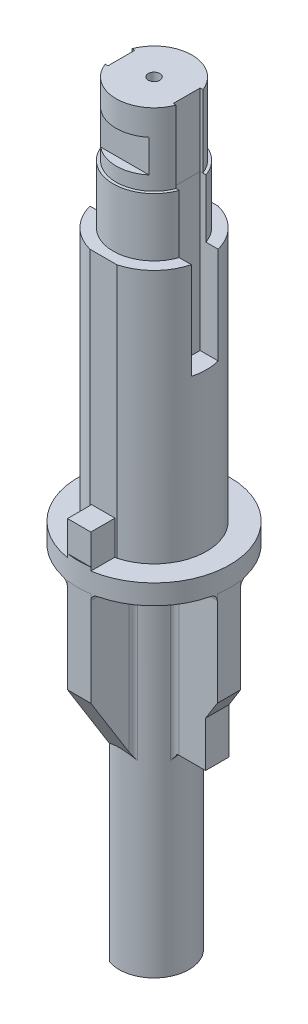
ISO-10303-21;
HEADER;
FILE_DESCRIPTION(('STEP AP214'),'2;1');
FILE_NAME('part.step','',(''),(''),'','','');
FILE_SCHEMA(('AUTOMOTIVE_DESIGN { 1 0 10303 214 1 1 1 1 }'));
ENDSEC;
DATA;
#1=APPLICATION_CONTEXT('core data for automotive mechanical design processes');
#2=APPLICATION_PROTOCOL_DEFINITION('international standard','automotive_design',2000,#1);
#3=PRODUCT_CONTEXT('',#1,'mechanical');
#4=PRODUCT('Part','Part','',(#3));
#5=PRODUCT_RELATED_PRODUCT_CATEGORY('part','',(#4));
#6=PRODUCT_DEFINITION_FORMATION('','',#4);
#7=PRODUCT_DEFINITION_CONTEXT('part definition',#1,'design');
#8=PRODUCT_DEFINITION('design','',#6,#7);
#9=PRODUCT_DEFINITION_SHAPE('','',#8);
#10=(LENGTH_UNIT() NAMED_UNIT(*) SI_UNIT(.MILLI.,.METRE.));
#11=(NAMED_UNIT(*) PLANE_ANGLE_UNIT() SI_UNIT($,.RADIAN.));
#12=(NAMED_UNIT(*) SI_UNIT($,.STERADIAN.) SOLID_ANGLE_UNIT());
#13=UNCERTAINTY_MEASURE_WITH_UNIT(LENGTH_MEASURE(1.E-05),#10,'distance_accuracy_value','');
#14=(GEOMETRIC_REPRESENTATION_CONTEXT(3) GLOBAL_UNCERTAINTY_ASSIGNED_CONTEXT((#13)) GLOBAL_UNIT_ASSIGNED_CONTEXT((#10,
#11,#12)) REPRESENTATION_CONTEXT('',''));
#15=CARTESIAN_POINT('',(0.,0.,0.));
#16=DIRECTION('',(0.,0.,1.));
#17=DIRECTION('',(1.,0.,0.));
#18=AXIS2_PLACEMENT_3D('',#15,#16,#17);
#19=CARTESIAN_POINT('',(0.,-42.82,1.));
#20=DIRECTION('',(0.,0.,-1.));
#21=DIRECTION('',(-1.,0.,0.));
#22=AXIS2_PLACEMENT_3D('',#19,#20,#21);
#23=PLANE('',#22);
#24=DIRECTION('',(0.,-1.,0.));
#25=VECTOR('',#24,1.);
#26=CARTESIAN_POINT('',(-3.16227766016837,-34.7,1.00000000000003));
#27=LINE('',#26,#25);
#28=CARTESIAN_POINT('',(-3.16227766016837,-48.32,1.00000000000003));
#29=VERTEX_POINT('',#28);
#30=CARTESIAN_POINT('',(-3.16227766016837,-35.2,1.00000000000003));
#31=VERTEX_POINT('',#30);
#32=EDGE_CURVE('E361',#29,#31,#27,.F.);
#33=ORIENTED_EDGE('',*,*,#32,.T.);
#34=DIRECTION('',(-1.,0.,0.));
#35=VECTOR('',#34,1.);
#36=CARTESIAN_POINT('',(0.,-35.2,1.));
#37=LINE('',#36,#35);
#38=CARTESIAN_POINT('',(-6.42261628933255,-35.1999967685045,1.00000000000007));
#39=VERTEX_POINT('',#38);
#40=EDGE_CURVE('E364',#31,#39,#37,.T.);
#41=ORIENTED_EDGE('',*,*,#40,.T.);
#42=DIRECTION('',(0.,1.,0.));
#43=VECTOR('',#42,1.);
#44=CARTESIAN_POINT('',(-6.42261628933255,-42.82,1.00000000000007));
#45=LINE('',#44,#43);
#46=CARTESIAN_POINT('',(-6.42261628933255,-42.82,1.00000000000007));
#47=VERTEX_POINT('',#46);
#48=EDGE_CURVE('E1455',#47,#39,#45,.T.);
#49=ORIENTED_EDGE('',*,*,#48,.F.);
#50=DIRECTION('',(-0.528345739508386,0.849029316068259,0.));
#51=VECTOR('',#50,1.);
#52=CARTESIAN_POINT('',(8.39997525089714,-66.6392793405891,1.00000000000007));
#53=LINE('',#52,#51);
#54=CARTESIAN_POINT('',(-5.42261628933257,-44.4269578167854,1.00000000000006));
#55=VERTEX_POINT('',#54);
#56=EDGE_CURVE('E1339',#55,#47,#53,.T.);
#57=ORIENTED_EDGE('',*,*,#56,.F.);
#58=DIRECTION('',(0.,1.,0.));
#59=VECTOR('',#58,1.);
#60=CARTESIAN_POINT('',(-5.42261628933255,0.,1.00000000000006));
#61=LINE('',#60,#59);
#62=CARTESIAN_POINT('',(-5.42261628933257,-48.32,1.00000000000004));
#63=VERTEX_POINT('',#62);
#64=EDGE_CURVE('E1250',#63,#55,#61,.T.);
#65=ORIENTED_EDGE('',*,*,#64,.F.);
#66=DIRECTION('',(1.,0.,0.));
#67=VECTOR('',#66,1.);
#68=CARTESIAN_POINT('',(2.28766587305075E-13,-48.32,1.));
#69=LINE('',#68,#67);
#70=EDGE_CURVE('E368',#63,#29,#69,.T.);
#71=ORIENTED_EDGE('',*,*,#70,.T.);
#72=EDGE_LOOP('',(#33,#41,#49,#57,#65,#71));
#73=FACE_BOUND('',#72,.T.);
#74=ADVANCED_FACE('F57',(#73),#23,.F.);
#75=CARTESIAN_POINT('',(-1.,-42.82,0.));
#76=DIRECTION('',(-1.,0.,0.));
#77=DIRECTION('',(0.,0.,1.));
#78=AXIS2_PLACEMENT_3D('',#75,#76,#77);
#79=PLANE('',#78);
#80=DIRECTION('',(0.,1.,0.));
#81=VECTOR('',#80,1.);
#82=CARTESIAN_POINT('',(-1.,-42.82,6.42261628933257));
#83=LINE('',#82,#81);
#84=CARTESIAN_POINT('',(-0.999999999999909,-42.82,6.42261628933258));
#85=VERTEX_POINT('',#84);
#86=CARTESIAN_POINT('',(-1.,-35.2,6.42261628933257));
#87=VERTEX_POINT('',#86);
#88=EDGE_CURVE('E1416',#85,#87,#83,.T.);
#89=ORIENTED_EDGE('',*,*,#88,.T.);
#90=DIRECTION('',(0.,0.,1.));
#91=VECTOR('',#90,1.);
#92=CARTESIAN_POINT('',(-1.,-35.2,2.82842712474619));
#93=LINE('',#92,#91);
#94=CARTESIAN_POINT('',(-1.,-35.2,3.16227766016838));
#95=VERTEX_POINT('',#94);
#96=EDGE_CURVE('E372',#87,#95,#93,.F.);
#97=ORIENTED_EDGE('',*,*,#96,.T.);
#98=DIRECTION('',(0.,1.,0.));
#99=VECTOR('',#98,1.);
#100=CARTESIAN_POINT('',(-1.,-42.82,3.16227766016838));
#101=LINE('',#100,#99);
#102=CARTESIAN_POINT('',(-0.999999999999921,-48.0592266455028,3.16227766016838));
#103=VERTEX_POINT('',#102);
#104=EDGE_CURVE('E1196',#95,#103,#101,.F.);
#105=ORIENTED_EDGE('',*,*,#104,.T.);
#106=DIRECTION('',(0.,0.849029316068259,0.528345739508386));
#107=VECTOR('',#106,1.);
#108=CARTESIAN_POINT('',(-0.999999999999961,-66.6392793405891,-8.39997525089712));
#109=LINE('',#108,#107);
#110=EDGE_CURVE('E1313',#103,#85,#109,.T.);
#111=ORIENTED_EDGE('',*,*,#110,.T.);
#112=EDGE_LOOP('',(#89,#97,#105,#111));
#113=FACE_BOUND('',#112,.T.);
#114=ADVANCED_FACE('F302',(#113),#79,.T.);
#115=CARTESIAN_POINT('',(8.39997525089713,-66.6392793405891,0.));
#116=DIRECTION('',(0.849029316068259,0.528345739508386,0.));
#117=DIRECTION('',(-0.528345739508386,0.849029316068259,0.));
#118=AXIS2_PLACEMENT_3D('',#115,#116,#117);
#119=PLANE('',#118);
#120=DIRECTION('',(0.,0.,-1.));
#121=VECTOR('',#120,1.);
#122=CARTESIAN_POINT('',(-5.42261628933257,-44.4269578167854,5.58528593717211));
#123=LINE('',#122,#121);
#124=CARTESIAN_POINT('',(-5.42261628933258,-44.4269578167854,-0.999999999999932));
#125=VERTEX_POINT('',#124);
#126=EDGE_CURVE('E1254',#55,#125,#123,.T.);
#127=ORIENTED_EDGE('',*,*,#126,.F.);
#128=ORIENTED_EDGE('',*,*,#56,.T.);
#129=DIRECTION('',(0.,0.,1.));
#130=VECTOR('',#129,1.);
#131=CARTESIAN_POINT('',(-6.42261628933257,-42.82,0.));
#132=LINE('',#131,#130);
#133=CARTESIAN_POINT('',(-6.42261628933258,-42.82,-0.999999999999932));
#134=VERTEX_POINT('',#133);
#135=EDGE_CURVE('E1403',#134,#47,#132,.T.);
#136=ORIENTED_EDGE('',*,*,#135,.F.);
#137=DIRECTION('',(-0.528345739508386,0.849029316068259,0.));
#138=VECTOR('',#137,1.);
#139=CARTESIAN_POINT('',(8.39997525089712,-66.6392793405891,-0.999999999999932));
#140=LINE('',#139,#138);
#141=EDGE_CURVE('E1324',#125,#134,#140,.T.);
#142=ORIENTED_EDGE('',*,*,#141,.F.);
#143=EDGE_LOOP('',(#127,#128,#136,#142));
#144=FACE_BOUND('',#143,.T.);
#145=ADVANCED_FACE('F356',(#144),#119,.F.);
#146=CARTESIAN_POINT('',(-2.82842712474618,-48.5957103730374,1.00000000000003));
#147=VERTEX_POINT('',#146);
#148=CARTESIAN_POINT('',(-3.,-48.32,1.00000000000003));
#149=VERTEX_POINT('',#148);
#150=EDGE_CURVE('E1336',#147,#149,#53,.T.);
#151=ORIENTED_EDGE('',*,*,#150,.T.);
#152=DIRECTION('',(0.,0.,-1.));
#153=VECTOR('',#152,1.);
#154=CARTESIAN_POINT('',(-3.,-48.32,5.58528593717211));
#155=LINE('',#154,#153);
#156=CARTESIAN_POINT('',(-3.,-48.32,0.));
#157=VERTEX_POINT('',#156);
#158=EDGE_CURVE('E1246',#149,#157,#155,.T.);
#159=ORIENTED_EDGE('',*,*,#158,.T.);
#160=CARTESIAN_POINT('',(0.,-53.1408734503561,0.));
#161=DIRECTION('',(0.849029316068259,0.528345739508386,0.));
#162=DIRECTION('',(-0.528345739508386,0.84902931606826,0.));
#163=AXIS2_PLACEMENT_3D('',#160,#161,#162);
#164=ELLIPSE('',#163,5.67810010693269,3.);
#165=EDGE_CURVE('E1331',#147,#157,#164,.F.);
#166=ORIENTED_EDGE('',*,*,#165,.F.);
#167=EDGE_LOOP('',(#151,#159,#166));
#168=FACE_BOUND('',#167,.T.);
#169=ADVANCED_FACE('F804',(#168),#119,.F.);
#170=CARTESIAN_POINT('',(0.,-42.82,0.));
#171=DIRECTION('',(0.,1.,0.));
#172=DIRECTION('',(0.,0.,1.));
#173=AXIS2_PLACEMENT_3D('',#170,#171,#172);
#174=CYLINDRICAL_SURFACE('',#173,3.);
#175=DIRECTION('',(0.,1.,0.));
#176=VECTOR('',#175,1.);
#177=CARTESIAN_POINT('',(0.99999999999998,-42.82,-2.8284271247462));
#178=LINE('',#177,#176);
#179=CARTESIAN_POINT('',(0.999999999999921,-48.5957103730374,-2.82842712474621));
#180=VERTEX_POINT('',#179);
#181=CARTESIAN_POINT('',(0.99999999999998,-35.2,-2.8284271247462));
#182=VERTEX_POINT('',#181);
#183=EDGE_CURVE('E1439',#180,#182,#178,.T.);
#184=ORIENTED_EDGE('',*,*,#183,.T.);
#185=CARTESIAN_POINT('',(0.,-35.2,0.));
#186=DIRECTION('',(0.,-1.,0.));
#187=DIRECTION('',(0.,0.,-1.));
#188=AXIS2_PLACEMENT_3D('',#185,#186,#187);
#189=CIRCLE('',#188,3.);
#190=CARTESIAN_POINT('',(2.82842712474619,-35.2,-1.00000000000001));
#191=VERTEX_POINT('',#190);
#192=EDGE_CURVE('E1167',#182,#191,#189,.T.);
#193=ORIENTED_EDGE('',*,*,#192,.T.);
#194=DIRECTION('',(0.,1.,0.));
#195=VECTOR('',#194,1.);
#196=CARTESIAN_POINT('',(2.82842712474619,-42.82,-1.00000000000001));
#197=LINE('',#196,#195);
#198=CARTESIAN_POINT('',(2.82842712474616,-48.5957103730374,-1.00000000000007));
#199=VERTEX_POINT('',#198);
#200=EDGE_CURVE('E1436',#199,#191,#197,.T.);
#201=ORIENTED_EDGE('',*,*,#200,.F.);
#202=CARTESIAN_POINT('',(0.,-53.1408734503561,0.));
#203=DIRECTION('',(-0.849029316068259,0.528345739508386,0.));
#204=DIRECTION('',(0.528345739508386,0.84902931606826,0.));
#205=AXIS2_PLACEMENT_3D('',#202,#203,#204);
#206=ELLIPSE('',#205,5.67810010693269,3.);
#207=CARTESIAN_POINT('',(3.,-48.32,0.));
#208=VERTEX_POINT('',#207);
#209=EDGE_CURVE('E1310',#199,#208,#206,.F.);
#210=ORIENTED_EDGE('',*,*,#209,.T.);
#211=CARTESIAN_POINT('',(2.71052370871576,-48.7851761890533,1.28571428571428));
#212=VERTEX_POINT('',#211);
#213=EDGE_CURVE('E1314',#208,#212,#206,.F.);
#214=ORIENTED_EDGE('',*,*,#213,.T.);
#215=DIRECTION('',(0.,1.,0.));
#216=VECTOR('',#215,1.);
#217=CARTESIAN_POINT('',(2.71052370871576,-42.82,1.28571428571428));
#218=LINE('',#217,#216);
#219=CARTESIAN_POINT('',(2.71052370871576,-35.2,1.28571428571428));
#220=VERTEX_POINT('',#219);
#221=EDGE_CURVE('E1164',#212,#220,#218,.T.);
#222=ORIENTED_EDGE('',*,*,#221,.T.);
#223=CARTESIAN_POINT('',(0.,-35.2,0.));
#224=DIRECTION('',(0.,-1.,0.));
#225=DIRECTION('',(0.,0.,-1.));
#226=AXIS2_PLACEMENT_3D('',#223,#224,#225);
#227=CIRCLE('',#226,3.);
#228=CARTESIAN_POINT('',(1.28571428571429,-35.2,2.71052370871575));
#229=VERTEX_POINT('',#228);
#230=EDGE_CURVE('E1161',#220,#229,#227,.T.);
#231=ORIENTED_EDGE('',*,*,#230,.T.);
#232=DIRECTION('',(0.,1.,0.));
#233=VECTOR('',#232,1.);
#234=CARTESIAN_POINT('',(1.28571428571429,-42.82,2.71052370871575));
#235=LINE('',#234,#233);
#236=CARTESIAN_POINT('',(1.28571428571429,-48.7851761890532,2.71052370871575));
#237=VERTEX_POINT('',#236);
#238=EDGE_CURVE('E1158',#229,#237,#235,.F.);
#239=ORIENTED_EDGE('',*,*,#238,.T.);
#240=CARTESIAN_POINT('',(0.,-53.1408734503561,0.));
#241=DIRECTION('',(0.,0.528345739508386,-0.849029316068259));
#242=DIRECTION('',(0.,0.84902931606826,0.528345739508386));
#243=AXIS2_PLACEMENT_3D('',#240,#241,#242);
#244=ELLIPSE('',#243,5.67810010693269,3.);
#245=CARTESIAN_POINT('',(-0.999999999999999,-48.5957103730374,2.82842712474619));
#246=VERTEX_POINT('',#245);
#247=EDGE_CURVE('E1321',#237,#246,#244,.F.);
#248=ORIENTED_EDGE('',*,*,#247,.T.);
#249=DIRECTION('',(0.,1.,0.));
#250=VECTOR('',#249,1.);
#251=CARTESIAN_POINT('',(-0.999999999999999,-42.82,2.82842712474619));
#252=LINE('',#251,#250);
#253=CARTESIAN_POINT('',(-0.999999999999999,-64.82,2.82842712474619));
#254=VERTEX_POINT('',#253);
#255=EDGE_CURVE('E1366',#254,#246,#252,.T.);
#256=ORIENTED_EDGE('',*,*,#255,.F.);
#257=CARTESIAN_POINT('',(0.,-64.82,0.));
#258=DIRECTION('',(0.,-1.,0.));
#259=DIRECTION('',(0.,0.,-1.));
#260=AXIS2_PLACEMENT_3D('',#257,#258,#259);
#261=CIRCLE('',#260,3.);
#262=CARTESIAN_POINT('',(-1.,-64.82,-2.82842712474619));
#263=VERTEX_POINT('',#262);
#264=EDGE_CURVE('E1266',#263,#254,#261,.T.);
#265=ORIENTED_EDGE('',*,*,#264,.F.);
#266=DIRECTION('',(0.,1.,0.));
#267=VECTOR('',#266,1.);
#268=CARTESIAN_POINT('',(-0.999999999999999,-42.82,-2.82842712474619));
#269=LINE('',#268,#267);
#270=CARTESIAN_POINT('',(-0.999999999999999,-48.5957103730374,-2.82842712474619));
#271=VERTEX_POINT('',#270);
#272=EDGE_CURVE('E1360',#271,#263,#269,.F.);
#273=ORIENTED_EDGE('',*,*,#272,.F.);
#274=CARTESIAN_POINT('',(0.,-53.1408734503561,0.));
#275=DIRECTION('',(0.,0.528345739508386,0.849029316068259));
#276=DIRECTION('',(0.,0.849029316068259,-0.528345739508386));
#277=AXIS2_PLACEMENT_3D('',#274,#275,#276);
#278=ELLIPSE('',#277,5.67810010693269,3.);
#279=EDGE_CURVE('E1301',#271,#180,#278,.F.);
#280=ORIENTED_EDGE('',*,*,#279,.T.);
#281=EDGE_LOOP('',(#184,#193,#201,#210,#214,#222,#231,#239,#248,#256,#265,#273,#280));
#282=FACE_BOUND('',#281,.T.);
#283=ADVANCED_FACE('F347',(#282),#174,.T.);
#284=CARTESIAN_POINT('',(0.,-64.82,0.));
#285=DIRECTION('',(0.,-1.,0.));
#286=DIRECTION('',(0.,0.,-1.));
#287=AXIS2_PLACEMENT_3D('',#284,#285,#286);
#288=CIRCLE('',#287,3.);
#289=CARTESIAN_POINT('',(-2.82842712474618,-64.82,1.00000000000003));
#290=VERTEX_POINT('',#289);
#291=CARTESIAN_POINT('',(-2.8284271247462,-64.82,-0.999999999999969));
#292=VERTEX_POINT('',#291);
#293=EDGE_CURVE('E1275',#290,#292,#288,.T.);
#294=ORIENTED_EDGE('',*,*,#293,.F.);
#295=DIRECTION('',(0.,1.,0.));
#296=VECTOR('',#295,1.);
#297=CARTESIAN_POINT('',(-2.82842712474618,-42.82,1.00000000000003));
#298=LINE('',#297,#296);
#299=EDGE_CURVE('E1363',#147,#290,#298,.F.);
#300=ORIENTED_EDGE('',*,*,#299,.F.);
#301=ORIENTED_EDGE('',*,*,#165,.T.);
#302=CARTESIAN_POINT('',(-2.8284271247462,-48.5957103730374,-0.999999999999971));
#303=VERTEX_POINT('',#302);
#304=EDGE_CURVE('E1335',#157,#303,#164,.F.);
#305=ORIENTED_EDGE('',*,*,#304,.T.);
#306=DIRECTION('',(0.,1.,0.));
#307=VECTOR('',#306,1.);
#308=CARTESIAN_POINT('',(-2.8284271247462,-42.82,-0.999999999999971));
#309=LINE('',#308,#307);
#310=EDGE_CURVE('E1350',#303,#292,#309,.F.);
#311=ORIENTED_EDGE('',*,*,#310,.T.);
#312=EDGE_LOOP('',(#294,#300,#301,#305,#311));
#313=FACE_BOUND('',#312,.T.);
#314=ADVANCED_FACE('F342',(#313),#174,.T.);
#315=DIRECTION('',(-1.,0.,0.));
#316=VECTOR('',#315,1.);
#317=CARTESIAN_POINT('',(0.,-48.32,1.));
#318=LINE('',#317,#316);
#319=CARTESIAN_POINT('',(-0.999999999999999,-48.32,1.00000000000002));
#320=VERTEX_POINT('',#319);
#321=EDGE_CURVE('E82',#320,#149,#318,.T.);
#322=ORIENTED_EDGE('',*,*,#321,.T.);
#323=ORIENTED_EDGE('',*,*,#150,.F.);
#324=ORIENTED_EDGE('',*,*,#299,.T.);
#325=DIRECTION('',(-1.,0.,0.));
#326=VECTOR('',#325,1.);
#327=CARTESIAN_POINT('',(-0.999999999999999,-64.82,1.00000000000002));
#328=LINE('',#327,#326);
#329=CARTESIAN_POINT('',(-0.999999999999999,-64.82,1.00000000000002));
#330=VERTEX_POINT('',#329);
#331=EDGE_CURVE('E1272',#330,#290,#328,.T.);
#332=ORIENTED_EDGE('',*,*,#331,.F.);
#333=DIRECTION('',(0.,-1.,0.));
#334=VECTOR('',#333,1.);
#335=CARTESIAN_POINT('',(-0.999999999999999,-48.32,1.00000000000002));
#336=LINE('',#335,#334);
#337=EDGE_CURVE('E1347',#320,#330,#336,.T.);
#338=ORIENTED_EDGE('',*,*,#337,.F.);
#339=EDGE_LOOP('',(#322,#323,#324,#332,#338));
#340=FACE_BOUND('',#339,.T.);
#341=ADVANCED_FACE('F336',(#340),#23,.F.);
#342=CARTESIAN_POINT('',(0.,-42.82,-1.));
#343=DIRECTION('',(0.,0.,-1.));
#344=DIRECTION('',(-1.,0.,0.));
#345=AXIS2_PLACEMENT_3D('',#342,#343,#344);
#346=PLANE('',#345);
#347=DIRECTION('',(0.,1.,0.));
#348=VECTOR('',#347,1.);
#349=CARTESIAN_POINT('',(-6.42261628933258,-42.82,-0.999999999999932));
#350=LINE('',#349,#348);
#351=CARTESIAN_POINT('',(-6.42261628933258,-35.2,-0.999999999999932));
#352=VERTEX_POINT('',#351);
#353=EDGE_CURVE('E1453',#134,#352,#350,.T.);
#354=ORIENTED_EDGE('',*,*,#353,.T.);
#355=DIRECTION('',(-1.,0.,0.));
#356=VECTOR('',#355,1.);
#357=CARTESIAN_POINT('',(-2.8284271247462,-35.2,-0.99999999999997));
#358=LINE('',#357,#356);
#359=CARTESIAN_POINT('',(-2.8284271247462,-35.2,-0.99999999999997));
#360=VERTEX_POINT('',#359);
#361=EDGE_CURVE('E1143',#352,#360,#358,.F.);
#362=ORIENTED_EDGE('',*,*,#361,.T.);
#363=DIRECTION('',(0.,1.,0.));
#364=VECTOR('',#363,1.);
#365=CARTESIAN_POINT('',(-2.8284271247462,-42.82,-0.99999999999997));
#366=LINE('',#365,#364);
#367=CARTESIAN_POINT('',(-2.8284271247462,-48.32,-0.999999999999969));
#368=VERTEX_POINT('',#367);
#369=EDGE_CURVE('E1450',#368,#360,#366,.T.);
#370=ORIENTED_EDGE('',*,*,#369,.F.);
#371=DIRECTION('',(-1.,0.,0.));
#372=VECTOR('',#371,1.);
#373=CARTESIAN_POINT('',(0.,-48.32,-1.));
#374=LINE('',#373,#372);
#375=CARTESIAN_POINT('',(-0.999999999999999,-48.32,-0.99999999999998));
#376=VERTEX_POINT('',#375);
#377=EDGE_CURVE('E1353',#376,#368,#374,.T.);
#378=ORIENTED_EDGE('',*,*,#377,.F.);
#379=DIRECTION('',(0.,-1.,0.));
#380=VECTOR('',#379,1.);
#381=CARTESIAN_POINT('',(-0.999999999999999,-48.32,-0.99999999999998));
#382=LINE('',#381,#380);
#383=CARTESIAN_POINT('',(-0.999999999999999,-64.82,-0.999999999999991));
#384=VERTEX_POINT('',#383);
#385=EDGE_CURVE('E1345',#376,#384,#382,.T.);
#386=ORIENTED_EDGE('',*,*,#385,.T.);
#387=DIRECTION('',(1.,0.,0.));
#388=VECTOR('',#387,1.);
#389=CARTESIAN_POINT('',(-2.8284271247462,-64.82,-0.999999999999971));
#390=LINE('',#389,#388);
#391=EDGE_CURVE('E1125',#292,#384,#390,.T.);
#392=ORIENTED_EDGE('',*,*,#391,.F.);
#393=ORIENTED_EDGE('',*,*,#310,.F.);
#394=CARTESIAN_POINT('',(-3.,-48.32,-0.999999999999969));
#395=VERTEX_POINT('',#394);
#396=EDGE_CURVE('E1340',#303,#395,#140,.T.);
#397=ORIENTED_EDGE('',*,*,#396,.T.);
#398=DIRECTION('',(-1.,0.,0.));
#399=VECTOR('',#398,1.);
#400=CARTESIAN_POINT('',(3.24828886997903E-13,-48.32,-1.));
#401=LINE('',#400,#399);
#402=CARTESIAN_POINT('',(-5.42261628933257,-48.32,-0.999999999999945));
#403=VERTEX_POINT('',#402);
#404=EDGE_CURVE('E1233',#395,#403,#401,.T.);
#405=ORIENTED_EDGE('',*,*,#404,.T.);
#406=DIRECTION('',(0.,-1.,0.));
#407=VECTOR('',#406,1.);
#408=CARTESIAN_POINT('',(-5.42261628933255,0.,-0.999999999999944));
#409=LINE('',#408,#407);
#410=EDGE_CURVE('E1239',#125,#403,#409,.T.);
#411=ORIENTED_EDGE('',*,*,#410,.F.);
#412=ORIENTED_EDGE('',*,*,#141,.T.);
#413=EDGE_LOOP('',(#354,#362,#370,#378,#386,#392,#393,#397,#405,#411,#412));
#414=FACE_BOUND('',#413,.T.);
#415=ADVANCED_FACE('F332',(#414),#346,.T.);
#416=CARTESIAN_POINT('',(-1.,-42.82,0.));
#417=DIRECTION('',(1.,0.,0.));
#418=DIRECTION('',(0.,0.,-1.));
#419=AXIS2_PLACEMENT_3D('',#416,#417,#418);
#420=PLANE('',#419);
#421=CARTESIAN_POINT('',(-1.00000000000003,-40.7,-4.92261628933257));
#422=DIRECTION('',(1.,0.,0.));
#423=DIRECTION('',(0.,0.,-1.));
#424=AXIS2_PLACEMENT_3D('',#421,#422,#423);
#425=CIRCLE('',#424,0.75);
#426=CARTESIAN_POINT('',(-1.00000000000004,-40.7,-5.67261628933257));
#427=VERTEX_POINT('',#426);
#428=EDGE_CURVE('E1372',#427,#427,#425,.F.);
#429=ORIENTED_EDGE('',*,*,#428,.F.);
#430=EDGE_LOOP('',(#429));
#431=FACE_BOUND('',#430,.T.);
#432=DIRECTION('',(0.,1.,0.));
#433=VECTOR('',#432,1.);
#434=CARTESIAN_POINT('',(-1.00000000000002,-42.82,-2.82842712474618));
#435=LINE('',#434,#433);
#436=CARTESIAN_POINT('',(-1.00000000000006,-48.32,-2.82842712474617));
#437=VERTEX_POINT('',#436);
#438=CARTESIAN_POINT('',(-1.00000000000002,-35.2,-2.82842712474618));
#439=VERTEX_POINT('',#438);
#440=EDGE_CURVE('E1447',#437,#439,#435,.T.);
#441=ORIENTED_EDGE('',*,*,#440,.T.);
#442=DIRECTION('',(0.,0.,-1.));
#443=VECTOR('',#442,1.);
#444=CARTESIAN_POINT('',(-1.,-35.2,0.));
#445=LINE('',#444,#443);
#446=CARTESIAN_POINT('',(-1.00000000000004,-35.1999967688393,-6.42261628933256));
#447=VERTEX_POINT('',#446);
#448=EDGE_CURVE('E1128',#439,#447,#445,.T.);
#449=ORIENTED_EDGE('',*,*,#448,.T.);
#450=DIRECTION('',(0.,1.,0.));
#451=VECTOR('',#450,1.);
#452=CARTESIAN_POINT('',(-1.00000000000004,-42.82,-6.42261628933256));
#453=LINE('',#452,#451);
#454=CARTESIAN_POINT('',(-1.00000000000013,-42.82,-6.42261628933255));
#455=VERTEX_POINT('',#454);
#456=EDGE_CURVE('E1444',#455,#447,#453,.T.);
#457=ORIENTED_EDGE('',*,*,#456,.F.);
#458=DIRECTION('',(0.,0.849029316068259,-0.528345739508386));
#459=VECTOR('',#458,1.);
#460=CARTESIAN_POINT('',(-0.999999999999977,-66.6392793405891,8.39997525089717));
#461=LINE('',#460,#459);
#462=EDGE_CURVE('E1305',#271,#455,#461,.T.);
#463=ORIENTED_EDGE('',*,*,#462,.F.);
#464=ORIENTED_EDGE('',*,*,#272,.T.);
#465=DIRECTION('',(0.,0.,-1.));
#466=VECTOR('',#465,1.);
#467=CARTESIAN_POINT('',(-0.999999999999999,-64.82,-0.999999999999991));
#468=LINE('',#467,#466);
#469=EDGE_CURVE('E1263',#384,#263,#468,.T.);
#470=ORIENTED_EDGE('',*,*,#469,.F.);
#471=ORIENTED_EDGE('',*,*,#385,.F.);
#472=DIRECTION('',(0.,0.,-1.));
#473=VECTOR('',#472,1.);
#474=CARTESIAN_POINT('',(-0.999999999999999,-48.32,0.));
#475=LINE('',#474,#473);
#476=EDGE_CURVE('E1334',#376,#437,#475,.T.);
#477=ORIENTED_EDGE('',*,*,#476,.T.);
#478=EDGE_LOOP('',(#441,#449,#457,#463,#464,#470,#471,#477));
#479=FACE_BOUND('',#478,.T.);
#480=ADVANCED_FACE('F300',(#431,#479),#420,.F.);
#481=CARTESIAN_POINT('',(-0.99999999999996,-48.32,3.00000000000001));
#482=VERTEX_POINT('',#481);
#483=EDGE_CURVE('E1328',#246,#482,#109,.T.);
#484=ORIENTED_EDGE('',*,*,#483,.T.);
#485=DIRECTION('',(0.,0.,-1.));
#486=VECTOR('',#485,1.);
#487=CARTESIAN_POINT('',(-0.999999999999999,-48.32,0.));
#488=LINE('',#487,#486);
#489=EDGE_CURVE('E1342',#482,#320,#488,.T.);
#490=ORIENTED_EDGE('',*,*,#489,.T.);
#491=ORIENTED_EDGE('',*,*,#337,.T.);
#492=DIRECTION('',(0.,0.,-1.));
#493=VECTOR('',#492,1.);
#494=CARTESIAN_POINT('',(-0.999999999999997,-64.82,2.82842712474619));
#495=LINE('',#494,#493);
#496=EDGE_CURVE('E1269',#254,#330,#495,.T.);
#497=ORIENTED_EDGE('',*,*,#496,.F.);
#498=ORIENTED_EDGE('',*,*,#255,.T.);
#499=EDGE_LOOP('',(#484,#490,#491,#497,#498));
#500=FACE_BOUND('',#499,.T.);
#501=ADVANCED_FACE('F295',(#500),#79,.T.);
#502=CARTESIAN_POINT('',(0.,-67.82,0.));
#503=DIRECTION('',(0.,1.,0.));
#504=DIRECTION('',(0.,0.,1.));
#505=AXIS2_PLACEMENT_3D('',#502,#503,#504);
#506=CYLINDRICAL_SURFACE('',#505,0.5);
#507=CARTESIAN_POINT('',(0.,-6.2,0.));
#508=DIRECTION('',(0.,-1.,0.));
#509=DIRECTION('',(0.,0.,-1.));
#510=AXIS2_PLACEMENT_3D('',#507,#508,#509);
#511=CIRCLE('',#510,0.5);
#512=CARTESIAN_POINT('',(0.,-6.2,-0.5));
#513=VERTEX_POINT('',#512);
#514=EDGE_CURVE('E1118',#513,#513,#511,.T.);
#515=ORIENTED_EDGE('',*,*,#514,.F.);
#516=EDGE_LOOP('',(#515));
#517=FACE_BOUND('',#516,.T.);
#518=CARTESIAN_POINT('',(0.,-64.82,0.));
#519=DIRECTION('',(0.,-1.,0.));
#520=DIRECTION('',(0.,0.,-1.));
#521=AXIS2_PLACEMENT_3D('',#518,#519,#520);
#522=CIRCLE('',#521,0.5);
#523=CARTESIAN_POINT('',(0.,-64.82,-0.5));
#524=VERTEX_POINT('',#523);
#525=EDGE_CURVE('E1122',#524,#524,#522,.F.);
#526=ORIENTED_EDGE('',*,*,#525,.F.);
#527=EDGE_LOOP('',(#526));
#528=FACE_BOUND('',#527,.T.);
#529=ADVANCED_FACE('F299',(#517,#528),#506,.F.);
#530=CARTESIAN_POINT('',(-8.39997525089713,-66.6392793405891,0.));
#531=DIRECTION('',(-0.849029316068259,0.528345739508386,0.));
#532=DIRECTION('',(-0.528345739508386,-0.849029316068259,0.));
#533=AXIS2_PLACEMENT_3D('',#530,#531,#532);
#534=PLANE('',#533);
#535=DIRECTION('',(0.,0.,1.));
#536=VECTOR('',#535,1.);
#537=CARTESIAN_POINT('',(5.42261628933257,-44.4269578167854,-5.58528593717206));
#538=LINE('',#537,#536);
#539=CARTESIAN_POINT('',(5.42261628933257,-44.4269578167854,-1.00000000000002));
#540=VERTEX_POINT('',#539);
#541=CARTESIAN_POINT('',(5.42261628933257,-44.4269578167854,0.999999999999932));
#542=VERTEX_POINT('',#541);
#543=EDGE_CURVE('E1284',#540,#542,#538,.T.);
#544=ORIENTED_EDGE('',*,*,#543,.F.);
#545=DIRECTION('',(0.528345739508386,0.849029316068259,0.));
#546=VECTOR('',#545,1.);
#547=CARTESIAN_POINT('',(-8.39997525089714,-66.6392793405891,-1.00000000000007));
#548=LINE('',#547,#546);
#549=CARTESIAN_POINT('',(6.42261628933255,-42.82,-1.00000000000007));
#550=VERTEX_POINT('',#549);
#551=EDGE_CURVE('E1317',#540,#550,#548,.T.);
#552=ORIENTED_EDGE('',*,*,#551,.T.);
#553=DIRECTION('',(0.,0.,-1.));
#554=VECTOR('',#553,1.);
#555=CARTESIAN_POINT('',(6.42261628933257,-42.82,0.));
#556=LINE('',#555,#554);
#557=CARTESIAN_POINT('',(6.42261628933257,-42.82,0.999999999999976));
#558=VERTEX_POINT('',#557);
#559=EDGE_CURVE('E1410',#558,#550,#556,.T.);
#560=ORIENTED_EDGE('',*,*,#559,.F.);
#561=DIRECTION('',(0.528345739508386,0.849029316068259,0.));
#562=VECTOR('',#561,1.);
#563=CARTESIAN_POINT('',(-8.39997525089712,-66.6392793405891,0.999999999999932));
#564=LINE('',#563,#562);
#565=EDGE_CURVE('E1304',#542,#558,#564,.T.);
#566=ORIENTED_EDGE('',*,*,#565,.F.);
#567=EDGE_LOOP('',(#544,#552,#560,#566));
#568=FACE_BOUND('',#567,.T.);
#569=ADVANCED_FACE('F663',(#568),#534,.F.);
#570=CARTESIAN_POINT('',(2.99999999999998,-48.32,-1.00000000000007));
#571=VERTEX_POINT('',#570);
#572=EDGE_CURVE('E1318',#199,#571,#548,.T.);
#573=ORIENTED_EDGE('',*,*,#572,.T.);
#574=DIRECTION('',(0.,0.,1.));
#575=VECTOR('',#574,1.);
#576=CARTESIAN_POINT('',(3.00000000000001,-48.32,-5.58528593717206));
#577=LINE('',#576,#575);
#578=EDGE_CURVE('E1290',#571,#208,#577,.T.);
#579=ORIENTED_EDGE('',*,*,#578,.T.);
#580=ORIENTED_EDGE('',*,*,#209,.F.);
#581=EDGE_LOOP('',(#573,#579,#580));
#582=FACE_BOUND('',#581,.T.);
#583=ADVANCED_FACE('F664',(#582),#534,.F.);
#584=ORIENTED_EDGE('',*,*,#369,.T.);
#585=CARTESIAN_POINT('',(0.,-35.2,0.));
#586=DIRECTION('',(0.,-1.,0.));
#587=DIRECTION('',(0.,0.,-1.));
#588=AXIS2_PLACEMENT_3D('',#585,#586,#587);
#589=CIRCLE('',#588,3.);
#590=EDGE_CURVE('E1140',#360,#439,#589,.T.);
#591=ORIENTED_EDGE('',*,*,#590,.T.);
#592=ORIENTED_EDGE('',*,*,#440,.F.);
#593=CARTESIAN_POINT('',(0.,-48.32,0.));
#594=DIRECTION('',(0.,-1.,0.));
#595=DIRECTION('',(0.,0.,-1.));
#596=AXIS2_PLACEMENT_3D('',#593,#594,#595);
#597=CIRCLE('',#596,3.);
#598=EDGE_CURVE('E1110',#368,#437,#597,.T.);
#599=ORIENTED_EDGE('',*,*,#598,.F.);
#600=EDGE_LOOP('',(#584,#591,#592,#599));
#601=FACE_BOUND('',#600,.T.);
#602=ADVANCED_FACE('F349',(#601),#174,.T.);
#603=CARTESIAN_POINT('',(0.,-48.32,0.));
#604=DIRECTION('',(0.,-1.,0.));
#605=DIRECTION('',(0.,0.,-1.));
#606=AXIS2_PLACEMENT_3D('',#603,#604,#605);
#607=CIRCLE('',#606,3.);
#608=CARTESIAN_POINT('',(-1.26689427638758,-48.32,2.71937104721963));
#609=VERTEX_POINT('',#608);
#610=CARTESIAN_POINT('',(-2.71052370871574,-48.32,1.28571428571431));
#611=VERTEX_POINT('',#610);
#612=EDGE_CURVE('E185',#609,#611,#607,.T.);
#613=ORIENTED_EDGE('',*,*,#612,.F.);
#614=CARTESIAN_POINT('',(-1.1754564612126,-48.5998964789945,2.76012719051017));
#615=CARTESIAN_POINT('',(-1.05865573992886,-48.5023874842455,2.80986916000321));
#616=CARTESIAN_POINT('',(-1.,-48.4230092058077,2.93589800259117));
#617=CARTESIAN_POINT('',(-1.18992106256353,-48.5758855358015,2.75395430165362));
#618=CARTESIAN_POINT('',(-1.06256844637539,-48.4830268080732,2.80892689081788));
#619=CARTESIAN_POINT('',(-1.,-48.4089314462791,2.94465850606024));
#620=CARTESIAN_POINT('',(-1.20240047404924,-48.5502718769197,2.74851901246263));
#621=CARTESIAN_POINT('',(-1.0649751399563,-48.4621819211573,2.80859774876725));
#622=CARTESIAN_POINT('',(-1.,-48.3933123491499,2.954378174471));
#623=CARTESIAN_POINT('',(-1.22391623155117,-48.4972369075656,2.73901110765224));
#624=CARTESIAN_POINT('',(-1.06724626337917,-48.4187747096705,2.8089734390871));
#625=CARTESIAN_POINT('',(-1.,-48.3600579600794,2.97507217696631));
#626=CARTESIAN_POINT('',(-1.23299711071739,-48.4698449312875,2.73492095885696));
#627=CARTESIAN_POINT('',(-1.06712341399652,-48.3961823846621,2.80967421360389));
#628=CARTESIAN_POINT('',(-1.,-48.3424529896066,2.98602764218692));
#629=CARTESIAN_POINT('',(-1.25468850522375,-48.3921259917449,2.7250665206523));
#630=CARTESIAN_POINT('',(-1.06388928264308,-48.3317439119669,2.81282523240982));
#631=CARTESIAN_POINT('',(-1.,-48.2915864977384,3.017681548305));
#632=CARTESIAN_POINT('',(-1.26452224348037,-48.3405844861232,2.72048709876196));
#633=CARTESIAN_POINT('',(-1.05843371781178,-48.2889429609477,2.81623971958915));
#634=CARTESIAN_POINT('',(-1.,-48.2568293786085,3.0393106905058));
#635=CARTESIAN_POINT('',(-1.27856089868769,-48.2355471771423,2.71391515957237));
#636=CARTESIAN_POINT('',(-1.04228975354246,-48.2022374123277,2.82518597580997));
#637=CARTESIAN_POINT('',(-1.,-48.1845525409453,3.08428812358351));
#638=CARTESIAN_POINT('',(-1.2826717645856,-48.1820332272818,2.71196588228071));
#639=CARTESIAN_POINT('',(-1.03136347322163,-48.1581871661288,2.83081676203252));
#640=CARTESIAN_POINT('',(-1.,-48.1469971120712,3.10765863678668));
#641=CARTESIAN_POINT('',(-1.28631446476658,-48.0770502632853,2.71023937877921));
#642=CARTESIAN_POINT('',(-1.00551057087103,-48.0728572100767,2.84350399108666));
#643=CARTESIAN_POINT('',(-1.,-48.0722236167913,3.15418972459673));
#644=CARTESIAN_POINT('',(-1.28603250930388,-48.0255904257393,2.71037382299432));
#645=CARTESIAN_POINT('',(-0.990599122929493,-48.0313873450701,2.85056107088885));
#646=CARTESIAN_POINT('',(-1.,-48.0350583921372,3.17731741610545));
#647=CARTESIAN_POINT('',(-1.28205115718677,-47.9228439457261,2.71225895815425));
#648=CARTESIAN_POINT('',(-0.956760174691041,-47.9500859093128,2.86602936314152));
#649=CARTESIAN_POINT('',(-1.,-47.9600069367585,3.22402147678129));
#650=CARTESIAN_POINT('',(-1.27834724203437,-47.8715576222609,2.71401178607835));
#651=CARTESIAN_POINT('',(-0.937645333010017,-47.9101884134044,2.87450981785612));
#652=CARTESIAN_POINT('',(-1.,-47.9221198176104,3.24759839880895));
#653=CARTESIAN_POINT('',(-1.26815908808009,-47.7717704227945,2.71878725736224));
#654=CARTESIAN_POINT('',(-0.896309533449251,-47.8347887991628,2.89225319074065));
#655=CARTESIAN_POINT('',(-1.,-47.8476889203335,3.2939162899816));
#656=CARTESIAN_POINT('',(-1.26180564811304,-47.7232470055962,2.72175004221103));
#657=CARTESIAN_POINT('',(-0.874030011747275,-47.799082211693,2.90154659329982));
#658=CARTESIAN_POINT('',(-1.,-47.8111602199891,3.31664787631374));
#659=CARTESIAN_POINT('',(-1.24649844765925,-47.6270202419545,2.72879218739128));
#660=CARTESIAN_POINT('',(-0.825553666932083,-47.7312694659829,2.92110835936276));
#661=CARTESIAN_POINT('',(-1.,-47.7381096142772,3.36210682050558));
#662=CARTESIAN_POINT('',(-1.2375523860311,-47.579314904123,2.73286823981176));
#663=CARTESIAN_POINT('',(-0.799110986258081,-47.6991706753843,2.93145249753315));
#664=CARTESIAN_POINT('',(-1.,-47.7015880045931,3.38483399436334));
#665=CARTESIAN_POINT('',(-1.22736567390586,-47.5320481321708,2.73743922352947));
#666=CARTESIAN_POINT('',(-0.771093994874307,-47.6702135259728,2.94201443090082));
#667=CARTESIAN_POINT('',(-1.,-47.6651235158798,3.40752562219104));
#668=(BOUNDED_SURFACE() B_SPLINE_SURFACE(3,2,((#614,#615,#616),(#617,#618,#619),(#620,#621,
#622),(#623,#624,#625),(#626,#627,#628),(#629,#630,#631),(#632,#633,#634),(#635,#636,#637),
(#638,#639,#640),(#641,#642,#643),(#644,#645,#646),(#647,#648,#649),(#650,#651,#652),(#653,#654,
#655),(#656,#657,#658),(#659,#660,#661),(#662,#663,#664),(#665,#666,#667)),.UNSPECIFIED.,.F.,
.F.,.F.) B_SPLINE_SURFACE_WITH_KNOTS((4,2,2,2,2,2,2,2,4),(3,3),(0.,0.0901856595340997,
0.179144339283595,0.337533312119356,0.498495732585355,0.652654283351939,0.807016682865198,
0.954522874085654,1.10159545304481),(0.,1.),
.UNSPECIFIED.) GEOMETRIC_REPRESENTATION_ITEM() RATIONAL_B_SPLINE_SURFACE(((1.,0.952381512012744,
1.),(1.,0.94878959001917,1.),(1.,0.944712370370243,1.),(1.,0.935830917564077,1.),(1.,
0.931037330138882,1.),(1.,0.916887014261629,1.),(1.,0.906888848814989,1.),(1.,0.885291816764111,
1.),(1.,0.873669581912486,1.),(1.,0.849602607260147,1.),(1.,0.837213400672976,1.),(1.,
0.811192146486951,1.),(1.,0.79755847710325,1.),(1.,0.769631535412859,1.),(1.,0.755394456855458,
1.),(1.,0.725658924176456,1.),(1.,0.71016430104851,1.),(1.,0.693959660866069,1.))) REPRESENTATION_ITEM('') SURFACE());
#669=CARTESIAN_POINT('',(-1.1754564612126,-48.5998964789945,2.76012719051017));
#670=CARTESIAN_POINT('',(-1.18992106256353,-48.5758855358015,2.75395430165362));
#671=CARTESIAN_POINT('',(-1.20240047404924,-48.5502718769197,2.74851901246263));
#672=CARTESIAN_POINT('',(-1.22391623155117,-48.4972369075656,2.73901110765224));
#673=CARTESIAN_POINT('',(-1.23299711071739,-48.4698449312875,2.73492095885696));
#674=CARTESIAN_POINT('',(-1.25468850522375,-48.3921259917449,2.7250665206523));
#675=CARTESIAN_POINT('',(-1.26452224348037,-48.3405844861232,2.72048709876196));
#676=CARTESIAN_POINT('',(-1.27856089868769,-48.2355471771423,2.71391515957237));
#677=CARTESIAN_POINT('',(-1.2826717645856,-48.1820332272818,2.71196588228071));
#678=CARTESIAN_POINT('',(-1.28631446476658,-48.0770502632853,2.71023937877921));
#679=CARTESIAN_POINT('',(-1.28603250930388,-48.0255904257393,2.71037382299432));
#680=CARTESIAN_POINT('',(-1.28205115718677,-47.9228439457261,2.71225895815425));
#681=CARTESIAN_POINT('',(-1.27834724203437,-47.8715576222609,2.71401178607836));
#682=CARTESIAN_POINT('',(-1.26815908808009,-47.7717704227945,2.71878725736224));
#683=CARTESIAN_POINT('',(-1.26180564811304,-47.7232470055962,2.72175004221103));
#684=CARTESIAN_POINT('',(-1.24649844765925,-47.6270202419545,2.72879218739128));
#685=CARTESIAN_POINT('',(-1.2375523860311,-47.579314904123,2.73286823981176));
#686=CARTESIAN_POINT('',(-1.22736567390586,-47.5320481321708,2.73743922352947));
#687=B_SPLINE_CURVE_WITH_KNOTS('',3,(#669,#670,#671,#672,#673,#674,#675,#676,#677,#678,#679,
#680,#681,#682,#683,#684,#685,#686),.UNSPECIFIED.,.F.,.F.,(4,2,2,2,2,2,2,2,4),(0.,
0.0901856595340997,0.179144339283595,0.337533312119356,0.498495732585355,0.652654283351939,
0.807016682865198,0.954522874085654,1.10159545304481),.UNSPECIFIED.);
#688=CARTESIAN_POINT('',(-1.28571428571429,-48.0592266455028,2.71052370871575));
#689=VERTEX_POINT('',#688);
#690=EDGE_CURVE('E178',#609,#689,#687,.T.);
#691=ORIENTED_EDGE('',*,*,#690,.T.);
#692=DIRECTION('',(0.,1.,0.));
#693=VECTOR('',#692,1.);
#694=CARTESIAN_POINT('',(-1.28571428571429,-42.82,2.71052370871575));
#695=LINE('',#694,#693);
#696=CARTESIAN_POINT('',(-1.28571428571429,-35.2,2.71052370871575));
#697=VERTEX_POINT('',#696);
#698=EDGE_CURVE('E182',#689,#697,#695,.T.);
#699=ORIENTED_EDGE('',*,*,#698,.T.);
#700=CARTESIAN_POINT('',(0.,-35.2,0.));
#701=DIRECTION('',(0.,-1.,0.));
#702=DIRECTION('',(0.,0.,-1.));
#703=AXIS2_PLACEMENT_3D('',#700,#701,#702);
#704=CIRCLE('',#703,3.);
#705=CARTESIAN_POINT('',(-2.71052370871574,-35.2,1.28571428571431));
#706=VERTEX_POINT('',#705);
#707=EDGE_CURVE('E206',#697,#706,#704,.T.);
#708=ORIENTED_EDGE('',*,*,#707,.T.);
#709=DIRECTION('',(0.,1.,0.));
#710=VECTOR('',#709,1.);
#711=CARTESIAN_POINT('',(-2.71052370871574,-42.82,1.28571428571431));
#712=LINE('',#711,#710);
#713=EDGE_CURVE('E208',#706,#611,#712,.F.);
#714=ORIENTED_EDGE('',*,*,#713,.T.);
#715=EDGE_LOOP('',(#613,#691,#699,#708,#714));
#716=FACE_BOUND('',#715,.T.);
#717=ADVANCED_FACE('F180',(#716),#174,.T.);
#718=CARTESIAN_POINT('',(0.,-32.7,0.));
#719=DIRECTION('',(0.,-1.,0.));
#720=DIRECTION('',(0.,0.,-1.));
#721=AXIS2_PLACEMENT_3D('',#718,#719,#720);
#722=PLANE('',#721);
#723=DIRECTION('',(1.,0.,0.));
#724=VECTOR('',#723,1.);
#725=CARTESIAN_POINT('',(0.,-32.7,6.42261628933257));
#726=LINE('',#725,#724);
#727=CARTESIAN_POINT('',(-0.999999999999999,-32.7,6.42261628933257));
#728=VERTEX_POINT('',#727);
#729=CARTESIAN_POINT('',(1.,-32.7,6.42261628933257));
#730=VERTEX_POINT('',#729);
#731=EDGE_CURVE('E1375',#728,#730,#726,.T.);
#732=ORIENTED_EDGE('',*,*,#731,.F.);
#733=CARTESIAN_POINT('',(0.,-32.7,0.));
#734=DIRECTION('',(0.,-1.,0.));
#735=DIRECTION('',(0.,0.,-1.));
#736=AXIS2_PLACEMENT_3D('',#733,#734,#735);
#737=CIRCLE('',#736,6.5);
#738=EDGE_CURVE('E1518',#730,#728,#737,.T.);
#739=ORIENTED_EDGE('',*,*,#738,.F.);
#740=EDGE_LOOP('',(#732,#739));
#741=FACE_BOUND('',#740,.T.);
#742=ADVANCED_FACE('F477',(#741),#722,.F.);
#743=CARTESIAN_POINT('',(0.,-35.0092206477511,4.35));
#744=DIRECTION('',(0.,0.,1.));
#745=DIRECTION('',(1.,0.,0.));
#746=AXIS2_PLACEMENT_3D('',#743,#744,#745);
#747=PLANE('',#746);
#748=DIRECTION('',(0.,1.,0.));
#749=VECTOR('',#748,1.);
#750=CARTESIAN_POINT('',(-1.15217186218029,-35.0092206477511,4.35));
#751=LINE('',#750,#749);
#752=CARTESIAN_POINT('',(-1.15217186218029,-33.,4.35));
#753=VERTEX_POINT('',#752);
#754=CARTESIAN_POINT('',(-1.15217186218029,-11.2,4.35));
#755=VERTEX_POINT('',#754);
#756=EDGE_CURVE('E1462',#753,#755,#751,.T.);
#757=ORIENTED_EDGE('',*,*,#756,.F.);
#758=DIRECTION('',(-1.,0.,0.));
#759=VECTOR('',#758,1.);
#760=CARTESIAN_POINT('',(-1.,-33.,4.35));
#761=LINE('',#760,#759);
#762=CARTESIAN_POINT('',(-1.,-33.,4.35));
#763=VERTEX_POINT('',#762);
#764=EDGE_CURVE('E1870',#763,#753,#761,.T.);
#765=ORIENTED_EDGE('',*,*,#764,.F.);
#766=DIRECTION('',(0.,-1.,0.));
#767=VECTOR('',#766,1.);
#768=CARTESIAN_POINT('',(-1.,-30.1,4.35));
#769=LINE('',#768,#767);
#770=CARTESIAN_POINT('',(-1.,-30.1,4.35));
#771=VERTEX_POINT('',#770);
#772=EDGE_CURVE('E1399',#771,#763,#769,.T.);
#773=ORIENTED_EDGE('',*,*,#772,.F.);
#774=DIRECTION('',(-1.,0.,0.));
#775=VECTOR('',#774,1.);
#776=CARTESIAN_POINT('',(0.,-30.1,4.35));
#777=LINE('',#776,#775);
#778=CARTESIAN_POINT('',(1.,-30.1,4.35));
#779=VERTEX_POINT('',#778);
#780=EDGE_CURVE('E1376',#779,#771,#777,.T.);
#781=ORIENTED_EDGE('',*,*,#780,.F.);
#782=DIRECTION('',(0.,-1.,0.));
#783=VECTOR('',#782,1.);
#784=CARTESIAN_POINT('',(1.,-30.1,4.35));
#785=LINE('',#784,#783);
#786=CARTESIAN_POINT('',(1.,-33.,4.35));
#787=VERTEX_POINT('',#786);
#788=EDGE_CURVE('E1388',#779,#787,#785,.T.);
#789=ORIENTED_EDGE('',*,*,#788,.T.);
#790=DIRECTION('',(-1.,0.,0.));
#791=VECTOR('',#790,1.);
#792=CARTESIAN_POINT('',(1.15217186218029,-33.,4.35));
#793=LINE('',#792,#791);
#794=CARTESIAN_POINT('',(1.15217186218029,-33.,4.35));
#795=VERTEX_POINT('',#794);
#796=EDGE_CURVE('E1880',#795,#787,#793,.T.);
#797=ORIENTED_EDGE('',*,*,#796,.F.);
#798=DIRECTION('',(0.,1.,0.));
#799=VECTOR('',#798,1.);
#800=CARTESIAN_POINT('',(1.15217186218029,-35.0092206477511,4.35));
#801=LINE('',#800,#799);
#802=CARTESIAN_POINT('',(1.15217186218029,-11.2,4.35));
#803=VERTEX_POINT('',#802);
#804=EDGE_CURVE('E1456',#795,#803,#801,.T.);
#805=ORIENTED_EDGE('',*,*,#804,.T.);
#806=DIRECTION('',(1.,0.,0.));
#807=VECTOR('',#806,1.);
#808=CARTESIAN_POINT('',(0.,-11.2,4.35));
#809=LINE('',#808,#807);
#810=EDGE_CURVE('E1060',#755,#803,#809,.T.);
#811=ORIENTED_EDGE('',*,*,#810,.F.);
#812=EDGE_LOOP('',(#757,#765,#773,#781,#789,#797,#805,#811));
#813=FACE_BOUND('',#812,.T.);
#814=ADVANCED_FACE('F904',(#813),#747,.T.);
#815=CARTESIAN_POINT('',(0.,-34.7,0.));
#816=DIRECTION('',(0.,-1.,0.));
#817=DIRECTION('',(0.,0.,-1.));
#818=AXIS2_PLACEMENT_3D('',#815,#816,#817);
#819=PLANE('',#818);
#820=CARTESIAN_POINT('',(0.,-34.7,0.));
#821=DIRECTION('',(0.,-1.,0.));
#822=DIRECTION('',(0.,0.,-1.));
#823=AXIS2_PLACEMENT_3D('',#820,#821,#822);
#824=CIRCLE('',#823,6.5);
#825=CARTESIAN_POINT('',(1.,-34.7,6.42261628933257));
#826=VERTEX_POINT('',#825);
#827=CARTESIAN_POINT('',(-0.999999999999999,-34.7,6.42261628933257));
#828=VERTEX_POINT('',#827);
#829=EDGE_CURVE('E1536',#826,#828,#824,.T.);
#830=ORIENTED_EDGE('',*,*,#829,.T.);
#831=DIRECTION('',(1.,0.,0.));
#832=VECTOR('',#831,1.);
#833=CARTESIAN_POINT('',(0.,-34.7,6.42261628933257));
#834=LINE('',#833,#832);
#835=EDGE_CURVE('E1407',#828,#826,#834,.T.);
#836=ORIENTED_EDGE('',*,*,#835,.T.);
#837=EDGE_LOOP('',(#830,#836));
#838=FACE_BOUND('',#837,.T.);
#839=ADVANCED_FACE('F727',(#838),#819,.T.);
#840=CARTESIAN_POINT('',(0.,-34.7,0.));
#841=DIRECTION('',(0.,-1.,0.));
#842=DIRECTION('',(0.,0.,-1.));
#843=AXIS2_PLACEMENT_3D('',#840,#841,#842);
#844=CIRCLE('',#843,3.5);
#845=CARTESIAN_POINT('',(-3.16227766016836,-34.7,1.50000000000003));
#846=VERTEX_POINT('',#845);
#847=CARTESIAN_POINT('',(-1.5,-34.7,3.16227766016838));
#848=VERTEX_POINT('',#847);
#849=EDGE_CURVE('E1189',#846,#848,#844,.F.);
#850=ORIENTED_EDGE('',*,*,#849,.T.);
#851=DIRECTION('',(0.,0.,1.));
#852=VECTOR('',#851,1.);
#853=CARTESIAN_POINT('',(-1.5,-34.7,6.42261628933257));
#854=LINE('',#853,#852);
#855=CARTESIAN_POINT('',(-1.5,-34.7,6.32455532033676));
#856=VERTEX_POINT('',#855);
#857=EDGE_CURVE('E1193',#848,#856,#854,.T.);
#858=ORIENTED_EDGE('',*,*,#857,.T.);
#859=CARTESIAN_POINT('',(-6.32455532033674,-34.7,1.50000000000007));
#860=VERTEX_POINT('',#859);
#861=EDGE_CURVE('E1534',#856,#860,#824,.T.);
#862=ORIENTED_EDGE('',*,*,#861,.T.);
#863=DIRECTION('',(-1.,0.,0.));
#864=VECTOR('',#863,1.);
#865=CARTESIAN_POINT('',(0.,-34.7,1.5));
#866=LINE('',#865,#864);
#867=EDGE_CURVE('E1191',#860,#846,#866,.F.);
#868=ORIENTED_EDGE('',*,*,#867,.T.);
#869=EDGE_LOOP('',(#850,#858,#862,#868));
#870=FACE_BOUND('',#869,.T.);
#871=ADVANCED_FACE('F752',(#870),#819,.T.);
#872=CARTESIAN_POINT('',(6.42261628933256,-34.7,-1.00000000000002));
#873=VERTEX_POINT('',#872);
#874=CARTESIAN_POINT('',(6.42261628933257,-34.7,0.999999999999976));
#875=VERTEX_POINT('',#874);
#876=EDGE_CURVE('E1539',#873,#875,#824,.T.);
#877=ORIENTED_EDGE('',*,*,#876,.T.);
#878=DIRECTION('',(0.,0.,-1.));
#879=VECTOR('',#878,1.);
#880=CARTESIAN_POINT('',(6.42261628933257,-34.7,0.));
#881=LINE('',#880,#879);
#882=EDGE_CURVE('E1422',#875,#873,#881,.T.);
#883=ORIENTED_EDGE('',*,*,#882,.T.);
#884=EDGE_LOOP('',(#877,#883));
#885=FACE_BOUND('',#884,.T.);
#886=ADVANCED_FACE('F747',(#885),#819,.T.);
#887=CARTESIAN_POINT('',(0.,-34.7,0.));
#888=DIRECTION('',(0.,-1.,0.));
#889=DIRECTION('',(0.,0.,-1.));
#890=AXIS2_PLACEMENT_3D('',#887,#888,#889);
#891=CIRCLE('',#890,3.5);
#892=CARTESIAN_POINT('',(1.5,-34.7,3.16227766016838));
#893=VERTEX_POINT('',#892);
#894=CARTESIAN_POINT('',(3.16227766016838,-34.7,1.49999999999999));
#895=VERTEX_POINT('',#894);
#896=EDGE_CURVE('E1173',#893,#895,#891,.F.);
#897=ORIENTED_EDGE('',*,*,#896,.T.);
#898=DIRECTION('',(1.,0.,0.));
#899=VECTOR('',#898,1.);
#900=CARTESIAN_POINT('',(6.42261628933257,-34.7,1.49999999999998));
#901=LINE('',#900,#899);
#902=CARTESIAN_POINT('',(6.32455532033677,-34.7,1.49999999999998));
#903=VERTEX_POINT('',#902);
#904=EDGE_CURVE('E1176',#895,#903,#901,.T.);
#905=ORIENTED_EDGE('',*,*,#904,.T.);
#906=CARTESIAN_POINT('',(1.5,-34.7,6.32455532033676));
#907=VERTEX_POINT('',#906);
#908=EDGE_CURVE('E1538',#903,#907,#824,.T.);
#909=ORIENTED_EDGE('',*,*,#908,.T.);
#910=DIRECTION('',(0.,0.,1.));
#911=VECTOR('',#910,1.);
#912=CARTESIAN_POINT('',(1.5,-34.7,0.));
#913=LINE('',#912,#911);
#914=EDGE_CURVE('E1170',#907,#893,#913,.F.);
#915=ORIENTED_EDGE('',*,*,#914,.T.);
#916=EDGE_LOOP('',(#897,#905,#909,#915));
#917=FACE_BOUND('',#916,.T.);
#918=ADVANCED_FACE('F743',(#917),#819,.T.);
#919=CARTESIAN_POINT('',(-1.00000000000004,-34.7,-6.42261628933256));
#920=VERTEX_POINT('',#919);
#921=CARTESIAN_POINT('',(0.999999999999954,-34.7,-6.42261628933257));
#922=VERTEX_POINT('',#921);
#923=EDGE_CURVE('E1541',#920,#922,#824,.T.);
#924=ORIENTED_EDGE('',*,*,#923,.T.);
#925=DIRECTION('',(-1.,0.,0.));
#926=VECTOR('',#925,1.);
#927=CARTESIAN_POINT('',(0.,-34.7,-6.42261628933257));
#928=LINE('',#927,#926);
#929=EDGE_CURVE('E1419',#922,#920,#928,.T.);
#930=ORIENTED_EDGE('',*,*,#929,.T.);
#931=EDGE_LOOP('',(#924,#930));
#932=FACE_BOUND('',#931,.T.);
#933=ADVANCED_FACE('F737',(#932),#819,.T.);
#934=CARTESIAN_POINT('',(1.49999999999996,-34.7,-6.32455532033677));
#935=VERTEX_POINT('',#934);
#936=CARTESIAN_POINT('',(6.32455532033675,-34.7,-1.50000000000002));
#937=VERTEX_POINT('',#936);
#938=EDGE_CURVE('E1070',#935,#937,#824,.T.);
#939=ORIENTED_EDGE('',*,*,#938,.T.);
#940=DIRECTION('',(1.,0.,0.));
#941=VECTOR('',#940,1.);
#942=CARTESIAN_POINT('',(0.,-34.7,-1.5));
#943=LINE('',#942,#941);
#944=CARTESIAN_POINT('',(3.16227766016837,-34.7,-1.50000000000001));
#945=VERTEX_POINT('',#944);
#946=EDGE_CURVE('E1155',#937,#945,#943,.F.);
#947=ORIENTED_EDGE('',*,*,#946,.T.);
#948=CARTESIAN_POINT('',(0.,-34.7,0.));
#949=DIRECTION('',(0.,-1.,0.));
#950=DIRECTION('',(0.,0.,-1.));
#951=AXIS2_PLACEMENT_3D('',#948,#949,#950);
#952=CIRCLE('',#951,3.5);
#953=CARTESIAN_POINT('',(1.49999999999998,-34.7,-3.16227766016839));
#954=VERTEX_POINT('',#953);
#955=EDGE_CURVE('E1152',#945,#954,#952,.F.);
#956=ORIENTED_EDGE('',*,*,#955,.T.);
#957=DIRECTION('',(0.,0.,-1.));
#958=VECTOR('',#957,1.);
#959=CARTESIAN_POINT('',(1.49999999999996,-34.7,-6.42261628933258));
#960=LINE('',#959,#958);
#961=EDGE_CURVE('E1149',#954,#935,#960,.T.);
#962=ORIENTED_EDGE('',*,*,#961,.T.);
#963=EDGE_LOOP('',(#939,#947,#956,#962));
#964=FACE_BOUND('',#963,.T.);
#965=ADVANCED_FACE('F733',(#964),#819,.T.);
#966=CARTESIAN_POINT('',(-6.42261628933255,-34.7,1.00000000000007));
#967=VERTEX_POINT('',#966);
#968=CARTESIAN_POINT('',(-6.42261628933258,-34.7,-0.999999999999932));
#969=VERTEX_POINT('',#968);
#970=EDGE_CURVE('E1537',#967,#969,#824,.T.);
#971=ORIENTED_EDGE('',*,*,#970,.T.);
#972=DIRECTION('',(0.,0.,1.));
#973=VECTOR('',#972,1.);
#974=CARTESIAN_POINT('',(-6.42261628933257,-34.7,0.));
#975=LINE('',#974,#973);
#976=EDGE_CURVE('E1402',#969,#967,#975,.T.);
#977=ORIENTED_EDGE('',*,*,#976,.T.);
#978=EDGE_LOOP('',(#971,#977));
#979=FACE_BOUND('',#978,.T.);
#980=ADVANCED_FACE('F728',(#979),#819,.T.);
#981=CARTESIAN_POINT('',(0.,-11.2,0.));
#982=DIRECTION('',(0.,-1.,0.));
#983=DIRECTION('',(0.,0.,-1.));
#984=AXIS2_PLACEMENT_3D('',#981,#982,#983);
#985=PLANE('',#984);
#986=ORIENTED_EDGE('',*,*,#810,.T.);
#987=CARTESIAN_POINT('',(0.,-11.2,0.));
#988=DIRECTION('',(0.,-1.,0.));
#989=DIRECTION('',(0.,0.,-1.));
#990=AXIS2_PLACEMENT_3D('',#987,#988,#989);
#991=CIRCLE('',#990,4.5);
#992=CARTESIAN_POINT('',(4.35057467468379,-11.2,1.15));
#993=VERTEX_POINT('',#992);
#994=EDGE_CURVE('E1068',#993,#803,#991,.T.);
#995=ORIENTED_EDGE('',*,*,#994,.F.);
#996=DIRECTION('',(1.,0.,0.));
#997=VECTOR('',#996,1.);
#998=CARTESIAN_POINT('',(0.,-11.2,1.15));
#999=LINE('',#998,#997);
#1000=CARTESIAN_POINT('',(3.30567693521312,-11.2,1.15));
#1001=VERTEX_POINT('',#1000);
#1002=EDGE_CURVE('E1485',#1001,#993,#999,.T.);
#1003=ORIENTED_EDGE('',*,*,#1002,.F.);
#1004=CARTESIAN_POINT('',(0.,-11.2,0.));
#1005=DIRECTION('',(0.,-1.,0.));
#1006=DIRECTION('',(0.,0.,-1.));
#1007=AXIS2_PLACEMENT_3D('',#1004,#1005,#1006);
#1008=CIRCLE('',#1007,3.5);
#1009=CARTESIAN_POINT('',(-3.30567693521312,-11.2,1.15));
#1010=VERTEX_POINT('',#1009);
#1011=EDGE_CURVE('E1091',#1001,#1010,#1008,.T.);
#1012=ORIENTED_EDGE('',*,*,#1011,.T.);
#1013=DIRECTION('',(-1.,0.,0.));
#1014=VECTOR('',#1013,1.);
#1015=CARTESIAN_POINT('',(0.,-11.2,1.15));
#1016=LINE('',#1015,#1014);
#1017=CARTESIAN_POINT('',(-4.35057467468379,-11.2,1.15));
#1018=VERTEX_POINT('',#1017);
#1019=EDGE_CURVE('E1474',#1010,#1018,#1016,.T.);
#1020=ORIENTED_EDGE('',*,*,#1019,.T.);
#1021=EDGE_CURVE('E1066',#755,#1018,#991,.T.);
#1022=ORIENTED_EDGE('',*,*,#1021,.F.);
#1023=EDGE_LOOP('',(#986,#995,#1003,#1012,#1020,#1022));
#1024=FACE_BOUND('',#1023,.T.);
#1025=ADVANCED_FACE('F887',(#1024),#985,.F.);
#1026=CARTESIAN_POINT('',(0.,-32.7,0.));
#1027=DIRECTION('',(0.,1.,0.));
#1028=DIRECTION('',(0.,0.,1.));
#1029=AXIS2_PLACEMENT_3D('',#1026,#1027,#1028);
#1030=CYLINDRICAL_SURFACE('',#1029,4.5);
#1031=ORIENTED_EDGE('',*,*,#804,.F.);
#1032=CARTESIAN_POINT('',(0.,-33.,0.));
#1033=DIRECTION('',(0.,-1.,0.));
#1034=DIRECTION('',(0.,0.,1.));
#1035=AXIS2_PLACEMENT_3D('',#1032,#1033,#1034);
#1036=CIRCLE('',#1035,4.5);
#1037=CARTESIAN_POINT('',(1.15217186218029,-33.,-4.35));
#1038=VERTEX_POINT('',#1037);
#1039=EDGE_CURVE('E1884',#1038,#795,#1036,.T.);
#1040=ORIENTED_EDGE('',*,*,#1039,.F.);
#1041=DIRECTION('',(0.,1.,0.));
#1042=VECTOR('',#1041,1.);
#1043=CARTESIAN_POINT('',(1.15217186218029,-35.0092206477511,-4.35));
#1044=LINE('',#1043,#1042);
#1045=CARTESIAN_POINT('',(1.15217186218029,-11.2,-4.35));
#1046=VERTEX_POINT('',#1045);
#1047=EDGE_CURVE('E1050',#1038,#1046,#1044,.T.);
#1048=ORIENTED_EDGE('',*,*,#1047,.T.);
#1049=CARTESIAN_POINT('',(4.35057467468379,-11.2,-1.15));
#1050=VERTEX_POINT('',#1049);
#1051=EDGE_CURVE('E1059',#1046,#1050,#991,.T.);
#1052=ORIENTED_EDGE('',*,*,#1051,.T.);
#1053=DIRECTION('',(0.,1.,0.));
#1054=VECTOR('',#1053,1.);
#1055=CARTESIAN_POINT('',(4.35057467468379,-32.7,-1.15));
#1056=LINE('',#1055,#1054);
#1057=CARTESIAN_POINT('',(4.35057467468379,-19.5,-1.15));
#1058=VERTEX_POINT('',#1057);
#1059=EDGE_CURVE('E1494',#1058,#1050,#1056,.T.);
#1060=ORIENTED_EDGE('',*,*,#1059,.F.);
#1061=CARTESIAN_POINT('',(0.,-19.5,0.));
#1062=DIRECTION('',(0.,1.,0.));
#1063=DIRECTION('',(0.,0.,1.));
#1064=AXIS2_PLACEMENT_3D('',#1061,#1062,#1063);
#1065=CIRCLE('',#1064,4.5);
#1066=CARTESIAN_POINT('',(4.35057467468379,-19.5,1.15));
#1067=VERTEX_POINT('',#1066);
#1068=EDGE_CURVE('E1500',#1067,#1058,#1065,.T.);
#1069=ORIENTED_EDGE('',*,*,#1068,.F.);
#1070=DIRECTION('',(0.,1.,0.));
#1071=VECTOR('',#1070,1.);
#1072=CARTESIAN_POINT('',(4.35057467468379,-32.7,1.15));
#1073=LINE('',#1072,#1071);
#1074=EDGE_CURVE('E1488',#993,#1067,#1073,.F.);
#1075=ORIENTED_EDGE('',*,*,#1074,.F.);
#1076=ORIENTED_EDGE('',*,*,#994,.T.);
#1077=EDGE_LOOP('',(#1031,#1040,#1048,#1052,#1060,#1069,#1075,#1076));
#1078=FACE_BOUND('',#1077,.T.);
#1079=ADVANCED_FACE('F918',(#1078),#1030,.T.);
#1080=CARTESIAN_POINT('',(-4.35057467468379,-11.2,-1.15));
#1081=VERTEX_POINT('',#1080);
#1082=CARTESIAN_POINT('',(-1.15217186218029,-11.2,-4.35));
#1083=VERTEX_POINT('',#1082);
#1084=EDGE_CURVE('E1056',#1081,#1083,#991,.T.);
#1085=ORIENTED_EDGE('',*,*,#1084,.T.);
#1086=DIRECTION('',(0.,1.,0.));
#1087=VECTOR('',#1086,1.);
#1088=CARTESIAN_POINT('',(-1.15217186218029,-35.0092206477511,-4.35));
#1089=LINE('',#1088,#1087);
#1090=CARTESIAN_POINT('',(-1.15217186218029,-33.,-4.35));
#1091=VERTEX_POINT('',#1090);
#1092=EDGE_CURVE('E1035',#1091,#1083,#1089,.T.);
#1093=ORIENTED_EDGE('',*,*,#1092,.F.);
#1094=CARTESIAN_POINT('',(0.,-33.,0.));
#1095=DIRECTION('',(0.,-1.,0.));
#1096=DIRECTION('',(0.,0.,1.));
#1097=AXIS2_PLACEMENT_3D('',#1094,#1095,#1096);
#1098=CIRCLE('',#1097,4.5);
#1099=EDGE_CURVE('E1888',#753,#1091,#1098,.T.);
#1100=ORIENTED_EDGE('',*,*,#1099,.F.);
#1101=ORIENTED_EDGE('',*,*,#756,.T.);
#1102=ORIENTED_EDGE('',*,*,#1021,.T.);
#1103=DIRECTION('',(0.,1.,0.));
#1104=VECTOR('',#1103,1.);
#1105=CARTESIAN_POINT('',(-4.35057467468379,-32.7,1.15));
#1106=LINE('',#1105,#1104);
#1107=CARTESIAN_POINT('',(-4.35057467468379,-19.5,1.15));
#1108=VERTEX_POINT('',#1107);
#1109=EDGE_CURVE('E1477',#1018,#1108,#1106,.F.);
#1110=ORIENTED_EDGE('',*,*,#1109,.T.);
#1111=CARTESIAN_POINT('',(0.,-19.5,0.));
#1112=DIRECTION('',(0.,-1.,0.));
#1113=DIRECTION('',(0.,0.,-1.));
#1114=AXIS2_PLACEMENT_3D('',#1111,#1112,#1113);
#1115=CIRCLE('',#1114,4.5);
#1116=CARTESIAN_POINT('',(-4.35057467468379,-19.5,-1.15));
#1117=VERTEX_POINT('',#1116);
#1118=EDGE_CURVE('E1480',#1108,#1117,#1115,.T.);
#1119=ORIENTED_EDGE('',*,*,#1118,.T.);
#1120=DIRECTION('',(0.,1.,0.));
#1121=VECTOR('',#1120,1.);
#1122=CARTESIAN_POINT('',(-4.35057467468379,-32.7,-1.15));
#1123=LINE('',#1122,#1121);
#1124=EDGE_CURVE('E1065',#1117,#1081,#1123,.T.);
#1125=ORIENTED_EDGE('',*,*,#1124,.T.);
#1126=EDGE_LOOP('',(#1085,#1093,#1100,#1101,#1102,#1110,#1119,#1125));
#1127=FACE_BOUND('',#1126,.T.);
#1128=ADVANCED_FACE('F961',(#1127),#1030,.T.);
#1129=CARTESIAN_POINT('',(0.,-11.2,0.));
#1130=DIRECTION('',(0.,1.,0.));
#1131=DIRECTION('',(0.,0.,1.));
#1132=AXIS2_PLACEMENT_3D('',#1129,#1130,#1131);
#1133=CYLINDRICAL_SURFACE('',#1132,3.5);
#1134=CARTESIAN_POINT('',(0.,-6.2,0.));
#1135=DIRECTION('',(0.,-1.,0.));
#1136=DIRECTION('',(0.,0.,-1.));
#1137=AXIS2_PLACEMENT_3D('',#1134,#1135,#1136);
#1138=CIRCLE('',#1137,3.5);
#1139=CARTESIAN_POINT('',(3.30567693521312,-6.2,1.15));
#1140=VERTEX_POINT('',#1139);
#1141=CARTESIAN_POINT('',(-3.30567693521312,-6.2,1.15));
#1142=VERTEX_POINT('',#1141);
#1143=EDGE_CURVE('E1081',#1140,#1142,#1138,.T.);
#1144=ORIENTED_EDGE('',*,*,#1143,.T.);
#1145=DIRECTION('',(0.,1.,0.));
#1146=VECTOR('',#1145,1.);
#1147=CARTESIAN_POINT('',(-3.30567693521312,-11.2,1.15));
#1148=LINE('',#1147,#1146);
#1149=EDGE_CURVE('E1471',#1142,#1010,#1148,.F.);
#1150=ORIENTED_EDGE('',*,*,#1149,.T.);
#1151=ORIENTED_EDGE('',*,*,#1011,.F.);
#1152=DIRECTION('',(0.,1.,0.));
#1153=VECTOR('',#1152,1.);
#1154=CARTESIAN_POINT('',(3.30567693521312,-11.2,1.15));
#1155=LINE('',#1154,#1153);
#1156=EDGE_CURVE('E1482',#1140,#1001,#1155,.F.);
#1157=ORIENTED_EDGE('',*,*,#1156,.F.);
#1158=EDGE_LOOP('',(#1144,#1150,#1151,#1157));
#1159=FACE_BOUND('',#1158,.T.);
#1160=ADVANCED_FACE('F840',(#1159),#1133,.T.);
#1161=CARTESIAN_POINT('',(0.,-6.2,0.));
#1162=DIRECTION('',(0.,-1.,0.));
#1163=DIRECTION('',(0.,0.,-1.));
#1164=AXIS2_PLACEMENT_3D('',#1161,#1162,#1163);
#1165=PLANE('',#1164);
#1166=ORIENTED_EDGE('',*,*,#514,.T.);
#1167=EDGE_LOOP('',(#1166));
#1168=FACE_BOUND('',#1167,.T.);
#1169=DIRECTION('',(-1.,0.,0.));
#1170=VECTOR('',#1169,1.);
#1171=CARTESIAN_POINT('',(0.,-6.2,1.15));
#1172=LINE('',#1171,#1170);
#1173=CARTESIAN_POINT('',(-2.8,-6.2,1.15));
#1174=VERTEX_POINT('',#1173);
#1175=EDGE_CURVE('E1092',#1174,#1142,#1172,.T.);
#1176=ORIENTED_EDGE('',*,*,#1175,.T.);
#1177=ORIENTED_EDGE('',*,*,#1143,.F.);
#1178=DIRECTION('',(-1.,0.,0.));
#1179=VECTOR('',#1178,1.);
#1180=CARTESIAN_POINT('',(0.,-6.2,1.15));
#1181=LINE('',#1180,#1179);
#1182=CARTESIAN_POINT('',(2.8,-6.2,1.15));
#1183=VERTEX_POINT('',#1182);
#1184=EDGE_CURVE('E1101',#1140,#1183,#1181,.T.);
#1185=ORIENTED_EDGE('',*,*,#1184,.T.);
#1186=DIRECTION('',(0.,0.,1.));
#1187=VECTOR('',#1186,1.);
#1188=CARTESIAN_POINT('',(2.8,-6.2,0.));
#1189=LINE('',#1188,#1187);
#1190=CARTESIAN_POINT('',(2.8,-6.2,-1.15));
#1191=VERTEX_POINT('',#1190);
#1192=EDGE_CURVE('E1107',#1191,#1183,#1189,.T.);
#1193=ORIENTED_EDGE('',*,*,#1192,.F.);
#1194=DIRECTION('',(-1.,0.,0.));
#1195=VECTOR('',#1194,1.);
#1196=CARTESIAN_POINT('',(0.,-6.2,-1.15));
#1197=LINE('',#1196,#1195);
#1198=CARTESIAN_POINT('',(3.30567693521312,-6.2,-1.15));
#1199=VERTEX_POINT('',#1198);
#1200=EDGE_CURVE('E1104',#1199,#1191,#1197,.T.);
#1201=ORIENTED_EDGE('',*,*,#1200,.F.);
#1202=CARTESIAN_POINT('',(-3.30567693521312,-6.2,-1.15));
#1203=VERTEX_POINT('',#1202);
#1204=EDGE_CURVE('E1074',#1203,#1199,#1138,.T.);
#1205=ORIENTED_EDGE('',*,*,#1204,.F.);
#1206=DIRECTION('',(-1.,0.,0.));
#1207=VECTOR('',#1206,1.);
#1208=CARTESIAN_POINT('',(0.,-6.2,-1.15));
#1209=LINE('',#1208,#1207);
#1210=CARTESIAN_POINT('',(-2.8,-6.2,-1.15));
#1211=VERTEX_POINT('',#1210);
#1212=EDGE_CURVE('E1098',#1211,#1203,#1209,.T.);
#1213=ORIENTED_EDGE('',*,*,#1212,.F.);
#1214=DIRECTION('',(0.,0.,1.));
#1215=VECTOR('',#1214,1.);
#1216=CARTESIAN_POINT('',(-2.8,-6.2,0.));
#1217=LINE('',#1216,#1215);
#1218=EDGE_CURVE('E1095',#1211,#1174,#1217,.T.);
#1219=ORIENTED_EDGE('',*,*,#1218,.T.);
#1220=EDGE_LOOP('',(#1176,#1177,#1185,#1193,#1201,#1205,#1213,#1219));
#1221=FACE_BOUND('',#1220,.T.);
#1222=ADVANCED_FACE('F836',(#1168,#1221),#1165,.F.);
#1223=CARTESIAN_POINT('',(-3.30567693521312,-11.2,-1.15));
#1224=VERTEX_POINT('',#1223);
#1225=CARTESIAN_POINT('',(3.30567693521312,-11.2,-1.15));
#1226=VERTEX_POINT('',#1225);
#1227=EDGE_CURVE('E1089',#1224,#1226,#1008,.T.);
#1228=ORIENTED_EDGE('',*,*,#1227,.F.);
#1229=DIRECTION('',(0.,1.,0.));
#1230=VECTOR('',#1229,1.);
#1231=CARTESIAN_POINT('',(-3.30567693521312,-11.2,-1.15));
#1232=LINE('',#1231,#1230);
#1233=EDGE_CURVE('E1469',#1224,#1203,#1232,.T.);
#1234=ORIENTED_EDGE('',*,*,#1233,.T.);
#1235=ORIENTED_EDGE('',*,*,#1204,.T.);
#1236=DIRECTION('',(0.,1.,0.));
#1237=VECTOR('',#1236,1.);
#1238=CARTESIAN_POINT('',(3.30567693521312,-11.2,-1.15));
#1239=LINE('',#1238,#1237);
#1240=EDGE_CURVE('E1497',#1226,#1199,#1239,.T.);
#1241=ORIENTED_EDGE('',*,*,#1240,.F.);
#1242=EDGE_LOOP('',(#1228,#1234,#1235,#1241));
#1243=FACE_BOUND('',#1242,.T.);
#1244=ADVANCED_FACE('F232',(#1243),#1133,.T.);
#1245=ORIENTED_EDGE('',*,*,#1051,.F.);
#1246=DIRECTION('',(1.,0.,0.));
#1247=VECTOR('',#1246,1.);
#1248=CARTESIAN_POINT('',(0.,-11.2,-4.35));
#1249=LINE('',#1248,#1247);
#1250=EDGE_CURVE('E1039',#1083,#1046,#1249,.T.);
#1251=ORIENTED_EDGE('',*,*,#1250,.F.);
#1252=ORIENTED_EDGE('',*,*,#1084,.F.);
#1253=DIRECTION('',(1.,0.,0.));
#1254=VECTOR('',#1253,1.);
#1255=CARTESIAN_POINT('',(0.,-11.2,-1.15));
#1256=LINE('',#1255,#1254);
#1257=EDGE_CURVE('E1459',#1081,#1224,#1256,.T.);
#1258=ORIENTED_EDGE('',*,*,#1257,.T.);
#1259=ORIENTED_EDGE('',*,*,#1227,.T.);
#1260=DIRECTION('',(-1.,0.,0.));
#1261=VECTOR('',#1260,1.);
#1262=CARTESIAN_POINT('',(0.,-11.2,-1.15));
#1263=LINE('',#1262,#1261);
#1264=EDGE_CURVE('E1491',#1050,#1226,#1263,.T.);
#1265=ORIENTED_EDGE('',*,*,#1264,.F.);
#1266=EDGE_LOOP('',(#1245,#1251,#1252,#1258,#1259,#1265));
#1267=FACE_BOUND('',#1266,.T.);
#1268=ADVANCED_FACE('F476',(#1267),#985,.F.);
#1269=CARTESIAN_POINT('',(0.,-34.7,0.));
#1270=DIRECTION('',(0.,1.,0.));
#1271=DIRECTION('',(0.,0.,1.));
#1272=AXIS2_PLACEMENT_3D('',#1269,#1270,#1271);
#1273=CYLINDRICAL_SURFACE('',#1272,6.5);
#1274=ORIENTED_EDGE('',*,*,#938,.F.);
#1275=CARTESIAN_POINT('',(1.49999999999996,-34.7,-6.32455532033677));
#1276=CARTESIAN_POINT('',(1.47168879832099,-34.6999765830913,-6.33127770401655));
#1277=CARTESIAN_POINT('',(1.44332563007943,-34.7024036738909,-6.33779622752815));
#1278=CARTESIAN_POINT('',(1.38729795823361,-34.7120448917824,-6.35029149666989));
#1279=CARTESIAN_POINT('',(1.35963356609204,-34.7192597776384,-6.3562681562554));
#1280=CARTESIAN_POINT('',(1.30578693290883,-34.7383726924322,-6.36754941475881));
#1281=CARTESIAN_POINT('',(1.27960629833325,-34.7502756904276,-6.37285329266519));
#1282=CARTESIAN_POINT('',(1.22957633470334,-34.7784618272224,-6.38269461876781));
#1283=CARTESIAN_POINT('',(1.20572579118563,-34.7947426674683,-6.3872324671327));
#1284=CARTESIAN_POINT('',(1.16148412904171,-34.8309337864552,-6.39542442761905));
#1285=CARTESIAN_POINT('',(1.14104051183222,-34.8507767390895,-6.39909241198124));
#1286=CARTESIAN_POINT('',(1.10376048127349,-34.8937276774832,-6.40562814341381));
#1287=CARTESIAN_POINT('',(1.08692478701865,-34.916836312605,-6.40849573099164));
#1288=CARTESIAN_POINT('',(1.05765908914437,-34.9652221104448,-6.41339024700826));
#1289=CARTESIAN_POINT('',(1.0451583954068,-34.9904552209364,-6.41543076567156));
#1290=CARTESIAN_POINT('',(1.02456092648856,-35.0426962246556,-6.41875257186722));
#1291=CARTESIAN_POINT('',(1.01646077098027,-35.0697027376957,-6.42003444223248));
#1292=CARTESIAN_POINT('',(1.007132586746,-35.1140888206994,-6.42150267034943));
#1293=CARTESIAN_POINT('',(1.00445937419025,-35.1311706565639,-6.42192080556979));
#1294=CARTESIAN_POINT('',(1.00089363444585,-35.1654980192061,-6.42247716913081));
#1295=CARTESIAN_POINT('',(0.99999847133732,-35.1827432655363,-6.42261581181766));
#1296=CARTESIAN_POINT('',(1.0000000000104,-35.1999967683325,-6.42261628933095));
#1297=B_SPLINE_CURVE_WITH_KNOTS('',3,(#1275,#1276,#1277,#1278,#1279,#1280,#1281,#1282,#1283,
#1284,#1285,#1286,#1287,#1288,#1289,#1290,#1291,#1292,#1293,#1294,#1295,#1296),.UNSPECIFIED.,
.F.,.F.,(4,2,2,2,2,2,2,2,2,2,4),(0.,0.0871991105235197,0.174412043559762,0.26171766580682,
0.348977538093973,0.434734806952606,0.520509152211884,0.604810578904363,0.689047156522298,
0.740844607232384,0.792565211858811),.UNSPECIFIED.);
#1298=CARTESIAN_POINT('',(0.999999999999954,-35.2,-6.42261628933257));
#1299=VERTEX_POINT('',#1298);
#1300=EDGE_CURVE('E459',#935,#1299,#1297,.T.);
#1301=ORIENTED_EDGE('',*,*,#1300,.T.);
#1302=DIRECTION('',(0.,1.,0.));
#1303=VECTOR('',#1302,1.);
#1304=CARTESIAN_POINT('',(0.999999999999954,-34.7,-6.42261628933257));
#1305=LINE('',#1304,#1303);
#1306=EDGE_CURVE('E1211',#922,#1299,#1305,.F.);
#1307=ORIENTED_EDGE('',*,*,#1306,.F.);
#1308=ORIENTED_EDGE('',*,*,#923,.F.);
#1309=DIRECTION('',(0.,1.,0.));
#1310=VECTOR('',#1309,1.);
#1311=CARTESIAN_POINT('',(-1.00000000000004,-34.7,-6.42261628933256));
#1312=LINE('',#1311,#1310);
#1313=EDGE_CURVE('E1199',#920,#447,#1312,.F.);
#1314=ORIENTED_EDGE('',*,*,#1313,.T.);
#1315=CARTESIAN_POINT('',(-1.00000000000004,-35.1999967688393,-6.42261628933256));
#1316=CARTESIAN_POINT('',(-0.999975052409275,-35.1721482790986,-6.42261501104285));
#1317=CARTESIAN_POINT('',(-1.00232543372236,-35.1443079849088,-6.42225413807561));
#1318=CARTESIAN_POINT('',(-1.01159044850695,-35.0894448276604,-6.42080401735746));
#1319=CARTESIAN_POINT('',(-1.01850045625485,-35.062421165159,-6.41971550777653));
#1320=CARTESIAN_POINT('',(-1.03670282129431,-35.0099217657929,-6.41680035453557));
#1321=CARTESIAN_POINT('',(-1.04799701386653,-34.9844466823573,-6.41497340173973));
#1322=CARTESIAN_POINT('',(-1.07461418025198,-34.9357732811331,-6.4105683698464));
#1323=CARTESIAN_POINT('',(-1.08993666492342,-34.9125746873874,-6.40799038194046));
#1324=CARTESIAN_POINT('',(-1.12420762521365,-34.869015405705,-6.40206680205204));
#1325=CARTESIAN_POINT('',(-1.14316819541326,-34.8486645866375,-6.39871864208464));
#1326=CARTESIAN_POINT('',(-1.18411357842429,-34.8114366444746,-6.39126804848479));
#1327=CARTESIAN_POINT('',(-1.20609886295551,-34.7945600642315,-6.38716549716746));
#1328=CARTESIAN_POINT('',(-1.25270239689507,-34.7645451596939,-6.3781898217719));
#1329=CARTESIAN_POINT('',(-1.27734742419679,-34.7514509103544,-6.37330856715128));
#1330=CARTESIAN_POINT('',(-1.32834684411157,-34.729569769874,-6.36287443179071));
#1331=CARTESIAN_POINT('',(-1.3547009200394,-34.7207820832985,-6.35732167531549));
#1332=CARTESIAN_POINT('',(-1.40096944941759,-34.7094961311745,-6.34725772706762));
#1333=CARTESIAN_POINT('',(-1.42066092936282,-34.705932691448,-6.34288024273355));
#1334=CARTESIAN_POINT('',(-1.46024101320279,-34.7011848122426,-6.33388606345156));
#1335=CARTESIAN_POINT('',(-1.48012924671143,-34.69999653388,-6.32926976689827));
#1336=CARTESIAN_POINT('',(-1.50000000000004,-34.7,-6.32455532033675));
#1337=B_SPLINE_CURVE_WITH_KNOTS('',3,(#1315,#1316,#1317,#1318,#1319,#1320,#1321,#1322,#1323,
#1324,#1325,#1326,#1327,#1328,#1329,#1330,#1331,#1332,#1333,#1334,#1335,#1336),.UNSPECIFIED.,
.F.,.F.,(4,2,2,2,2,2,2,2,2,2,4),(0.,0.0834322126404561,0.166779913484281,0.250162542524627,
0.333535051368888,0.417189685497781,0.50085738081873,0.585463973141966,0.670054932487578,
0.731374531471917,0.792594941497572),.UNSPECIFIED.);
#1338=CARTESIAN_POINT('',(-1.50000000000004,-34.7,-6.32455532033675));
#1339=VERTEX_POINT('',#1338);
#1340=EDGE_CURVE('E188',#447,#1339,#1337,.T.);
#1341=ORIENTED_EDGE('',*,*,#1340,.T.);
#1342=CARTESIAN_POINT('',(-6.32455532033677,-34.7,-1.49999999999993));
#1343=VERTEX_POINT('',#1342);
#1344=EDGE_CURVE('E1548',#1343,#1339,#824,.T.);
#1345=ORIENTED_EDGE('',*,*,#1344,.F.);
#1346=CARTESIAN_POINT('',(-6.32455532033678,-34.7,-1.49999999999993));
#1347=CARTESIAN_POINT('',(-6.33127770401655,-34.6999765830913,-1.47168879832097));
#1348=CARTESIAN_POINT('',(-6.33779622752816,-34.7024036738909,-1.44332563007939));
#1349=CARTESIAN_POINT('',(-6.3502914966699,-34.7120448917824,-1.38729795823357));
#1350=CARTESIAN_POINT('',(-6.35626815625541,-34.7192597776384,-1.35963356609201));
#1351=CARTESIAN_POINT('',(-6.36754941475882,-34.7383726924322,-1.30578693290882));
#1352=CARTESIAN_POINT('',(-6.3728532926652,-34.7502756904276,-1.27960629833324));
#1353=CARTESIAN_POINT('',(-6.38269461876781,-34.7784618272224,-1.22957633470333));
#1354=CARTESIAN_POINT('',(-6.3872324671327,-34.7947426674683,-1.20572579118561));
#1355=CARTESIAN_POINT('',(-6.39542442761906,-34.8309337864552,-1.16148412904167));
#1356=CARTESIAN_POINT('',(-6.39909241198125,-34.8507767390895,-1.14104051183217));
#1357=CARTESIAN_POINT('',(-6.40562814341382,-34.8937276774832,-1.10376048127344));
#1358=CARTESIAN_POINT('',(-6.40849573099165,-34.916836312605,-1.08692478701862));
#1359=CARTESIAN_POINT('',(-6.41339024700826,-34.9652221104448,-1.05765908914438));
#1360=CARTESIAN_POINT('',(-6.41543076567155,-34.9904552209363,-1.04515839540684));
#1361=CARTESIAN_POINT('',(-6.41875257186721,-35.0426962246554,-1.02456092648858));
#1362=CARTESIAN_POINT('',(-6.42003444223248,-35.0697027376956,-1.01646077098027));
#1363=CARTESIAN_POINT('',(-6.42150267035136,-35.1140888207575,-1.00713258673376));
#1364=CARTESIAN_POINT('',(-6.42192080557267,-35.1311706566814,-1.00445937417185));
#1365=CARTESIAN_POINT('',(-6.42247716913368,-35.1654980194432,-1.00089363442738));
#1366=CARTESIAN_POINT('',(-6.42261581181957,-35.1827432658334,-0.999998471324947));
#1367=CARTESIAN_POINT('',(-6.42261628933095,-35.1999967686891,-1.00000000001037));
#1368=B_SPLINE_CURVE_WITH_KNOTS('',3,(#1346,#1347,#1348,#1349,#1350,#1351,#1352,#1353,#1354,
#1355,#1356,#1357,#1358,#1359,#1360,#1361,#1362,#1363,#1364,#1365,#1366,#1367),.UNSPECIFIED.,
.F.,.F.,(4,2,2,2,2,2,2,2,2,2,4),(0.,0.0871991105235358,0.174412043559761,0.261717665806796,
0.348977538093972,0.43473480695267,0.520509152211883,0.604810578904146,0.689047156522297,
0.740844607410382,0.792565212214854),.UNSPECIFIED.);
#1369=EDGE_CURVE('E460',#1343,#352,#1368,.T.);
#1370=ORIENTED_EDGE('',*,*,#1369,.T.);
#1371=DIRECTION('',(0.,1.,0.));
#1372=VECTOR('',#1371,1.);
#1373=CARTESIAN_POINT('',(-6.42261628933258,-34.7,-0.999999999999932));
#1374=LINE('',#1373,#1372);
#1375=EDGE_CURVE('E1201',#969,#352,#1374,.F.);
#1376=ORIENTED_EDGE('',*,*,#1375,.F.);
#1377=ORIENTED_EDGE('',*,*,#970,.F.);
#1378=DIRECTION('',(0.,1.,0.));
#1379=VECTOR('',#1378,1.);
#1380=CARTESIAN_POINT('',(-6.42261628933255,-34.7,1.00000000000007));
#1381=LINE('',#1380,#1379);
#1382=EDGE_CURVE('E12',#967,#39,#1381,.F.);
#1383=ORIENTED_EDGE('',*,*,#1382,.T.);
#1384=CARTESIAN_POINT('',(-6.42261628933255,-35.1999967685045,1.00000000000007));
#1385=CARTESIAN_POINT('',(-6.42261501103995,-35.1721482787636,0.999975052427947));
#1386=CARTESIAN_POINT('',(-6.42225413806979,-35.1443079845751,1.00232543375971));
#1387=CARTESIAN_POINT('',(-6.42080401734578,-35.0894448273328,1.01159044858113));
#1388=CARTESIAN_POINT('',(-6.4197155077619,-35.0624211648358,1.01850045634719));
#1389=CARTESIAN_POINT('',(-6.41680035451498,-35.0099217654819,1.03670282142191));
#1390=CARTESIAN_POINT('',(-6.41497340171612,-34.9844466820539,1.04799701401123));
#1391=CARTESIAN_POINT('',(-6.41056836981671,-34.9357732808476,1.0746141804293));
#1392=CARTESIAN_POINT('',(-6.4079903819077,-34.9125746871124,1.08993666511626));
#1393=CARTESIAN_POINT('',(-6.4020668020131,-34.869015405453,1.12420762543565));
#1394=CARTESIAN_POINT('',(-6.39871864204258,-34.8486645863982,1.14316819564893));
#1395=CARTESIAN_POINT('',(-6.39126804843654,-34.8114366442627,1.18411357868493));
#1396=CARTESIAN_POINT('',(-6.38716549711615,-34.7945600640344,1.20609886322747));
#1397=CARTESIAN_POINT('',(-6.37818982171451,-34.7645451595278,1.25270239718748));
#1398=CARTESIAN_POINT('',(-6.37330856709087,-34.7514509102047,1.27734742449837));
#1399=CARTESIAN_POINT('',(-6.36287443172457,-34.7295697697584,1.32834684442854));
#1400=CARTESIAN_POINT('',(-6.35732167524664,-34.7207820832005,1.35470092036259));
#1401=CARTESIAN_POINT('',(-6.34725772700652,-34.7094961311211,1.40096944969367));
#1402=CARTESIAN_POINT('',(-6.34288024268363,-34.7059326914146,1.42066092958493));
#1403=CARTESIAN_POINT('',(-6.33388606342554,-34.701184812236,1.46024101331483));
#1404=CARTESIAN_POINT('',(-6.32926976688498,-34.69999653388,1.48012924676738));
#1405=CARTESIAN_POINT('',(-6.32455532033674,-34.7,1.50000000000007));
#1406=B_SPLINE_CURVE_WITH_KNOTS('',3,(#1384,#1385,#1386,#1387,#1388,#1389,#1390,#1391,#1392,
#1393,#1394,#1395,#1396,#1397,#1398,#1399,#1400,#1401,#1402,#1403,#1404,#1405),.UNSPECIFIED.,
.F.,.F.,(4,2,2,2,2,2,2,2,2,2,4),(0.,0.0834322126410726,0.166779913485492,0.250162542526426,
0.333535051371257,0.417189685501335,0.500857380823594,0.585463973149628,0.670054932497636,
0.73137453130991,0.792594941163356),.UNSPECIFIED.);
#1407=EDGE_CURVE('E257',#39,#860,#1406,.T.);
#1408=ORIENTED_EDGE('',*,*,#1407,.T.);
#1409=ORIENTED_EDGE('',*,*,#861,.F.);
#1410=CARTESIAN_POINT('',(-1.5,-34.7,6.32455532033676));
#1411=CARTESIAN_POINT('',(-1.47168879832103,-34.6999765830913,6.33127770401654));
#1412=CARTESIAN_POINT('',(-1.44332563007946,-34.7024036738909,6.33779622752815));
#1413=CARTESIAN_POINT('',(-1.38729795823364,-34.7120448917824,6.35029149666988));
#1414=CARTESIAN_POINT('',(-1.35963356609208,-34.7192597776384,6.35626815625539));
#1415=CARTESIAN_POINT('',(-1.30578693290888,-34.7383726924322,6.3675494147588));
#1416=CARTESIAN_POINT('',(-1.2796062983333,-34.7502756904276,6.37285329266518));
#1417=CARTESIAN_POINT('',(-1.22957633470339,-34.7784618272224,6.38269461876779));
#1418=CARTESIAN_POINT('',(-1.20572579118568,-34.7947426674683,6.38723246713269));
#1419=CARTESIAN_POINT('',(-1.16148412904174,-34.8309337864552,6.39542442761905));
#1420=CARTESIAN_POINT('',(-1.14104051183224,-34.8507767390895,6.39909241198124));
#1421=CARTESIAN_POINT('',(-1.10376048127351,-34.8937276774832,6.4056281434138));
#1422=CARTESIAN_POINT('',(-1.08692478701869,-34.916836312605,6.40849573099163));
#1423=CARTESIAN_POINT('',(-1.05765908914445,-34.9652221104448,6.41339024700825));
#1424=CARTESIAN_POINT('',(-1.0451583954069,-34.9904552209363,6.41543076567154));
#1425=CARTESIAN_POINT('',(-1.02456092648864,-35.0426962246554,6.41875257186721));
#1426=CARTESIAN_POINT('',(-1.01646077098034,-35.0697027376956,6.42003444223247));
#1427=CARTESIAN_POINT('',(-1.00713258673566,-35.1140888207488,6.42150267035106));
#1428=CARTESIAN_POINT('',(-1.00445937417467,-35.1311706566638,6.42192080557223));
#1429=CARTESIAN_POINT('',(-1.00089363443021,-35.1654980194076,6.42247716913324));
#1430=CARTESIAN_POINT('',(-0.999998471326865,-35.1827432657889,6.42261581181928));
#1431=CARTESIAN_POINT('',(-1.00000000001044,-35.1999967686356,6.42261628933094));
#1432=B_SPLINE_CURVE_WITH_KNOTS('',3,(#1410,#1411,#1412,#1413,#1414,#1415,#1416,#1417,#1418,
#1419,#1420,#1421,#1422,#1423,#1424,#1425,#1426,#1427,#1428,#1429,#1430,#1431),.UNSPECIFIED.,
.F.,.F.,(4,2,2,2,2,2,2,2,2,2,4),(0.,0.0871991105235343,0.174412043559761,0.261717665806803,
0.348977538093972,0.434734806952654,0.520509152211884,0.60481057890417,0.689047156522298,
0.740844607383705,0.792565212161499),.UNSPECIFIED.);
#1433=EDGE_CURVE('E502',#856,#87,#1432,.T.);
#1434=ORIENTED_EDGE('',*,*,#1433,.T.);
#1435=DIRECTION('',(0.,1.,0.));
#1436=VECTOR('',#1435,1.);
#1437=CARTESIAN_POINT('',(-0.999999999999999,-34.7,6.42261628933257));
#1438=LINE('',#1437,#1436);
#1439=EDGE_CURVE('E73',#828,#87,#1438,.F.);
#1440=ORIENTED_EDGE('',*,*,#1439,.F.);
#1441=ORIENTED_EDGE('',*,*,#829,.F.);
#1442=DIRECTION('',(0.,1.,0.));
#1443=VECTOR('',#1442,1.);
#1444=CARTESIAN_POINT('',(1.,-34.7,6.42261628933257));
#1445=LINE('',#1444,#1443);
#1446=CARTESIAN_POINT('',(0.999999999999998,-35.1999967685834,6.42261628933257));
#1447=VERTEX_POINT('',#1446);
#1448=EDGE_CURVE('E117',#826,#1447,#1445,.F.);
#1449=ORIENTED_EDGE('',*,*,#1448,.T.);
#1450=CARTESIAN_POINT('',(0.999999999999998,-35.1999967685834,6.42261628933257));
#1451=CARTESIAN_POINT('',(0.99997505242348,-35.1721482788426,6.42261501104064));
#1452=CARTESIAN_POINT('',(1.00232543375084,-35.1443079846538,6.42225413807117));
#1453=CARTESIAN_POINT('',(1.01159044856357,-35.0894448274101,6.42080401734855));
#1454=CARTESIAN_POINT('',(1.01850045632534,-35.0624211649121,6.41971550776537));
#1455=CARTESIAN_POINT('',(1.03670282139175,-35.0099217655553,6.41680035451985));
#1456=CARTESIAN_POINT('',(1.04799701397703,-34.9844466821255,6.4149734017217));
#1457=CARTESIAN_POINT('',(1.0746141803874,-34.935773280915,6.41056836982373));
#1458=CARTESIAN_POINT('',(1.0899366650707,-34.9125746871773,6.40799038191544));
#1459=CARTESIAN_POINT('',(1.12420762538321,-34.8690154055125,6.40206680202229));
#1460=CARTESIAN_POINT('',(1.14316819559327,-34.8486645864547,6.39871864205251));
#1461=CARTESIAN_POINT('',(1.18411357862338,-34.8114366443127,6.39126804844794));
#1462=CARTESIAN_POINT('',(1.20609886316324,-34.7945600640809,6.38716549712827));
#1463=CARTESIAN_POINT('',(1.25270239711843,-34.764545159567,6.37818982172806));
#1464=CARTESIAN_POINT('',(1.27734742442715,-34.75145091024,6.37330856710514));
#1465=CARTESIAN_POINT('',(1.32834684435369,-34.7295697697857,6.36287443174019));
#1466=CARTESIAN_POINT('',(1.35470092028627,-34.7207820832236,6.3573216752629));
#1467=CARTESIAN_POINT('',(1.40096944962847,-34.7094961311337,6.34725772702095));
#1468=CARTESIAN_POINT('',(1.42066092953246,-34.7059326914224,6.34288024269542));
#1469=CARTESIAN_POINT('',(1.46024101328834,-34.7011848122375,6.33388606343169));
#1470=CARTESIAN_POINT('',(1.48012924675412,-34.69999653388,6.32926976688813));
#1471=CARTESIAN_POINT('',(1.5,-34.7,6.32455532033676));
#1472=B_SPLINE_CURVE_WITH_KNOTS('',3,(#1450,#1451,#1452,#1453,#1454,#1455,#1456,#1457,#1458,
#1459,#1460,#1461,#1462,#1463,#1464,#1465,#1466,#1467,#1468,#1469,#1470,#1471),.UNSPECIFIED.,
.F.,.F.,(4,2,2,2,2,2,2,2,2,2,4),(0.,0.0834322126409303,0.166779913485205,0.250162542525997,
0.33353505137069,0.417189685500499,0.500857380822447,0.585463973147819,0.670054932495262,
0.731374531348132,0.792594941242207),.UNSPECIFIED.);
#1473=EDGE_CURVE('E495',#1447,#907,#1472,.T.);
#1474=ORIENTED_EDGE('',*,*,#1473,.T.);
#1475=ORIENTED_EDGE('',*,*,#908,.F.);
#1476=CARTESIAN_POINT('',(6.32455532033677,-34.7,1.49999999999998));
#1477=CARTESIAN_POINT('',(6.33127770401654,-34.6999765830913,1.47168879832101));
#1478=CARTESIAN_POINT('',(6.33779622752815,-34.7024036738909,1.44332563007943));
#1479=CARTESIAN_POINT('',(6.35029149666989,-34.7120448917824,1.38729795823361));
#1480=CARTESIAN_POINT('',(6.3562681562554,-34.7192597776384,1.35963356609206));
#1481=CARTESIAN_POINT('',(6.36754941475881,-34.7383726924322,1.30578693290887));
#1482=CARTESIAN_POINT('',(6.37285329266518,-34.7502756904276,1.27960629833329));
#1483=CARTESIAN_POINT('',(6.3826946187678,-34.7784618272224,1.22957633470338));
#1484=CARTESIAN_POINT('',(6.38723246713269,-34.7947426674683,1.20572579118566));
#1485=CARTESIAN_POINT('',(6.39542442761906,-34.8309337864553,1.1614841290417));
#1486=CARTESIAN_POINT('',(6.39909241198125,-34.8507767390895,1.14104051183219));
#1487=CARTESIAN_POINT('',(6.40562814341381,-34.8937276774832,1.10376048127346));
#1488=CARTESIAN_POINT('',(6.40849573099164,-34.916836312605,1.08692478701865));
#1489=CARTESIAN_POINT('',(6.41339024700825,-34.9652221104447,1.05765908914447));
#1490=CARTESIAN_POINT('',(6.41543076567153,-34.9904552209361,1.04515839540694));
#1491=CARTESIAN_POINT('',(6.4187525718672,-35.0426962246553,1.02456092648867));
#1492=CARTESIAN_POINT('',(6.42003444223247,-35.0697027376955,1.01646077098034));
#1493=CARTESIAN_POINT('',(6.42150267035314,-35.1140888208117,1.00713258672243));
#1494=CARTESIAN_POINT('',(6.42192080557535,-35.131170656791,1.00445937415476));
#1495=CARTESIAN_POINT('',(6.42247716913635,-35.1654980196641,1.00089363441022));
#1496=CARTESIAN_POINT('',(6.42261581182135,-35.1827432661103,0.999998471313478));
#1497=CARTESIAN_POINT('',(6.42261628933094,-35.1999967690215,1.00000000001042));
#1498=B_SPLINE_CURVE_WITH_KNOTS('',3,(#1476,#1477,#1478,#1479,#1480,#1481,#1482,#1483,#1484,
#1485,#1486,#1487,#1488,#1489,#1490,#1491,#1492,#1493,#1494,#1495,#1496,#1497),.UNSPECIFIED.,
.F.,.F.,(4,2,2,2,2,2,2,2,2,2,4),(0.,0.0871991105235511,0.174412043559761,0.261717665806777,
0.348977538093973,0.434734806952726,0.520509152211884,0.604810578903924,0.689047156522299,
0.740844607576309,0.792565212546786),.UNSPECIFIED.);
#1499=CARTESIAN_POINT('',(6.42261628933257,-35.2,0.999999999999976));
#1500=VERTEX_POINT('',#1499);
#1501=EDGE_CURVE('E487',#903,#1500,#1498,.T.);
#1502=ORIENTED_EDGE('',*,*,#1501,.T.);
#1503=DIRECTION('',(0.,1.,0.));
#1504=VECTOR('',#1503,1.);
#1505=CARTESIAN_POINT('',(6.42261628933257,-34.7,0.999999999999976));
#1506=LINE('',#1505,#1504);
#1507=EDGE_CURVE('E1214',#875,#1500,#1506,.F.);
#1508=ORIENTED_EDGE('',*,*,#1507,.F.);
#1509=ORIENTED_EDGE('',*,*,#876,.F.);
#1510=DIRECTION('',(0.,1.,0.));
#1511=VECTOR('',#1510,1.);
#1512=CARTESIAN_POINT('',(6.42261628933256,-34.7,-1.00000000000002));
#1513=LINE('',#1512,#1511);
#1514=CARTESIAN_POINT('',(6.42261628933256,-35.1999967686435,-1.00000000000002));
#1515=VERTEX_POINT('',#1514);
#1516=EDGE_CURVE('E1206',#873,#1515,#1513,.F.);
#1517=ORIENTED_EDGE('',*,*,#1516,.T.);
#1518=CARTESIAN_POINT('',(6.42261628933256,-35.1999967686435,-1.00000000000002));
#1519=CARTESIAN_POINT('',(6.42261501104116,-35.1721482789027,-0.999975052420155));
#1520=CARTESIAN_POINT('',(6.42225413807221,-35.1443079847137,-1.00232543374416));
#1521=CARTESIAN_POINT('',(6.42080401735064,-35.0894448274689,-1.01159044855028));
#1522=CARTESIAN_POINT('',(6.41971550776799,-35.0624211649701,-1.0185004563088));
#1523=CARTESIAN_POINT('',(6.41680035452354,-35.0099217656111,-1.03670282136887));
#1524=CARTESIAN_POINT('',(6.41497340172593,-34.9844466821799,-1.04799701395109));
#1525=CARTESIAN_POINT('',(6.41056836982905,-34.9357732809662,-1.07461418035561));
#1526=CARTESIAN_POINT('',(6.40799038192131,-34.9125746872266,-1.08993666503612));
#1527=CARTESIAN_POINT('',(6.40206680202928,-34.8690154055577,-1.1242076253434));
#1528=CARTESIAN_POINT('',(6.39871864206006,-34.8486645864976,-1.143168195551));
#1529=CARTESIAN_POINT('',(6.39126804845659,-34.8114366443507,-1.18411357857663));
#1530=CARTESIAN_POINT('',(6.38716549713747,-34.7945600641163,-1.20609886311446));
#1531=CARTESIAN_POINT('',(6.37818982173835,-34.7645451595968,-1.25270239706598));
#1532=CARTESIAN_POINT('',(6.37330856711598,-34.7514509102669,-1.27734742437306));
#1533=CARTESIAN_POINT('',(6.36287443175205,-34.7295697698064,-1.32834684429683));
#1534=CARTESIAN_POINT('',(6.35732167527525,-34.7207820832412,-1.3547009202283));
#1535=CARTESIAN_POINT('',(6.34725772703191,-34.7094961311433,-1.40096944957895));
#1536=CARTESIAN_POINT('',(6.34288024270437,-34.7059326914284,-1.42066092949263));
#1537=CARTESIAN_POINT('',(6.33388606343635,-34.7011848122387,-1.46024101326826));
#1538=CARTESIAN_POINT('',(6.32926976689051,-34.69999653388,-1.4801292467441));
#1539=CARTESIAN_POINT('',(6.32455532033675,-34.7,-1.50000000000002));
#1540=B_SPLINE_CURVE_WITH_KNOTS('',3,(#1518,#1519,#1520,#1521,#1522,#1523,#1524,#1525,#1526,
#1527,#1528,#1529,#1530,#1531,#1532,#1533,#1534,#1535,#1536,#1537,#1538,#1539),.UNSPECIFIED.,
.F.,.F.,(4,2,2,2,2,2,2,2,2,2,4),(0.,0.0834322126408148,0.16677991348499,0.250162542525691,
0.333535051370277,0.417189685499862,0.500857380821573,0.585463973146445,0.670054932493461,
0.73137453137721,0.792594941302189),.UNSPECIFIED.);
#1541=EDGE_CURVE('E452',#1515,#937,#1540,.T.);
#1542=ORIENTED_EDGE('',*,*,#1541,.T.);
#1543=EDGE_LOOP('',(#1274,#1301,#1307,#1308,#1314,#1341,#1345,#1370,#1376,#1377,#1383,#1408,
#1409,#1434,#1440,#1441,#1449,#1474,#1475,#1502,#1508,#1509,#1517,#1542));
#1544=FACE_BOUND('',#1543,.T.);
#1545=CARTESIAN_POINT('',(0.,-33.,0.));
#1546=DIRECTION('',(0.,1.,0.));
#1547=DIRECTION('',(0.,0.,1.));
#1548=AXIS2_PLACEMENT_3D('',#1545,#1546,#1547);
#1549=CIRCLE('',#1548,6.5);
#1550=CARTESIAN_POINT('',(1.,-33.,6.42261628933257));
#1551=VERTEX_POINT('',#1550);
#1552=CARTESIAN_POINT('',(-0.999999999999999,-33.,6.42261628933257));
#1553=VERTEX_POINT('',#1552);
#1554=EDGE_CURVE('E1871',#1551,#1553,#1549,.T.);
#1555=ORIENTED_EDGE('',*,*,#1554,.F.);
#1556=DIRECTION('',(0.,1.,0.));
#1557=VECTOR('',#1556,1.);
#1558=CARTESIAN_POINT('',(1.,-33.,6.42261628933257));
#1559=LINE('',#1558,#1557);
#1560=EDGE_CURVE('E399',#1551,#730,#1559,.T.);
#1561=ORIENTED_EDGE('',*,*,#1560,.T.);
#1562=ORIENTED_EDGE('',*,*,#738,.T.);
#1563=DIRECTION('',(0.,1.,0.));
#1564=VECTOR('',#1563,1.);
#1565=CARTESIAN_POINT('',(-0.999999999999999,-33.,6.42261628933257));
#1566=LINE('',#1565,#1564);
#1567=EDGE_CURVE('E1864',#1553,#728,#1566,.T.);
#1568=ORIENTED_EDGE('',*,*,#1567,.F.);
#1569=EDGE_LOOP('',(#1555,#1561,#1562,#1568));
#1570=FACE_BOUND('',#1569,.T.);
#1571=ADVANCED_FACE('F470',(#1544,#1570),#1273,.T.);
#1572=ORIENTED_EDGE('',*,*,#1344,.T.);
#1573=DIRECTION('',(0.,0.,-1.));
#1574=VECTOR('',#1573,1.);
#1575=CARTESIAN_POINT('',(-1.5,-34.7,0.));
#1576=LINE('',#1575,#1574);
#1577=CARTESIAN_POINT('',(-1.50000000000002,-34.7,-3.16227766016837));
#1578=VERTEX_POINT('',#1577);
#1579=EDGE_CURVE('E1137',#1339,#1578,#1576,.F.);
#1580=ORIENTED_EDGE('',*,*,#1579,.T.);
#1581=CARTESIAN_POINT('',(0.,-34.7,0.));
#1582=DIRECTION('',(0.,-1.,0.));
#1583=DIRECTION('',(0.,0.,-1.));
#1584=AXIS2_PLACEMENT_3D('',#1581,#1582,#1583);
#1585=CIRCLE('',#1584,3.5);
#1586=CARTESIAN_POINT('',(-3.1622776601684,-34.7,-1.49999999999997));
#1587=VERTEX_POINT('',#1586);
#1588=EDGE_CURVE('E1134',#1578,#1587,#1585,.F.);
#1589=ORIENTED_EDGE('',*,*,#1588,.T.);
#1590=DIRECTION('',(-1.,0.,0.));
#1591=VECTOR('',#1590,1.);
#1592=CARTESIAN_POINT('',(-6.42261628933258,-34.7,-1.49999999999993));
#1593=LINE('',#1592,#1591);
#1594=EDGE_CURVE('E1131',#1587,#1343,#1593,.T.);
#1595=ORIENTED_EDGE('',*,*,#1594,.T.);
#1596=EDGE_LOOP('',(#1572,#1580,#1589,#1595));
#1597=FACE_BOUND('',#1596,.T.);
#1598=ADVANCED_FACE('F475',(#1597),#819,.T.);
#1599=CARTESIAN_POINT('',(0.,-19.5,-1.15));
#1600=DIRECTION('',(0.,0.,1.));
#1601=DIRECTION('',(1.,0.,0.));
#1602=AXIS2_PLACEMENT_3D('',#1599,#1600,#1601);
#1603=PLANE('',#1602);
#1604=ORIENTED_EDGE('',*,*,#1212,.T.);
#1605=ORIENTED_EDGE('',*,*,#1233,.F.);
#1606=ORIENTED_EDGE('',*,*,#1257,.F.);
#1607=ORIENTED_EDGE('',*,*,#1124,.F.);
#1608=DIRECTION('',(1.,0.,0.));
#1609=VECTOR('',#1608,1.);
#1610=CARTESIAN_POINT('',(0.,-19.5,-1.15));
#1611=LINE('',#1610,#1609);
#1612=CARTESIAN_POINT('',(-2.8,-19.5,-1.15));
#1613=VERTEX_POINT('',#1612);
#1614=EDGE_CURVE('E1526',#1117,#1613,#1611,.T.);
#1615=ORIENTED_EDGE('',*,*,#1614,.T.);
#1616=DIRECTION('',(0.,1.,0.));
#1617=VECTOR('',#1616,1.);
#1618=CARTESIAN_POINT('',(-2.8,-19.5,-1.15));
#1619=LINE('',#1618,#1617);
#1620=EDGE_CURVE('E1508',#1613,#1211,#1619,.T.);
#1621=ORIENTED_EDGE('',*,*,#1620,.T.);
#1622=EDGE_LOOP('',(#1604,#1605,#1606,#1607,#1615,#1621));
#1623=FACE_BOUND('',#1622,.T.);
#1624=ADVANCED_FACE('F725',(#1623),#1603,.T.);
#1625=CARTESIAN_POINT('',(-2.8,-19.5,0.));
#1626=DIRECTION('',(1.,0.,0.));
#1627=DIRECTION('',(0.,0.,-1.));
#1628=AXIS2_PLACEMENT_3D('',#1625,#1626,#1627);
#1629=PLANE('',#1628);
#1630=ORIENTED_EDGE('',*,*,#1620,.F.);
#1631=DIRECTION('',(0.,0.,-1.));
#1632=VECTOR('',#1631,1.);
#1633=CARTESIAN_POINT('',(-2.8,-19.5,0.));
#1634=LINE('',#1633,#1632);
#1635=CARTESIAN_POINT('',(-2.8,-19.5,1.15));
#1636=VERTEX_POINT('',#1635);
#1637=EDGE_CURVE('E1523',#1636,#1613,#1634,.T.);
#1638=ORIENTED_EDGE('',*,*,#1637,.F.);
#1639=DIRECTION('',(0.,1.,0.));
#1640=VECTOR('',#1639,1.);
#1641=CARTESIAN_POINT('',(-2.8,-19.5,1.15));
#1642=LINE('',#1641,#1640);
#1643=EDGE_CURVE('E1529',#1636,#1174,#1642,.T.);
#1644=ORIENTED_EDGE('',*,*,#1643,.T.);
#1645=ORIENTED_EDGE('',*,*,#1218,.F.);
#1646=EDGE_LOOP('',(#1630,#1638,#1644,#1645));
#1647=FACE_BOUND('',#1646,.T.);
#1648=ADVANCED_FACE('F938',(#1647),#1629,.F.);
#1649=CARTESIAN_POINT('',(0.,-19.5,1.15));
#1650=DIRECTION('',(0.,0.,1.));
#1651=DIRECTION('',(1.,0.,0.));
#1652=AXIS2_PLACEMENT_3D('',#1649,#1650,#1651);
#1653=PLANE('',#1652);
#1654=ORIENTED_EDGE('',*,*,#1643,.F.);
#1655=DIRECTION('',(1.,0.,0.));
#1656=VECTOR('',#1655,1.);
#1657=CARTESIAN_POINT('',(0.,-19.5,1.15));
#1658=LINE('',#1657,#1656);
#1659=EDGE_CURVE('E1503',#1108,#1636,#1658,.T.);
#1660=ORIENTED_EDGE('',*,*,#1659,.F.);
#1661=ORIENTED_EDGE('',*,*,#1109,.F.);
#1662=ORIENTED_EDGE('',*,*,#1019,.F.);
#1663=ORIENTED_EDGE('',*,*,#1149,.F.);
#1664=ORIENTED_EDGE('',*,*,#1175,.F.);
#1665=EDGE_LOOP('',(#1654,#1660,#1661,#1662,#1663,#1664));
#1666=FACE_BOUND('',#1665,.T.);
#1667=ADVANCED_FACE('F928',(#1666),#1653,.F.);
#1668=CARTESIAN_POINT('',(0.,-19.5,0.));
#1669=DIRECTION('',(0.,1.,0.));
#1670=DIRECTION('',(0.,0.,1.));
#1671=AXIS2_PLACEMENT_3D('',#1668,#1669,#1670);
#1672=PLANE('',#1671);
#1673=ORIENTED_EDGE('',*,*,#1614,.F.);
#1674=ORIENTED_EDGE('',*,*,#1118,.F.);
#1675=ORIENTED_EDGE('',*,*,#1659,.T.);
#1676=ORIENTED_EDGE('',*,*,#1637,.T.);
#1677=EDGE_LOOP('',(#1673,#1674,#1675,#1676));
#1678=FACE_BOUND('',#1677,.T.);
#1679=ADVANCED_FACE('F923',(#1678),#1672,.T.);
#1680=CARTESIAN_POINT('',(2.8,-19.5,0.));
#1681=DIRECTION('',(1.,0.,0.));
#1682=DIRECTION('',(0.,0.,-1.));
#1683=AXIS2_PLACEMENT_3D('',#1680,#1681,#1682);
#1684=PLANE('',#1683);
#1685=ORIENTED_EDGE('',*,*,#1192,.T.);
#1686=DIRECTION('',(0.,1.,0.));
#1687=VECTOR('',#1686,1.);
#1688=CARTESIAN_POINT('',(2.8,-19.5,1.15));
#1689=LINE('',#1688,#1687);
#1690=CARTESIAN_POINT('',(2.8,-19.5,1.15));
#1691=VERTEX_POINT('',#1690);
#1692=EDGE_CURVE('E1514',#1691,#1183,#1689,.T.);
#1693=ORIENTED_EDGE('',*,*,#1692,.F.);
#1694=DIRECTION('',(0.,0.,-1.));
#1695=VECTOR('',#1694,1.);
#1696=CARTESIAN_POINT('',(2.8,-19.5,0.));
#1697=LINE('',#1696,#1695);
#1698=CARTESIAN_POINT('',(2.8,-19.5,-1.15));
#1699=VERTEX_POINT('',#1698);
#1700=EDGE_CURVE('E1504',#1691,#1699,#1697,.T.);
#1701=ORIENTED_EDGE('',*,*,#1700,.T.);
#1702=DIRECTION('',(0.,1.,0.));
#1703=VECTOR('',#1702,1.);
#1704=CARTESIAN_POINT('',(2.8,-19.5,-1.15));
#1705=LINE('',#1704,#1703);
#1706=EDGE_CURVE('E1515',#1699,#1191,#1705,.T.);
#1707=ORIENTED_EDGE('',*,*,#1706,.T.);
#1708=EDGE_LOOP('',(#1685,#1693,#1701,#1707));
#1709=FACE_BOUND('',#1708,.T.);
#1710=ADVANCED_FACE('F927',(#1709),#1684,.T.);
#1711=CARTESIAN_POINT('',(0.,-19.5,-1.15));
#1712=DIRECTION('',(0.,0.,1.));
#1713=DIRECTION('',(1.,0.,0.));
#1714=AXIS2_PLACEMENT_3D('',#1711,#1712,#1713);
#1715=PLANE('',#1714);
#1716=ORIENTED_EDGE('',*,*,#1200,.T.);
#1717=ORIENTED_EDGE('',*,*,#1706,.F.);
#1718=DIRECTION('',(1.,0.,0.));
#1719=VECTOR('',#1718,1.);
#1720=CARTESIAN_POINT('',(0.,-19.5,-1.15));
#1721=LINE('',#1720,#1719);
#1722=EDGE_CURVE('E1511',#1699,#1058,#1721,.T.);
#1723=ORIENTED_EDGE('',*,*,#1722,.T.);
#1724=ORIENTED_EDGE('',*,*,#1059,.T.);
#1725=ORIENTED_EDGE('',*,*,#1264,.T.);
#1726=ORIENTED_EDGE('',*,*,#1240,.T.);
#1727=EDGE_LOOP('',(#1716,#1717,#1723,#1724,#1725,#1726));
#1728=FACE_BOUND('',#1727,.T.);
#1729=ADVANCED_FACE('F978',(#1728),#1715,.T.);
#1730=CARTESIAN_POINT('',(0.,-19.5,1.15));
#1731=DIRECTION('',(0.,0.,1.));
#1732=DIRECTION('',(1.,0.,0.));
#1733=AXIS2_PLACEMENT_3D('',#1730,#1731,#1732);
#1734=PLANE('',#1733);
#1735=ORIENTED_EDGE('',*,*,#1184,.F.);
#1736=ORIENTED_EDGE('',*,*,#1156,.T.);
#1737=ORIENTED_EDGE('',*,*,#1002,.T.);
#1738=ORIENTED_EDGE('',*,*,#1074,.T.);
#1739=DIRECTION('',(1.,0.,0.));
#1740=VECTOR('',#1739,1.);
#1741=CARTESIAN_POINT('',(0.,-19.5,1.15));
#1742=LINE('',#1741,#1740);
#1743=EDGE_CURVE('E1507',#1691,#1067,#1742,.T.);
#1744=ORIENTED_EDGE('',*,*,#1743,.F.);
#1745=ORIENTED_EDGE('',*,*,#1692,.T.);
#1746=EDGE_LOOP('',(#1735,#1736,#1737,#1738,#1744,#1745));
#1747=FACE_BOUND('',#1746,.T.);
#1748=ADVANCED_FACE('F970',(#1747),#1734,.F.);
#1749=CARTESIAN_POINT('',(0.,-19.5,0.));
#1750=DIRECTION('',(0.,1.,0.));
#1751=DIRECTION('',(0.,0.,1.));
#1752=AXIS2_PLACEMENT_3D('',#1749,#1750,#1751);
#1753=PLANE('',#1752);
#1754=ORIENTED_EDGE('',*,*,#1700,.F.);
#1755=ORIENTED_EDGE('',*,*,#1743,.T.);
#1756=ORIENTED_EDGE('',*,*,#1068,.T.);
#1757=ORIENTED_EDGE('',*,*,#1722,.F.);
#1758=EDGE_LOOP('',(#1754,#1755,#1756,#1757));
#1759=FACE_BOUND('',#1758,.T.);
#1760=ADVANCED_FACE('F967',(#1759),#1753,.T.);
#1761=CARTESIAN_POINT('',(0.,-35.0092206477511,-4.35));
#1762=DIRECTION('',(0.,0.,1.));
#1763=DIRECTION('',(1.,0.,0.));
#1764=AXIS2_PLACEMENT_3D('',#1761,#1762,#1763);
#1765=PLANE('',#1764);
#1766=ORIENTED_EDGE('',*,*,#1092,.T.);
#1767=ORIENTED_EDGE('',*,*,#1250,.T.);
#1768=ORIENTED_EDGE('',*,*,#1047,.F.);
#1769=DIRECTION('',(1.,0.,0.));
#1770=VECTOR('',#1769,1.);
#1771=CARTESIAN_POINT('',(-1.15217186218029,-33.,-4.35));
#1772=LINE('',#1771,#1770);
#1773=EDGE_CURVE('E1043',#1091,#1038,#1772,.T.);
#1774=ORIENTED_EDGE('',*,*,#1773,.F.);
#1775=EDGE_LOOP('',(#1766,#1767,#1768,#1774));
#1776=FACE_BOUND('',#1775,.T.);
#1777=ADVANCED_FACE('F339',(#1776),#1765,.F.);
#1778=CARTESIAN_POINT('',(-6.42261628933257,-42.82,0.));
#1779=DIRECTION('',(-1.,0.,0.));
#1780=DIRECTION('',(0.,0.,1.));
#1781=AXIS2_PLACEMENT_3D('',#1778,#1779,#1780);
#1782=PLANE('',#1781);
#1783=ORIENTED_EDGE('',*,*,#976,.F.);
#1784=ORIENTED_EDGE('',*,*,#1375,.T.);
#1785=ORIENTED_EDGE('',*,*,#353,.F.);
#1786=ORIENTED_EDGE('',*,*,#135,.T.);
#1787=ORIENTED_EDGE('',*,*,#48,.T.);
#1788=ORIENTED_EDGE('',*,*,#1382,.F.);
#1789=EDGE_LOOP('',(#1783,#1784,#1785,#1786,#1787,#1788));
#1790=FACE_BOUND('',#1789,.T.);
#1791=ADVANCED_FACE('F328',(#1790),#1782,.T.);
#1792=CARTESIAN_POINT('',(0.,-42.82,-6.42261628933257));
#1793=DIRECTION('',(0.,0.,-1.));
#1794=DIRECTION('',(-1.,0.,0.));
#1795=AXIS2_PLACEMENT_3D('',#1792,#1793,#1794);
#1796=PLANE('',#1795);
#1797=ORIENTED_EDGE('',*,*,#929,.F.);
#1798=ORIENTED_EDGE('',*,*,#1306,.T.);
#1799=DIRECTION('',(0.,1.,0.));
#1800=VECTOR('',#1799,1.);
#1801=CARTESIAN_POINT('',(0.999999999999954,-42.82,-6.42261628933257));
#1802=LINE('',#1801,#1800);
#1803=CARTESIAN_POINT('',(0.999999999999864,-42.82,-6.42261628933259));
#1804=VERTEX_POINT('',#1803);
#1805=EDGE_CURVE('E1442',#1804,#1299,#1802,.T.);
#1806=ORIENTED_EDGE('',*,*,#1805,.F.);
#1807=DIRECTION('',(-1.,0.,0.));
#1808=VECTOR('',#1807,1.);
#1809=CARTESIAN_POINT('',(0.,-42.82,-6.42261628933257));
#1810=LINE('',#1809,#1808);
#1811=EDGE_CURVE('E1406',#1804,#455,#1810,.T.);
#1812=ORIENTED_EDGE('',*,*,#1811,.T.);
#1813=ORIENTED_EDGE('',*,*,#456,.T.);
#1814=ORIENTED_EDGE('',*,*,#1313,.F.);
#1815=EDGE_LOOP('',(#1797,#1798,#1806,#1812,#1813,#1814));
#1816=FACE_BOUND('',#1815,.T.);
#1817=ADVANCED_FACE('F324',(#1816),#1796,.T.);
#1818=CARTESIAN_POINT('',(1.,-42.82,0.));
#1819=DIRECTION('',(1.,0.,0.));
#1820=DIRECTION('',(0.,0.,-1.));
#1821=AXIS2_PLACEMENT_3D('',#1818,#1819,#1820);
#1822=PLANE('',#1821);
#1823=CARTESIAN_POINT('',(1.,-40.7,-4.92261628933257));
#1824=DIRECTION('',(1.,0.,0.));
#1825=DIRECTION('',(0.,0.,-1.));
#1826=AXIS2_PLACEMENT_3D('',#1823,#1824,#1825);
#1827=CIRCLE('',#1826,0.75);
#1828=CARTESIAN_POINT('',(1.,-40.7,-5.67261628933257));
#1829=VERTEX_POINT('',#1828);
#1830=EDGE_CURVE('E1369',#1829,#1829,#1827,.F.);
#1831=ORIENTED_EDGE('',*,*,#1830,.T.);
#1832=EDGE_LOOP('',(#1831));
#1833=FACE_BOUND('',#1832,.T.);
#1834=ORIENTED_EDGE('',*,*,#1805,.T.);
#1835=DIRECTION('',(0.,0.,-1.));
#1836=VECTOR('',#1835,1.);
#1837=CARTESIAN_POINT('',(0.99999999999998,-35.2,-2.8284271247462));
#1838=LINE('',#1837,#1836);
#1839=EDGE_CURVE('E1179',#1299,#182,#1838,.F.);
#1840=ORIENTED_EDGE('',*,*,#1839,.T.);
#1841=ORIENTED_EDGE('',*,*,#183,.F.);
#1842=DIRECTION('',(0.,0.849029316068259,-0.528345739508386));
#1843=VECTOR('',#1842,1.);
#1844=CARTESIAN_POINT('',(1.00000000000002,-66.6392793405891,8.39997525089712));
#1845=LINE('',#1844,#1843);
#1846=EDGE_CURVE('E1300',#180,#1804,#1845,.T.);
#1847=ORIENTED_EDGE('',*,*,#1846,.T.);
#1848=EDGE_LOOP('',(#1834,#1840,#1841,#1847));
#1849=FACE_BOUND('',#1848,.T.);
#1850=ADVANCED_FACE('F320',(#1833,#1849),#1822,.T.);
#1851=CARTESIAN_POINT('',(0.,-42.82,-1.));
#1852=DIRECTION('',(0.,0.,1.));
#1853=DIRECTION('',(1.,0.,0.));
#1854=AXIS2_PLACEMENT_3D('',#1851,#1852,#1853);
#1855=PLANE('',#1854);
#1856=ORIENTED_EDGE('',*,*,#200,.T.);
#1857=DIRECTION('',(1.,0.,0.));
#1858=VECTOR('',#1857,1.);
#1859=CARTESIAN_POINT('',(0.,-35.2,-1.));
#1860=LINE('',#1859,#1858);
#1861=EDGE_CURVE('E1146',#191,#1515,#1860,.T.);
#1862=ORIENTED_EDGE('',*,*,#1861,.T.);
#1863=DIRECTION('',(0.,1.,0.));
#1864=VECTOR('',#1863,1.);
#1865=CARTESIAN_POINT('',(6.42261628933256,-42.82,-1.00000000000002));
#1866=LINE('',#1865,#1864);
#1867=EDGE_CURVE('E1433',#550,#1515,#1866,.T.);
#1868=ORIENTED_EDGE('',*,*,#1867,.F.);
#1869=ORIENTED_EDGE('',*,*,#551,.F.);
#1870=DIRECTION('',(0.,1.,0.));
#1871=VECTOR('',#1870,1.);
#1872=CARTESIAN_POINT('',(5.42261628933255,0.,-1.00000000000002));
#1873=LINE('',#1872,#1871);
#1874=CARTESIAN_POINT('',(5.42261628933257,-48.32,-1.00000000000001));
#1875=VERTEX_POINT('',#1874);
#1876=EDGE_CURVE('E1280',#1875,#540,#1873,.T.);
#1877=ORIENTED_EDGE('',*,*,#1876,.F.);
#1878=DIRECTION('',(-1.,0.,0.));
#1879=VECTOR('',#1878,1.);
#1880=CARTESIAN_POINT('',(-2.60736365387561E-13,-48.32,-1.));
#1881=LINE('',#1880,#1879);
#1882=EDGE_CURVE('E1283',#1875,#571,#1881,.T.);
#1883=ORIENTED_EDGE('',*,*,#1882,.T.);
#1884=ORIENTED_EDGE('',*,*,#572,.F.);
#1885=EDGE_LOOP('',(#1856,#1862,#1868,#1869,#1877,#1883,#1884));
#1886=FACE_BOUND('',#1885,.T.);
#1887=ADVANCED_FACE('F316',(#1886),#1855,.F.);
#1888=CARTESIAN_POINT('',(6.42261628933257,-42.82,0.));
#1889=DIRECTION('',(1.,0.,0.));
#1890=DIRECTION('',(0.,0.,-1.));
#1891=AXIS2_PLACEMENT_3D('',#1888,#1889,#1890);
#1892=PLANE('',#1891);
#1893=ORIENTED_EDGE('',*,*,#882,.F.);
#1894=ORIENTED_EDGE('',*,*,#1507,.T.);
#1895=DIRECTION('',(0.,1.,0.));
#1896=VECTOR('',#1895,1.);
#1897=CARTESIAN_POINT('',(6.42261628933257,-42.82,0.999999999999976));
#1898=LINE('',#1897,#1896);
#1899=EDGE_CURVE('E1431',#558,#1500,#1898,.T.);
#1900=ORIENTED_EDGE('',*,*,#1899,.F.);
#1901=ORIENTED_EDGE('',*,*,#559,.T.);
#1902=ORIENTED_EDGE('',*,*,#1867,.T.);
#1903=ORIENTED_EDGE('',*,*,#1516,.F.);
#1904=EDGE_LOOP('',(#1893,#1894,#1900,#1901,#1902,#1903));
#1905=FACE_BOUND('',#1904,.T.);
#1906=ADVANCED_FACE('F313',(#1905),#1892,.T.);
#1907=CARTESIAN_POINT('',(0.,-42.82,1.));
#1908=DIRECTION('',(0.,0.,1.));
#1909=DIRECTION('',(1.,0.,0.));
#1910=AXIS2_PLACEMENT_3D('',#1907,#1908,#1909);
#1911=PLANE('',#1910);
#1912=ORIENTED_EDGE('',*,*,#1899,.T.);
#1913=DIRECTION('',(1.,0.,0.));
#1914=VECTOR('',#1913,1.);
#1915=CARTESIAN_POINT('',(2.82842712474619,-35.2,0.99999999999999));
#1916=LINE('',#1915,#1914);
#1917=CARTESIAN_POINT('',(3.16227766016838,-35.2,0.999999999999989));
#1918=VERTEX_POINT('',#1917);
#1919=EDGE_CURVE('E128',#1500,#1918,#1916,.F.);
#1920=ORIENTED_EDGE('',*,*,#1919,.T.);
#1921=DIRECTION('',(0.,1.,0.));
#1922=VECTOR('',#1921,1.);
#1923=CARTESIAN_POINT('',(3.16227766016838,-42.82,0.999999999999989));
#1924=LINE('',#1923,#1922);
#1925=CARTESIAN_POINT('',(3.16227766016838,-48.32,1.));
#1926=VERTEX_POINT('',#1925);
#1927=EDGE_CURVE('E1182',#1918,#1926,#1924,.F.);
#1928=ORIENTED_EDGE('',*,*,#1927,.T.);
#1929=DIRECTION('',(1.,0.,0.));
#1930=VECTOR('',#1929,1.);
#1931=CARTESIAN_POINT('',(-2.76797737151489E-13,-48.32,1.));
#1932=LINE('',#1931,#1930);
#1933=CARTESIAN_POINT('',(5.42261628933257,-48.32,1.));
#1934=VERTEX_POINT('',#1933);
#1935=EDGE_CURVE('E1121',#1926,#1934,#1932,.T.);
#1936=ORIENTED_EDGE('',*,*,#1935,.T.);
#1937=DIRECTION('',(0.,-1.,0.));
#1938=VECTOR('',#1937,1.);
#1939=CARTESIAN_POINT('',(5.42261628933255,0.,1.));
#1940=LINE('',#1939,#1938);
#1941=EDGE_CURVE('E1287',#542,#1934,#1940,.T.);
#1942=ORIENTED_EDGE('',*,*,#1941,.F.);
#1943=ORIENTED_EDGE('',*,*,#565,.T.);
#1944=EDGE_LOOP('',(#1912,#1920,#1928,#1936,#1942,#1943));
#1945=FACE_BOUND('',#1944,.T.);
#1946=ADVANCED_FACE('F309',(#1945),#1911,.T.);
#1947=CARTESIAN_POINT('',(1.,-42.82,0.));
#1948=DIRECTION('',(-1.,0.,0.));
#1949=DIRECTION('',(0.,0.,1.));
#1950=AXIS2_PLACEMENT_3D('',#1947,#1948,#1949);
#1951=PLANE('',#1950);
#1952=DIRECTION('',(0.,0.849029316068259,0.528345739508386));
#1953=VECTOR('',#1952,1.);
#1954=CARTESIAN_POINT('',(1.00000000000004,-66.6392793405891,-8.39997525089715));
#1955=LINE('',#1954,#1953);
#1956=CARTESIAN_POINT('',(1.00000000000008,-48.0592266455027,3.16227766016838));
#1957=VERTEX_POINT('',#1956);
#1958=CARTESIAN_POINT('',(1.00000000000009,-42.82,6.42261628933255));
#1959=VERTEX_POINT('',#1958);
#1960=EDGE_CURVE('E1325',#1957,#1959,#1955,.T.);
#1961=ORIENTED_EDGE('',*,*,#1960,.F.);
#1962=DIRECTION('',(0.,-1.,0.));
#1963=VECTOR('',#1962,1.);
#1964=CARTESIAN_POINT('',(1.,-34.7,3.16227766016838));
#1965=LINE('',#1964,#1963);
#1966=CARTESIAN_POINT('',(1.,-35.2,3.16227766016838));
#1967=VERTEX_POINT('',#1966);
#1968=EDGE_CURVE('E1187',#1957,#1967,#1965,.F.);
#1969=ORIENTED_EDGE('',*,*,#1968,.T.);
#1970=DIRECTION('',(0.,0.,1.));
#1971=VECTOR('',#1970,1.);
#1972=CARTESIAN_POINT('',(1.,-35.2,0.));
#1973=LINE('',#1972,#1971);
#1974=EDGE_CURVE('E1185',#1967,#1447,#1973,.T.);
#1975=ORIENTED_EDGE('',*,*,#1974,.T.);
#1976=DIRECTION('',(0.,1.,0.));
#1977=VECTOR('',#1976,1.);
#1978=CARTESIAN_POINT('',(1.,-42.82,6.42261628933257));
#1979=LINE('',#1978,#1977);
#1980=EDGE_CURVE('E1428',#1959,#1447,#1979,.T.);
#1981=ORIENTED_EDGE('',*,*,#1980,.F.);
#1982=EDGE_LOOP('',(#1961,#1969,#1975,#1981));
#1983=FACE_BOUND('',#1982,.T.);
#1984=ADVANCED_FACE('F305',(#1983),#1951,.F.);
#1985=CARTESIAN_POINT('',(0.,-42.82,6.42261628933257));
#1986=DIRECTION('',(0.,0.,1.));
#1987=DIRECTION('',(1.,0.,0.));
#1988=AXIS2_PLACEMENT_3D('',#1985,#1986,#1987);
#1989=PLANE('',#1988);
#1990=ORIENTED_EDGE('',*,*,#835,.F.);
#1991=ORIENTED_EDGE('',*,*,#1439,.T.);
#1992=ORIENTED_EDGE('',*,*,#88,.F.);
#1993=DIRECTION('',(1.,0.,0.));
#1994=VECTOR('',#1993,1.);
#1995=CARTESIAN_POINT('',(0.,-42.82,6.42261628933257));
#1996=LINE('',#1995,#1994);
#1997=EDGE_CURVE('E1413',#85,#1959,#1996,.T.);
#1998=ORIENTED_EDGE('',*,*,#1997,.T.);
#1999=ORIENTED_EDGE('',*,*,#1980,.T.);
#2000=ORIENTED_EDGE('',*,*,#1448,.F.);
#2001=EDGE_LOOP('',(#1990,#1991,#1992,#1998,#1999,#2000));
#2002=FACE_BOUND('',#2001,.T.);
#2003=ADVANCED_FACE('F293',(#2002),#1989,.T.);
#2004=CARTESIAN_POINT('',(-1.,-30.1,0.));
#2005=DIRECTION('',(1.,0.,0.));
#2006=DIRECTION('',(0.,0.,-1.));
#2007=AXIS2_PLACEMENT_3D('',#2004,#2005,#2006);
#2008=PLANE('',#2007);
#2009=ORIENTED_EDGE('',*,*,#772,.T.);
#2010=DIRECTION('',(0.,0.,-1.));
#2011=VECTOR('',#2010,1.);
#2012=CARTESIAN_POINT('',(-0.999999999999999,-33.,6.42261628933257));
#2013=LINE('',#2012,#2011);
#2014=EDGE_CURVE('E1861',#1553,#763,#2013,.T.);
#2015=ORIENTED_EDGE('',*,*,#2014,.F.);
#2016=ORIENTED_EDGE('',*,*,#1567,.T.);
#2017=DIRECTION('',(0.,-1.,0.));
#2018=VECTOR('',#2017,1.);
#2019=CARTESIAN_POINT('',(-0.999999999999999,-30.1,6.42261628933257));
#2020=LINE('',#2019,#2018);
#2021=CARTESIAN_POINT('',(-0.999999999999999,-30.1,6.42261628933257));
#2022=VERTEX_POINT('',#2021);
#2023=EDGE_CURVE('E1396',#2022,#728,#2020,.T.);
#2024=ORIENTED_EDGE('',*,*,#2023,.F.);
#2025=DIRECTION('',(0.,0.,1.));
#2026=VECTOR('',#2025,1.);
#2027=CARTESIAN_POINT('',(-1.,-30.1,0.));
#2028=LINE('',#2027,#2026);
#2029=EDGE_CURVE('E1379',#771,#2022,#2028,.T.);
#2030=ORIENTED_EDGE('',*,*,#2029,.F.);
#2031=EDGE_LOOP('',(#2009,#2015,#2016,#2024,#2030));
#2032=FACE_BOUND('',#2031,.T.);
#2033=ADVANCED_FACE('F290',(#2032),#2008,.F.);
#2034=CARTESIAN_POINT('',(0.,-30.1,6.42261628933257));
#2035=DIRECTION('',(0.,0.,-1.));
#2036=DIRECTION('',(-1.,0.,0.));
#2037=AXIS2_PLACEMENT_3D('',#2034,#2035,#2036);
#2038=PLANE('',#2037);
#2039=ORIENTED_EDGE('',*,*,#731,.T.);
#2040=DIRECTION('',(0.,-1.,0.));
#2041=VECTOR('',#2040,1.);
#2042=CARTESIAN_POINT('',(1.,-30.1,6.42261628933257));
#2043=LINE('',#2042,#2041);
#2044=CARTESIAN_POINT('',(1.,-30.1,6.42261628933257));
#2045=VERTEX_POINT('',#2044);
#2046=EDGE_CURVE('E1393',#2045,#730,#2043,.T.);
#2047=ORIENTED_EDGE('',*,*,#2046,.F.);
#2048=DIRECTION('',(1.,0.,0.));
#2049=VECTOR('',#2048,1.);
#2050=CARTESIAN_POINT('',(0.,-30.1,6.42261628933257));
#2051=LINE('',#2050,#2049);
#2052=EDGE_CURVE('E1382',#2022,#2045,#2051,.T.);
#2053=ORIENTED_EDGE('',*,*,#2052,.F.);
#2054=ORIENTED_EDGE('',*,*,#2023,.T.);
#2055=EDGE_LOOP('',(#2039,#2047,#2053,#2054));
#2056=FACE_BOUND('',#2055,.T.);
#2057=ADVANCED_FACE('F286',(#2056),#2038,.F.);
#2058=CARTESIAN_POINT('',(1.,-30.1,0.));
#2059=DIRECTION('',(-1.,0.,0.));
#2060=DIRECTION('',(0.,0.,1.));
#2061=AXIS2_PLACEMENT_3D('',#2058,#2059,#2060);
#2062=PLANE('',#2061);
#2063=ORIENTED_EDGE('',*,*,#2046,.T.);
#2064=ORIENTED_EDGE('',*,*,#1560,.F.);
#2065=DIRECTION('',(0.,0.,1.));
#2066=VECTOR('',#2065,1.);
#2067=CARTESIAN_POINT('',(1.,-33.,4.35));
#2068=LINE('',#2067,#2066);
#2069=EDGE_CURVE('E1877',#787,#1551,#2068,.T.);
#2070=ORIENTED_EDGE('',*,*,#2069,.F.);
#2071=ORIENTED_EDGE('',*,*,#788,.F.);
#2072=DIRECTION('',(0.,0.,-1.));
#2073=VECTOR('',#2072,1.);
#2074=CARTESIAN_POINT('',(1.,-30.1,0.));
#2075=LINE('',#2074,#2073);
#2076=EDGE_CURVE('E1385',#2045,#779,#2075,.T.);
#2077=ORIENTED_EDGE('',*,*,#2076,.F.);
#2078=EDGE_LOOP('',(#2063,#2064,#2070,#2071,#2077));
#2079=FACE_BOUND('',#2078,.T.);
#2080=ADVANCED_FACE('F282',(#2079),#2062,.F.);
#2081=CARTESIAN_POINT('',(0.,-30.1,0.));
#2082=DIRECTION('',(0.,1.,0.));
#2083=DIRECTION('',(0.,0.,1.));
#2084=AXIS2_PLACEMENT_3D('',#2081,#2082,#2083);
#2085=PLANE('',#2084);
#2086=ORIENTED_EDGE('',*,*,#780,.T.);
#2087=ORIENTED_EDGE('',*,*,#2029,.T.);
#2088=ORIENTED_EDGE('',*,*,#2052,.T.);
#2089=ORIENTED_EDGE('',*,*,#2076,.T.);
#2090=EDGE_LOOP('',(#2086,#2087,#2088,#2089));
#2091=FACE_BOUND('',#2090,.T.);
#2092=ADVANCED_FACE('F278',(#2091),#2085,.T.);
#2093=CARTESIAN_POINT('',(-1.6,-40.7,-4.92261628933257));
#2094=DIRECTION('',(1.,0.,0.));
#2095=DIRECTION('',(0.,0.,-1.));
#2096=AXIS2_PLACEMENT_3D('',#2093,#2094,#2095);
#2097=CYLINDRICAL_SURFACE('',#2096,0.75);
#2098=ORIENTED_EDGE('',*,*,#1830,.F.);
#2099=EDGE_LOOP('',(#2098));
#2100=FACE_BOUND('',#2099,.T.);
#2101=ORIENTED_EDGE('',*,*,#428,.T.);
#2102=EDGE_LOOP('',(#2101));
#2103=FACE_BOUND('',#2102,.T.);
#2104=ADVANCED_FACE('F274',(#2100,#2103),#2097,.F.);
#2105=CARTESIAN_POINT('',(0.,-48.32,0.));
#2106=DIRECTION('',(0.,-1.,0.));
#2107=DIRECTION('',(0.,0.,-1.));
#2108=AXIS2_PLACEMENT_3D('',#2105,#2106,#2107);
#2109=PLANE('',#2108);
#2110=ORIENTED_EDGE('',*,*,#598,.T.);
#2111=ORIENTED_EDGE('',*,*,#476,.F.);
#2112=ORIENTED_EDGE('',*,*,#377,.T.);
#2113=EDGE_LOOP('',(#2110,#2111,#2112));
#2114=FACE_BOUND('',#2113,.T.);
#2115=ADVANCED_FACE('F270',(#2114),#2109,.T.);
#2116=CARTESIAN_POINT('',(0.,-48.32,0.));
#2117=DIRECTION('',(0.,-1.,0.));
#2118=DIRECTION('',(0.,0.,-1.));
#2119=AXIS2_PLACEMENT_3D('',#2116,#2117,#2118);
#2120=PLANE('',#2119);
#2121=ORIENTED_EDGE('',*,*,#489,.F.);
#2122=CARTESIAN_POINT('',(-0.999999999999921,-48.3199999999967,3.00000000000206));
#2123=CARTESIAN_POINT('',(-1.01151035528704,-48.3199999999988,2.97208784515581));
#2124=CARTESIAN_POINT('',(-1.02537830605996,-48.3199999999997,2.94514253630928));
#2125=CARTESIAN_POINT('',(-1.05743114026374,-48.3200000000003,2.89386761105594));
#2126=CARTESIAN_POINT('',(-1.07562606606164,-48.3200000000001,2.86954427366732));
#2127=CARTESIAN_POINT('',(-1.11589969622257,-48.3199999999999,2.82430714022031));
#2128=CARTESIAN_POINT('',(-1.1379828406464,-48.32,2.803397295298));
#2129=CARTESIAN_POINT('',(-1.18533998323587,-48.32,2.76570519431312));
#2130=CARTESIAN_POINT('',(-1.2106039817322,-48.32,2.7489104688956));
#2131=CARTESIAN_POINT('',(-1.24686918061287,-48.32,2.72909148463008));
#2132=CARTESIAN_POINT('',(-1.25680792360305,-48.32,2.72406639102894));
#2133=CARTESIAN_POINT('',(-1.26689427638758,-48.32,2.71937104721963));
#2134=B_SPLINE_CURVE_WITH_KNOTS('',3,(#2122,#2123,#2124,#2125,#2126,#2127,#2128,#2129,#2130,
#2131,#2132,#2133),.UNSPECIFIED.,.F.,.F.,(4,2,2,2,2,4),(0.,0.0904842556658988,0.181180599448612,
0.271981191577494,0.362503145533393,0.395889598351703),.UNSPECIFIED.);
#2135=EDGE_CURVE('E248',#482,#609,#2134,.T.);
#2136=ORIENTED_EDGE('',*,*,#2135,.T.);
#2137=ORIENTED_EDGE('',*,*,#612,.T.);
#2138=CARTESIAN_POINT('',(-3.16227766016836,-48.32,1.50000000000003));
#2139=DIRECTION('',(0.,-1.,0.));
#2140=DIRECTION('',(0.,0.,-1.));
#2141=AXIS2_PLACEMENT_3D('',#2138,#2139,#2140);
#2142=CIRCLE('',#2141,0.5);
#2143=EDGE_CURVE('E256',#611,#29,#2142,.F.);
#2144=ORIENTED_EDGE('',*,*,#2143,.T.);
#2145=EDGE_CURVE('E1253',#29,#149,#69,.T.);
#2146=ORIENTED_EDGE('',*,*,#2145,.T.);
#2147=ORIENTED_EDGE('',*,*,#321,.F.);
#2148=EDGE_LOOP('',(#2121,#2136,#2137,#2144,#2146,#2147));
#2149=FACE_BOUND('',#2148,.T.);
#2150=ADVANCED_FACE('F264',(#2149),#2120,.T.);
#2151=ORIENTED_EDGE('',*,*,#304,.F.);
#2152=DIRECTION('',(0.,0.,-1.));
#2153=VECTOR('',#2152,1.);
#2154=CARTESIAN_POINT('',(-3.,-48.32,1.85503607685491E-13));
#2155=LINE('',#2154,#2153);
#2156=EDGE_CURVE('E1117',#157,#395,#2155,.T.);
#2157=ORIENTED_EDGE('',*,*,#2156,.T.);
#2158=ORIENTED_EDGE('',*,*,#396,.F.);
#2159=EDGE_LOOP('',(#2151,#2157,#2158));
#2160=FACE_BOUND('',#2159,.T.);
#2161=ADVANCED_FACE('F269',(#2160),#119,.F.);
#2162=CARTESIAN_POINT('',(0.,-66.6392793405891,-8.39997525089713));
#2163=DIRECTION('',(0.,0.528345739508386,-0.849029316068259));
#2164=DIRECTION('',(0.,0.849029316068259,0.528345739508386));
#2165=AXIS2_PLACEMENT_3D('',#2162,#2163,#2164);
#2166=PLANE('',#2165);
#2167=ORIENTED_EDGE('',*,*,#247,.F.);
#2168=CARTESIAN_POINT('',(1.5,-48.0592266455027,3.16227766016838));
#2169=DIRECTION('',(0.,0.528345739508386,-0.849029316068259));
#2170=DIRECTION('',(0.,0.84902931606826,0.528345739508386));
#2171=AXIS2_PLACEMENT_3D('',#2168,#2169,#2170);
#2172=ELLIPSE('',#2171,0.946350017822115,0.5);
#2173=EDGE_CURVE('E2013',#237,#1957,#2172,.T.);
#2174=ORIENTED_EDGE('',*,*,#2173,.T.);
#2175=ORIENTED_EDGE('',*,*,#1960,.T.);
#2176=ORIENTED_EDGE('',*,*,#1997,.F.);
#2177=ORIENTED_EDGE('',*,*,#110,.F.);
#2178=EDGE_CURVE('E195',#482,#103,#109,.T.);
#2179=ORIENTED_EDGE('',*,*,#2178,.F.);
#2180=ORIENTED_EDGE('',*,*,#483,.F.);
#2181=EDGE_LOOP('',(#2167,#2174,#2175,#2176,#2177,#2179,#2180));
#2182=FACE_BOUND('',#2181,.T.);
#2183=ADVANCED_FACE('F660',(#2182),#2166,.F.);
#2184=ORIENTED_EDGE('',*,*,#213,.F.);
#2185=DIRECTION('',(0.,0.,1.));
#2186=VECTOR('',#2185,1.);
#2187=CARTESIAN_POINT('',(3.,-48.32,-1.85503607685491E-13));
#2188=LINE('',#2187,#2186);
#2189=CARTESIAN_POINT('',(3.00000000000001,-48.32,1.02706664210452));
#2190=VERTEX_POINT('',#2189);
#2191=EDGE_CURVE('E1114',#208,#2190,#2188,.T.);
#2192=ORIENTED_EDGE('',*,*,#2191,.T.);
#2193=CARTESIAN_POINT('',(3.16227766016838,-48.0592266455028,1.49999999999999));
#2194=DIRECTION('',(-0.849029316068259,0.528345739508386,0.));
#2195=DIRECTION('',(0.528345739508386,0.84902931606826,0.));
#2196=AXIS2_PLACEMENT_3D('',#2193,#2194,#2195);
#2197=ELLIPSE('',#2196,0.946350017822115,0.5);
#2198=EDGE_CURVE('E1815',#2190,#212,#2197,.T.);
#2199=ORIENTED_EDGE('',*,*,#2198,.T.);
#2200=EDGE_LOOP('',(#2184,#2192,#2199));
#2201=FACE_BOUND('',#2200,.T.);
#2202=ADVANCED_FACE('F655',(#2201),#534,.F.);
#2203=CARTESIAN_POINT('',(0.,-66.6392793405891,8.39997525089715));
#2204=DIRECTION('',(0.,0.528345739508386,0.849029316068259));
#2205=DIRECTION('',(0.,-0.849029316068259,0.528345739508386));
#2206=AXIS2_PLACEMENT_3D('',#2203,#2204,#2205);
#2207=PLANE('',#2206);
#2208=ORIENTED_EDGE('',*,*,#279,.F.);
#2209=ORIENTED_EDGE('',*,*,#462,.T.);
#2210=ORIENTED_EDGE('',*,*,#1811,.F.);
#2211=ORIENTED_EDGE('',*,*,#1846,.F.);
#2212=EDGE_LOOP('',(#2208,#2209,#2210,#2211));
#2213=FACE_BOUND('',#2212,.T.);
#2214=ADVANCED_FACE('F659',(#2213),#2207,.F.);
#2215=CARTESIAN_POINT('',(5.42261628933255,0.,-5.58528593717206));
#2216=DIRECTION('',(-1.,0.,0.));
#2217=DIRECTION('',(0.,-1.,0.));
#2218=AXIS2_PLACEMENT_3D('',#2215,#2216,#2217);
#2219=PLANE('',#2218);
#2220=DIRECTION('',(0.,0.,1.));
#2221=VECTOR('',#2220,1.);
#2222=CARTESIAN_POINT('',(5.42261628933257,-48.32,-5.58528593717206));
#2223=LINE('',#2222,#2221);
#2224=EDGE_CURVE('E1293',#1875,#1934,#2223,.T.);
#2225=ORIENTED_EDGE('',*,*,#2224,.F.);
#2226=ORIENTED_EDGE('',*,*,#1876,.T.);
#2227=ORIENTED_EDGE('',*,*,#543,.T.);
#2228=ORIENTED_EDGE('',*,*,#1941,.T.);
#2229=EDGE_LOOP('',(#2225,#2226,#2227,#2228));
#2230=FACE_BOUND('',#2229,.T.);
#2231=ADVANCED_FACE('F648',(#2230),#2219,.F.);
#2232=CARTESIAN_POINT('',(-2.76797737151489E-13,-48.32,-5.58528593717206));
#2233=DIRECTION('',(0.,-1.,0.));
#2234=DIRECTION('',(1.,0.,0.));
#2235=AXIS2_PLACEMENT_3D('',#2232,#2233,#2234);
#2236=PLANE('',#2235);
#2237=ORIENTED_EDGE('',*,*,#1882,.F.);
#2238=ORIENTED_EDGE('',*,*,#2224,.T.);
#2239=ORIENTED_EDGE('',*,*,#1935,.F.);
#2240=CARTESIAN_POINT('',(3.16227766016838,-48.32,1.49999999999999));
#2241=DIRECTION('',(0.,-1.,0.));
#2242=DIRECTION('',(1.,0.,0.));
#2243=AXIS2_PLACEMENT_3D('',#2240,#2241,#2242);
#2244=CIRCLE('',#2243,0.5);
#2245=EDGE_CURVE('E1626',#1926,#2190,#2244,.F.);
#2246=ORIENTED_EDGE('',*,*,#2245,.T.);
#2247=ORIENTED_EDGE('',*,*,#2191,.F.);
#2248=ORIENTED_EDGE('',*,*,#578,.F.);
#2249=EDGE_LOOP('',(#2237,#2238,#2239,#2246,#2247,#2248));
#2250=FACE_BOUND('',#2249,.T.);
#2251=ADVANCED_FACE('F643',(#2250),#2236,.T.);
#2252=CARTESIAN_POINT('',(0.,-64.82,0.));
#2253=DIRECTION('',(0.,-1.,0.));
#2254=DIRECTION('',(0.,0.,-1.));
#2255=AXIS2_PLACEMENT_3D('',#2252,#2253,#2254);
#2256=PLANE('',#2255);
#2257=ORIENTED_EDGE('',*,*,#469,.T.);
#2258=ORIENTED_EDGE('',*,*,#264,.T.);
#2259=ORIENTED_EDGE('',*,*,#496,.T.);
#2260=ORIENTED_EDGE('',*,*,#331,.T.);
#2261=ORIENTED_EDGE('',*,*,#293,.T.);
#2262=ORIENTED_EDGE('',*,*,#391,.T.);
#2263=EDGE_LOOP('',(#2257,#2258,#2259,#2260,#2261,#2262));
#2264=FACE_BOUND('',#2263,.T.);
#2265=ORIENTED_EDGE('',*,*,#525,.T.);
#2266=EDGE_LOOP('',(#2265));
#2267=FACE_BOUND('',#2266,.T.);
#2268=ADVANCED_FACE('F647',(#2264,#2267),#2256,.T.);
#2269=CARTESIAN_POINT('',(-5.42261628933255,0.,5.58528593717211));
#2270=DIRECTION('',(1.,0.,0.));
#2271=DIRECTION('',(0.,1.,0.));
#2272=AXIS2_PLACEMENT_3D('',#2269,#2270,#2271);
#2273=PLANE('',#2272);
#2274=DIRECTION('',(0.,0.,-1.));
#2275=VECTOR('',#2274,1.);
#2276=CARTESIAN_POINT('',(-5.42261628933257,-48.32,5.58528593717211));
#2277=LINE('',#2276,#2275);
#2278=EDGE_CURVE('E1257',#63,#403,#2277,.T.);
#2279=ORIENTED_EDGE('',*,*,#2278,.F.);
#2280=ORIENTED_EDGE('',*,*,#64,.T.);
#2281=ORIENTED_EDGE('',*,*,#126,.T.);
#2282=ORIENTED_EDGE('',*,*,#410,.T.);
#2283=EDGE_LOOP('',(#2279,#2280,#2281,#2282));
#2284=FACE_BOUND('',#2283,.T.);
#2285=ADVANCED_FACE('F636',(#2284),#2273,.F.);
#2286=CARTESIAN_POINT('',(2.76797737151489E-13,-48.32,5.58528593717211));
#2287=DIRECTION('',(0.,-1.,0.));
#2288=DIRECTION('',(1.,0.,0.));
#2289=AXIS2_PLACEMENT_3D('',#2286,#2287,#2288);
#2290=PLANE('',#2289);
#2291=ORIENTED_EDGE('',*,*,#70,.F.);
#2292=ORIENTED_EDGE('',*,*,#2278,.T.);
#2293=ORIENTED_EDGE('',*,*,#404,.F.);
#2294=ORIENTED_EDGE('',*,*,#2156,.F.);
#2295=ORIENTED_EDGE('',*,*,#158,.F.);
#2296=ORIENTED_EDGE('',*,*,#2145,.F.);
#2297=EDGE_LOOP('',(#2291,#2292,#2293,#2294,#2295,#2296));
#2298=FACE_BOUND('',#2297,.T.);
#2299=ADVANCED_FACE('F629',(#2298),#2290,.T.);
#2300=CARTESIAN_POINT('',(0.,-35.2,-1.5));
#2301=DIRECTION('',(1.,0.,0.));
#2302=DIRECTION('',(0.,0.,-1.));
#2303=AXIS2_PLACEMENT_3D('',#2300,#2301,#2302);
#2304=CYLINDRICAL_SURFACE('',#2303,0.5);
#2305=ORIENTED_EDGE('',*,*,#1369,.F.);
#2306=ORIENTED_EDGE('',*,*,#1594,.F.);
#2307=CARTESIAN_POINT('',(-2.8284271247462,-35.2,-0.99999999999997));
#2308=CARTESIAN_POINT('',(-2.82839919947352,-35.1754188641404,-0.999964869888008));
#2309=CARTESIAN_POINT('',(-2.82970711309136,-35.1508774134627,-1.00181009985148));
#2310=CARTESIAN_POINT('',(-2.83476264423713,-35.1027039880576,-1.00896711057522));
#2311=CARTESIAN_POINT('',(-2.83849607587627,-35.0790675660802,-1.01425873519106));
#2312=CARTESIAN_POINT('',(-2.84816795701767,-35.0332688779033,-1.02800974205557));
#2313=CARTESIAN_POINT('',(-2.85410298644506,-35.011104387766,-1.03646421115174));
#2314=CARTESIAN_POINT('',(-2.86785000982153,-34.9686421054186,-1.05612904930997));
#2315=CARTESIAN_POINT('',(-2.87566443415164,-34.9483467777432,-1.06734298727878));
#2316=CARTESIAN_POINT('',(-2.89343357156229,-34.9085825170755,-1.09296844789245));
#2317=CARTESIAN_POINT('',(-2.9035008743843,-34.8892746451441,-1.10755050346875));
#2318=CARTESIAN_POINT('',(-2.9249933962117,-34.8533712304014,-1.13886767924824));
#2319=CARTESIAN_POINT('',(-2.93641885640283,-34.8367761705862,-1.1556031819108));
#2320=CARTESIAN_POINT('',(-2.96238375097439,-34.8037208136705,-1.19388031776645));
#2321=CARTESIAN_POINT('',(-2.97711800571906,-34.7877938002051,-1.21575023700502));
#2322=CARTESIAN_POINT('',(-3.00754878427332,-34.7598553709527,-1.26127933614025));
#2323=CARTESIAN_POINT('',(-3.02324663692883,-34.7478495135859,-1.28494099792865));
#2324=CARTESIAN_POINT('',(-3.05886722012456,-34.7255064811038,-1.33907099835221));
#2325=CARTESIAN_POINT('',(-3.07893624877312,-34.7161761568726,-1.36985995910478));
#2326=CARTESIAN_POINT('',(-3.11931174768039,-34.7035643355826,-1.43242481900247));
#2327=CARTESIAN_POINT('',(-3.1396175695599,-34.7002690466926,-1.4641982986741));
#2328=CARTESIAN_POINT('',(-3.16060089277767,-34.7000052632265,-1.49734931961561));
#2329=CARTESIAN_POINT('',(-3.16143942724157,-34.6999999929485,-1.4986746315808));
#2330=CARTESIAN_POINT('',(-3.1622776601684,-34.7,-1.49999999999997));
#2331=B_SPLINE_CURVE_WITH_KNOTS('',3,(#2307,#2308,#2309,#2310,#2311,#2312,#2313,#2314,#2315,
#2316,#2317,#2318,#2319,#2320,#2321,#2322,#2323,#2324,#2325,#2326,#2327,#2328,#2329,#2330),
.UNSPECIFIED.,.F.,.F.,(4,2,2,2,2,2,2,2,2,2,2,4),(0.,0.0735769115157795,0.146727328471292,
0.219764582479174,0.292896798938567,0.371222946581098,0.449563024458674,0.54163206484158,
0.633831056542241,0.747080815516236,0.860071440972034,0.8647763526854),.UNSPECIFIED.);
#2332=EDGE_CURVE('E1225',#360,#1587,#2331,.T.);
#2333=ORIENTED_EDGE('',*,*,#2332,.F.);
#2334=ORIENTED_EDGE('',*,*,#361,.F.);
#2335=EDGE_LOOP('',(#2305,#2306,#2333,#2334));
#2336=FACE_BOUND('',#2335,.T.);
#2337=ADVANCED_FACE('F443',(#2336),#2304,.F.);
#2338=CARTESIAN_POINT('',(0.,-35.2,0.));
#2339=DIRECTION('',(0.,-1.,0.));
#2340=DIRECTION('',(0.,0.,-1.));
#2341=AXIS2_PLACEMENT_3D('',#2338,#2339,#2340);
#2342=TOROIDAL_SURFACE('',#2341,3.5,0.5);
#2343=ORIENTED_EDGE('',*,*,#2332,.T.);
#2344=ORIENTED_EDGE('',*,*,#1588,.F.);
#2345=CARTESIAN_POINT('',(-1.00000000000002,-35.2,-2.82842712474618));
#2346=CARTESIAN_POINT('',(-0.999964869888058,-35.1754188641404,-2.8283991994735));
#2347=CARTESIAN_POINT('',(-1.00181009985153,-35.1508774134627,-2.82970711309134));
#2348=CARTESIAN_POINT('',(-1.00896711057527,-35.1027039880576,-2.83476264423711));
#2349=CARTESIAN_POINT('',(-1.01425873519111,-35.0790675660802,-2.83849607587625));
#2350=CARTESIAN_POINT('',(-1.02800974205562,-35.0332688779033,-2.84816795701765));
#2351=CARTESIAN_POINT('',(-1.03646421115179,-35.011104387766,-2.85410298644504));
#2352=CARTESIAN_POINT('',(-1.05612904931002,-34.9686421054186,-2.86785000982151));
#2353=CARTESIAN_POINT('',(-1.06734298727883,-34.9483467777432,-2.87566443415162));
#2354=CARTESIAN_POINT('',(-1.0929684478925,-34.9085825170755,-2.89343357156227));
#2355=CARTESIAN_POINT('',(-1.10755050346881,-34.8892746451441,-2.90350087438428));
#2356=CARTESIAN_POINT('',(-1.13886767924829,-34.8533712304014,-2.92499339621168));
#2357=CARTESIAN_POINT('',(-1.15560318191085,-34.8367761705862,-2.93641885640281));
#2358=CARTESIAN_POINT('',(-1.19388031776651,-34.8037208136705,-2.96238375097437));
#2359=CARTESIAN_POINT('',(-1.21575023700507,-34.7877938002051,-2.97711800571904));
#2360=CARTESIAN_POINT('',(-1.2612793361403,-34.7598553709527,-3.00754878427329));
#2361=CARTESIAN_POINT('',(-1.2849409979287,-34.7478495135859,-3.02324663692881));
#2362=CARTESIAN_POINT('',(-1.33907099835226,-34.7255064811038,-3.05886722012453));
#2363=CARTESIAN_POINT('',(-1.36985995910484,-34.7161761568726,-3.07893624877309));
#2364=CARTESIAN_POINT('',(-1.43242481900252,-34.7035643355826,-3.11931174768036));
#2365=CARTESIAN_POINT('',(-1.46419829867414,-34.7002690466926,-3.13961756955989));
#2366=CARTESIAN_POINT('',(-1.49734931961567,-34.7000052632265,-3.16060089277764));
#2367=CARTESIAN_POINT('',(-1.49867463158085,-34.6999999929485,-3.16143942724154));
#2368=CARTESIAN_POINT('',(-1.50000000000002,-34.7,-3.16227766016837));
#2369=B_SPLINE_CURVE_WITH_KNOTS('',3,(#2345,#2346,#2347,#2348,#2349,#2350,#2351,#2352,#2353,
#2354,#2355,#2356,#2357,#2358,#2359,#2360,#2361,#2362,#2363,#2364,#2365,#2366,#2367,#2368),
.UNSPECIFIED.,.F.,.F.,(4,2,2,2,2,2,2,2,2,2,2,4),(0.,0.0735769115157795,0.146727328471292,
0.219764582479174,0.292896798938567,0.371222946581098,0.449563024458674,0.541632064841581,
0.633831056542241,0.747080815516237,0.860071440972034,0.8647763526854),.UNSPECIFIED.);
#2370=EDGE_CURVE('E427',#439,#1578,#2369,.T.);
#2371=ORIENTED_EDGE('',*,*,#2370,.F.);
#2372=ORIENTED_EDGE('',*,*,#590,.F.);
#2373=EDGE_LOOP('',(#2343,#2344,#2371,#2372));
#2374=FACE_BOUND('',#2373,.T.);
#2375=ADVANCED_FACE('F234',(#2374),#2342,.F.);
#2376=CARTESIAN_POINT('',(-1.5,-35.2,0.));
#2377=DIRECTION('',(0.,0.,-1.));
#2378=DIRECTION('',(-1.,0.,0.));
#2379=AXIS2_PLACEMENT_3D('',#2376,#2377,#2378);
#2380=CYLINDRICAL_SURFACE('',#2379,0.5);
#2381=ORIENTED_EDGE('',*,*,#2370,.T.);
#2382=ORIENTED_EDGE('',*,*,#1579,.F.);
#2383=ORIENTED_EDGE('',*,*,#1340,.F.);
#2384=ORIENTED_EDGE('',*,*,#448,.F.);
#2385=EDGE_LOOP('',(#2381,#2382,#2383,#2384));
#2386=FACE_BOUND('',#2385,.T.);
#2387=ADVANCED_FACE('F610',(#2386),#2380,.F.);
#2388=CARTESIAN_POINT('',(1.5,-35.2,0.));
#2389=DIRECTION('',(0.,0.,1.));
#2390=DIRECTION('',(1.,0.,0.));
#2391=AXIS2_PLACEMENT_3D('',#2388,#2389,#2390);
#2392=CYLINDRICAL_SURFACE('',#2391,0.5);
#2393=ORIENTED_EDGE('',*,*,#1300,.F.);
#2394=ORIENTED_EDGE('',*,*,#961,.F.);
#2395=CARTESIAN_POINT('',(0.99999999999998,-35.2,-2.8284271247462));
#2396=CARTESIAN_POINT('',(0.999964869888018,-35.1754188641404,-2.82839919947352));
#2397=CARTESIAN_POINT('',(1.00181009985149,-35.1508774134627,-2.82970711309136));
#2398=CARTESIAN_POINT('',(1.00896711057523,-35.1027039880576,-2.83476264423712));
#2399=CARTESIAN_POINT('',(1.01425873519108,-35.0790675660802,-2.83849607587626));
#2400=CARTESIAN_POINT('',(1.02800974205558,-35.0332688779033,-2.84816795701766));
#2401=CARTESIAN_POINT('',(1.03646421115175,-35.011104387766,-2.85410298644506));
#2402=CARTESIAN_POINT('',(1.05612904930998,-34.9686421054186,-2.86785000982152));
#2403=CARTESIAN_POINT('',(1.06734298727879,-34.9483467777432,-2.87566443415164));
#2404=CARTESIAN_POINT('',(1.09296844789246,-34.9085825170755,-2.89343357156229));
#2405=CARTESIAN_POINT('',(1.10755050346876,-34.8892746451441,-2.9035008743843));
#2406=CARTESIAN_POINT('',(1.13886767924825,-34.8533712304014,-2.9249933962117));
#2407=CARTESIAN_POINT('',(1.15560318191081,-34.8367761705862,-2.93641885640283));
#2408=CARTESIAN_POINT('',(1.19388031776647,-34.8037208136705,-2.96238375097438));
#2409=CARTESIAN_POINT('',(1.21575023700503,-34.7877938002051,-2.97711800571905));
#2410=CARTESIAN_POINT('',(1.26127933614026,-34.7598553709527,-3.00754878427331));
#2411=CARTESIAN_POINT('',(1.28494099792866,-34.7478495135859,-3.02324663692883));
#2412=CARTESIAN_POINT('',(1.33907099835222,-34.7255064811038,-3.05886722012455));
#2413=CARTESIAN_POINT('',(1.3698599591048,-34.7161761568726,-3.07893624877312));
#2414=CARTESIAN_POINT('',(1.43242481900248,-34.7035643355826,-3.11931174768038));
#2415=CARTESIAN_POINT('',(1.4641982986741,-34.7002690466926,-3.1396175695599));
#2416=CARTESIAN_POINT('',(1.49734931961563,-34.7000052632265,-3.16060089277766));
#2417=CARTESIAN_POINT('',(1.49867463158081,-34.6999999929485,-3.16143942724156));
#2418=CARTESIAN_POINT('',(1.49999999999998,-34.7,-3.16227766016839));
#2419=B_SPLINE_CURVE_WITH_KNOTS('',3,(#2395,#2396,#2397,#2398,#2399,#2400,#2401,#2402,#2403,
#2404,#2405,#2406,#2407,#2408,#2409,#2410,#2411,#2412,#2413,#2414,#2415,#2416,#2417,#2418),
.UNSPECIFIED.,.F.,.F.,(4,2,2,2,2,2,2,2,2,2,2,4),(0.,0.0735769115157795,0.146727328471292,
0.219764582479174,0.292896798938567,0.371222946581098,0.449563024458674,0.54163206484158,
0.633831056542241,0.747080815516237,0.860071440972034,0.8647763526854),.UNSPECIFIED.);
#2420=EDGE_CURVE('E418',#182,#954,#2419,.T.);
#2421=ORIENTED_EDGE('',*,*,#2420,.F.);
#2422=ORIENTED_EDGE('',*,*,#1839,.F.);
#2423=EDGE_LOOP('',(#2393,#2394,#2421,#2422));
#2424=FACE_BOUND('',#2423,.T.);
#2425=ADVANCED_FACE('F434',(#2424),#2392,.F.);
#2426=CARTESIAN_POINT('',(0.,-35.2,0.));
#2427=DIRECTION('',(0.,-1.,0.));
#2428=DIRECTION('',(0.,0.,-1.));
#2429=AXIS2_PLACEMENT_3D('',#2426,#2427,#2428);
#2430=TOROIDAL_SURFACE('',#2429,3.5,0.5);
#2431=ORIENTED_EDGE('',*,*,#2420,.T.);
#2432=ORIENTED_EDGE('',*,*,#955,.F.);
#2433=CARTESIAN_POINT('',(2.82842712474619,-35.2,-1.00000000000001));
#2434=CARTESIAN_POINT('',(2.82839919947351,-35.1754188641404,-0.999964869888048));
#2435=CARTESIAN_POINT('',(2.82970711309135,-35.1508774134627,-1.00181009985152));
#2436=CARTESIAN_POINT('',(2.83476264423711,-35.1027039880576,-1.00896711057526));
#2437=CARTESIAN_POINT('',(2.83849607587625,-35.0790675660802,-1.0142587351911));
#2438=CARTESIAN_POINT('',(2.84816795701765,-35.0332688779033,-1.02800974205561));
#2439=CARTESIAN_POINT('',(2.85410298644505,-35.011104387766,-1.03646421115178));
#2440=CARTESIAN_POINT('',(2.86785000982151,-34.9686421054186,-1.05612904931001));
#2441=CARTESIAN_POINT('',(2.87566443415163,-34.9483467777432,-1.06734298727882));
#2442=CARTESIAN_POINT('',(2.89343357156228,-34.9085825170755,-1.09296844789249));
#2443=CARTESIAN_POINT('',(2.90350087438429,-34.8892746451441,-1.10755050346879));
#2444=CARTESIAN_POINT('',(2.92499339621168,-34.8533712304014,-1.13886767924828));
#2445=CARTESIAN_POINT('',(2.93641885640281,-34.8367761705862,-1.15560318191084));
#2446=CARTESIAN_POINT('',(2.96238375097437,-34.8037208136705,-1.1938803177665));
#2447=CARTESIAN_POINT('',(2.97711800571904,-34.7877938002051,-1.21575023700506));
#2448=CARTESIAN_POINT('',(3.0075487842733,-34.7598553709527,-1.26127933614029));
#2449=CARTESIAN_POINT('',(3.02324663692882,-34.7478495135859,-1.28494099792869));
#2450=CARTESIAN_POINT('',(3.05886722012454,-34.7255064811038,-1.33907099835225));
#2451=CARTESIAN_POINT('',(3.0789362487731,-34.7161761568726,-1.36985995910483));
#2452=CARTESIAN_POINT('',(3.11931174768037,-34.7035643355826,-1.43242481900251));
#2453=CARTESIAN_POINT('',(3.13961756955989,-34.7002690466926,-1.46419829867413));
#2454=CARTESIAN_POINT('',(3.16060089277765,-34.7000052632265,-1.49734931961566));
#2455=CARTESIAN_POINT('',(3.16143942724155,-34.6999999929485,-1.49867463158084));
#2456=CARTESIAN_POINT('',(3.16227766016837,-34.7,-1.50000000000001));
#2457=B_SPLINE_CURVE_WITH_KNOTS('',3,(#2433,#2434,#2435,#2436,#2437,#2438,#2439,#2440,#2441,
#2442,#2443,#2444,#2445,#2446,#2447,#2448,#2449,#2450,#2451,#2452,#2453,#2454,#2455,#2456),
.UNSPECIFIED.,.F.,.F.,(4,2,2,2,2,2,2,2,2,2,2,4),(0.,0.0735769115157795,0.146727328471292,
0.219764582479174,0.292896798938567,0.371222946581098,0.449563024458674,0.54163206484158,
0.633831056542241,0.747080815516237,0.860071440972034,0.8647763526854),.UNSPECIFIED.);
#2458=EDGE_CURVE('E403',#191,#945,#2457,.T.);
#2459=ORIENTED_EDGE('',*,*,#2458,.F.);
#2460=ORIENTED_EDGE('',*,*,#192,.F.);
#2461=EDGE_LOOP('',(#2431,#2432,#2459,#2460));
#2462=FACE_BOUND('',#2461,.T.);
#2463=ADVANCED_FACE('F437',(#2462),#2430,.F.);
#2464=CARTESIAN_POINT('',(0.,-35.2,-1.5));
#2465=DIRECTION('',(1.,0.,0.));
#2466=DIRECTION('',(0.,0.,-1.));
#2467=AXIS2_PLACEMENT_3D('',#2464,#2465,#2466);
#2468=CYLINDRICAL_SURFACE('',#2467,0.5);
#2469=ORIENTED_EDGE('',*,*,#2458,.T.);
#2470=ORIENTED_EDGE('',*,*,#946,.F.);
#2471=ORIENTED_EDGE('',*,*,#1541,.F.);
#2472=ORIENTED_EDGE('',*,*,#1861,.F.);
#2473=EDGE_LOOP('',(#2469,#2470,#2471,#2472));
#2474=FACE_BOUND('',#2473,.T.);
#2475=ADVANCED_FACE('F441',(#2474),#2468,.F.);
#2476=CARTESIAN_POINT('',(0.,-35.2,1.5));
#2477=DIRECTION('',(-1.,0.,0.));
#2478=DIRECTION('',(0.,0.,1.));
#2479=AXIS2_PLACEMENT_3D('',#2476,#2477,#2478);
#2480=CYLINDRICAL_SURFACE('',#2479,0.5);
#2481=ORIENTED_EDGE('',*,*,#1501,.F.);
#2482=ORIENTED_EDGE('',*,*,#904,.F.);
#2483=CARTESIAN_POINT('',(3.16227766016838,-35.2,1.49999999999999));
#2484=DIRECTION('',(1.,0.,0.));
#2485=DIRECTION('',(0.,0.,-1.));
#2486=AXIS2_PLACEMENT_3D('',#2483,#2484,#2485);
#2487=CIRCLE('',#2486,0.5);
#2488=EDGE_CURVE('E400',#1918,#895,#2487,.T.);
#2489=ORIENTED_EDGE('',*,*,#2488,.F.);
#2490=ORIENTED_EDGE('',*,*,#1919,.F.);
#2491=EDGE_LOOP('',(#2481,#2482,#2489,#2490));
#2492=FACE_BOUND('',#2491,.T.);
#2493=ADVANCED_FACE('F448',(#2492),#2480,.F.);
#2494=CARTESIAN_POINT('',(3.16227766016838,-42.82,1.49999999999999));
#2495=DIRECTION('',(0.,1.,0.));
#2496=DIRECTION('',(0.,0.,1.));
#2497=AXIS2_PLACEMENT_3D('',#2494,#2495,#2496);
#2498=CYLINDRICAL_SURFACE('',#2497,0.5);
#2499=ORIENTED_EDGE('',*,*,#2245,.F.);
#2500=ORIENTED_EDGE('',*,*,#1927,.F.);
#2501=CARTESIAN_POINT('',(3.16227766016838,-35.2,1.49999999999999));
#2502=DIRECTION('',(0.,-1.,0.));
#2503=DIRECTION('',(0.,0.,-1.));
#2504=AXIS2_PLACEMENT_3D('',#2501,#2502,#2503);
#2505=CIRCLE('',#2504,0.5);
#2506=EDGE_CURVE('E404',#220,#1918,#2505,.T.);
#2507=ORIENTED_EDGE('',*,*,#2506,.F.);
#2508=ORIENTED_EDGE('',*,*,#221,.F.);
#2509=ORIENTED_EDGE('',*,*,#2198,.F.);
#2510=EDGE_LOOP('',(#2499,#2500,#2507,#2508,#2509));
#2511=FACE_BOUND('',#2510,.T.);
#2512=ADVANCED_FACE('F582',(#2511),#2498,.F.);
#2513=CARTESIAN_POINT('',(1.5,-42.82,3.16227766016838));
#2514=DIRECTION('',(0.,1.,0.));
#2515=DIRECTION('',(0.,0.,1.));
#2516=AXIS2_PLACEMENT_3D('',#2513,#2514,#2515);
#2517=CYLINDRICAL_SURFACE('',#2516,0.5);
#2518=ORIENTED_EDGE('',*,*,#2173,.F.);
#2519=ORIENTED_EDGE('',*,*,#238,.F.);
#2520=CARTESIAN_POINT('',(1.5,-35.2,3.16227766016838));
#2521=DIRECTION('',(0.,-1.,0.));
#2522=DIRECTION('',(0.,0.,-1.));
#2523=AXIS2_PLACEMENT_3D('',#2520,#2521,#2522);
#2524=CIRCLE('',#2523,0.5);
#2525=EDGE_CURVE('E407',#1967,#229,#2524,.T.);
#2526=ORIENTED_EDGE('',*,*,#2525,.F.);
#2527=ORIENTED_EDGE('',*,*,#1968,.F.);
#2528=EDGE_LOOP('',(#2518,#2519,#2526,#2527));
#2529=FACE_BOUND('',#2528,.T.);
#2530=ADVANCED_FACE('F575',(#2529),#2517,.F.);
#2531=CARTESIAN_POINT('',(1.5,-35.2,0.));
#2532=DIRECTION('',(0.,0.,1.));
#2533=DIRECTION('',(1.,0.,0.));
#2534=AXIS2_PLACEMENT_3D('',#2531,#2532,#2533);
#2535=CYLINDRICAL_SURFACE('',#2534,0.5);
#2536=ORIENTED_EDGE('',*,*,#1473,.F.);
#2537=ORIENTED_EDGE('',*,*,#1974,.F.);
#2538=CARTESIAN_POINT('',(1.5,-35.2,3.16227766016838));
#2539=DIRECTION('',(0.,0.,1.));
#2540=DIRECTION('',(1.,0.,0.));
#2541=AXIS2_PLACEMENT_3D('',#2538,#2539,#2540);
#2542=CIRCLE('',#2541,0.5);
#2543=EDGE_CURVE('E410',#893,#1967,#2542,.T.);
#2544=ORIENTED_EDGE('',*,*,#2543,.F.);
#2545=ORIENTED_EDGE('',*,*,#914,.F.);
#2546=EDGE_LOOP('',(#2536,#2537,#2544,#2545));
#2547=FACE_BOUND('',#2546,.T.);
#2548=ADVANCED_FACE('F567',(#2547),#2535,.F.);
#2549=CARTESIAN_POINT('',(3.16227766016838,-35.2,1.49999999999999));
#2550=DIRECTION('',(0.,1.,0.));
#2551=DIRECTION('',(0.,0.,1.));
#2552=AXIS2_PLACEMENT_3D('',#2549,#2550,#2551);
#2553=SPHERICAL_SURFACE('',#2552,0.5);
#2554=ORIENTED_EDGE('',*,*,#2506,.T.);
#2555=ORIENTED_EDGE('',*,*,#2488,.T.);
#2556=CARTESIAN_POINT('',(3.16227766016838,-35.2,1.49999999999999));
#2557=DIRECTION('',(-0.428571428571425,0.,0.903507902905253));
#2558=DIRECTION('',(0.903507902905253,0.,0.428571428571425));
#2559=AXIS2_PLACEMENT_3D('',#2556,#2557,#2558);
#2560=CIRCLE('',#2559,0.5);
#2561=EDGE_CURVE('E413',#220,#895,#2560,.F.);
#2562=ORIENTED_EDGE('',*,*,#2561,.F.);
#2563=EDGE_LOOP('',(#2554,#2555,#2562));
#2564=FACE_BOUND('',#2563,.T.);
#2565=ADVANCED_FACE('F559',(#2564),#2553,.F.);
#2566=CARTESIAN_POINT('',(1.5,-35.2,3.16227766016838));
#2567=DIRECTION('',(0.,1.,0.));
#2568=DIRECTION('',(0.,0.,1.));
#2569=AXIS2_PLACEMENT_3D('',#2566,#2567,#2568);
#2570=SPHERICAL_SURFACE('',#2569,0.5);
#2571=ORIENTED_EDGE('',*,*,#2543,.T.);
#2572=ORIENTED_EDGE('',*,*,#2525,.T.);
#2573=CARTESIAN_POINT('',(1.5,-35.2,3.16227766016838));
#2574=DIRECTION('',(0.903507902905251,0.,-0.428571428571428));
#2575=DIRECTION('',(-0.428571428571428,0.,-0.903507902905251));
#2576=AXIS2_PLACEMENT_3D('',#2573,#2574,#2575);
#2577=CIRCLE('',#2576,0.5);
#2578=EDGE_CURVE('E386',#893,#229,#2577,.F.);
#2579=ORIENTED_EDGE('',*,*,#2578,.F.);
#2580=EDGE_LOOP('',(#2571,#2572,#2579));
#2581=FACE_BOUND('',#2580,.T.);
#2582=ADVANCED_FACE('F552',(#2581),#2570,.F.);
#2583=CARTESIAN_POINT('',(0.,-35.2,0.));
#2584=DIRECTION('',(0.,-1.,0.));
#2585=DIRECTION('',(0.,0.,-1.));
#2586=AXIS2_PLACEMENT_3D('',#2583,#2584,#2585);
#2587=TOROIDAL_SURFACE('',#2586,3.5,0.5);
#2588=ORIENTED_EDGE('',*,*,#2561,.T.);
#2589=ORIENTED_EDGE('',*,*,#896,.F.);
#2590=ORIENTED_EDGE('',*,*,#2578,.T.);
#2591=ORIENTED_EDGE('',*,*,#230,.F.);
#2592=EDGE_LOOP('',(#2588,#2589,#2590,#2591));
#2593=FACE_BOUND('',#2592,.T.);
#2594=ADVANCED_FACE('F546',(#2593),#2587,.F.);
#2595=CARTESIAN_POINT('',(-3.16227766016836,-42.82,1.50000000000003));
#2596=DIRECTION('',(0.,1.,0.));
#2597=DIRECTION('',(0.,0.,1.));
#2598=AXIS2_PLACEMENT_3D('',#2595,#2596,#2597);
#2599=CYLINDRICAL_SURFACE('',#2598,0.5);
#2600=ORIENTED_EDGE('',*,*,#2143,.F.);
#2601=ORIENTED_EDGE('',*,*,#713,.F.);
#2602=CARTESIAN_POINT('',(-3.16227766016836,-35.2,1.50000000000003));
#2603=DIRECTION('',(0.,-1.,0.));
#2604=DIRECTION('',(0.,0.,-1.));
#2605=AXIS2_PLACEMENT_3D('',#2602,#2603,#2604);
#2606=CIRCLE('',#2605,0.5);
#2607=EDGE_CURVE('E383',#31,#706,#2606,.T.);
#2608=ORIENTED_EDGE('',*,*,#2607,.F.);
#2609=ORIENTED_EDGE('',*,*,#32,.F.);
#2610=EDGE_LOOP('',(#2600,#2601,#2608,#2609));
#2611=FACE_BOUND('',#2610,.T.);
#2612=ADVANCED_FACE('F59',(#2611),#2599,.F.);
#2613=CARTESIAN_POINT('',(0.,-35.2,1.5));
#2614=DIRECTION('',(-1.,0.,0.));
#2615=DIRECTION('',(0.,0.,1.));
#2616=AXIS2_PLACEMENT_3D('',#2613,#2614,#2615);
#2617=CYLINDRICAL_SURFACE('',#2616,0.5);
#2618=ORIENTED_EDGE('',*,*,#1407,.F.);
#2619=ORIENTED_EDGE('',*,*,#40,.F.);
#2620=CARTESIAN_POINT('',(-3.16227766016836,-35.2,1.50000000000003));
#2621=DIRECTION('',(-1.,0.,0.));
#2622=DIRECTION('',(0.,0.,1.));
#2623=AXIS2_PLACEMENT_3D('',#2620,#2621,#2622);
#2624=CIRCLE('',#2623,0.5);
#2625=EDGE_CURVE('E198',#846,#31,#2624,.T.);
#2626=ORIENTED_EDGE('',*,*,#2625,.F.);
#2627=ORIENTED_EDGE('',*,*,#867,.F.);
#2628=EDGE_LOOP('',(#2618,#2619,#2626,#2627));
#2629=FACE_BOUND('',#2628,.T.);
#2630=ADVANCED_FACE('F241',(#2629),#2617,.F.);
#2631=ORIENTED_EDGE('',*,*,#2135,.F.);
#2632=ORIENTED_EDGE('',*,*,#2178,.T.);
#2633=CARTESIAN_POINT('',(-1.5,-48.0592266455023,3.16227766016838));
#2634=DIRECTION('',(-2.87096735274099E-13,-1.,-1.36181938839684E-13));
#2635=DIRECTION('',(1.,-2.87096735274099E-13,0.));
#2636=AXIS2_PLACEMENT_3D('',#2633,#2634,#2635);
#2637=CIRCLE('',#2636,0.5);
#2638=EDGE_CURVE('E192',#689,#103,#2637,.T.);
#2639=ORIENTED_EDGE('',*,*,#2638,.F.);
#2640=ORIENTED_EDGE('',*,*,#690,.F.);
#2641=EDGE_LOOP('',(#2631,#2632,#2639,#2640));
#2642=FACE_BOUND('',#2641,.T.);
#2643=ADVANCED_FACE('F193',(#2642),#668,.F.);
#2644=CARTESIAN_POINT('',(-3.16227766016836,-35.2,1.50000000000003));
#2645=DIRECTION('',(0.,1.,0.));
#2646=DIRECTION('',(0.,0.,1.));
#2647=AXIS2_PLACEMENT_3D('',#2644,#2645,#2646);
#2648=SPHERICAL_SURFACE('',#2647,0.5);
#2649=ORIENTED_EDGE('',*,*,#2625,.T.);
#2650=ORIENTED_EDGE('',*,*,#2607,.T.);
#2651=CARTESIAN_POINT('',(-3.16227766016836,-35.2,1.50000000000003));
#2652=DIRECTION('',(0.428571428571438,0.,0.903507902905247));
#2653=DIRECTION('',(0.903507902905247,0.,-0.428571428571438));
#2654=AXIS2_PLACEMENT_3D('',#2651,#2652,#2653);
#2655=CIRCLE('',#2654,0.5);
#2656=EDGE_CURVE('E199',#846,#706,#2655,.F.);
#2657=ORIENTED_EDGE('',*,*,#2656,.F.);
#2658=EDGE_LOOP('',(#2649,#2650,#2657));
#2659=FACE_BOUND('',#2658,.T.);
#2660=ADVANCED_FACE('F240',(#2659),#2648,.F.);
#2661=CARTESIAN_POINT('',(-1.5,-42.82,3.16227766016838));
#2662=DIRECTION('',(0.,1.,0.));
#2663=DIRECTION('',(0.,0.,1.));
#2664=AXIS2_PLACEMENT_3D('',#2661,#2662,#2663);
#2665=CYLINDRICAL_SURFACE('',#2664,0.5);
#2666=ORIENTED_EDGE('',*,*,#2638,.T.);
#2667=ORIENTED_EDGE('',*,*,#104,.F.);
#2668=CARTESIAN_POINT('',(-1.5,-35.2,3.16227766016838));
#2669=DIRECTION('',(0.,-1.,0.));
#2670=DIRECTION('',(0.,0.,-1.));
#2671=AXIS2_PLACEMENT_3D('',#2668,#2669,#2670);
#2672=CIRCLE('',#2671,0.5);
#2673=EDGE_CURVE('E204',#697,#95,#2672,.T.);
#2674=ORIENTED_EDGE('',*,*,#2673,.F.);
#2675=ORIENTED_EDGE('',*,*,#698,.F.);
#2676=EDGE_LOOP('',(#2666,#2667,#2674,#2675));
#2677=FACE_BOUND('',#2676,.T.);
#2678=ADVANCED_FACE('F202',(#2677),#2665,.F.);
#2679=CARTESIAN_POINT('',(0.,-35.2,0.));
#2680=DIRECTION('',(0.,-1.,0.));
#2681=DIRECTION('',(0.,0.,-1.));
#2682=AXIS2_PLACEMENT_3D('',#2679,#2680,#2681);
#2683=TOROIDAL_SURFACE('',#2682,3.5,0.5);
#2684=ORIENTED_EDGE('',*,*,#2656,.T.);
#2685=ORIENTED_EDGE('',*,*,#707,.F.);
#2686=CARTESIAN_POINT('',(-1.5,-35.2,3.16227766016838));
#2687=DIRECTION('',(-0.903507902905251,0.,-0.428571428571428));
#2688=DIRECTION('',(-0.428571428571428,0.,0.903507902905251));
#2689=AXIS2_PLACEMENT_3D('',#2686,#2687,#2688);
#2690=CIRCLE('',#2689,0.5);
#2691=EDGE_CURVE('E394',#848,#697,#2690,.T.);
#2692=ORIENTED_EDGE('',*,*,#2691,.F.);
#2693=ORIENTED_EDGE('',*,*,#849,.F.);
#2694=EDGE_LOOP('',(#2684,#2685,#2692,#2693));
#2695=FACE_BOUND('',#2694,.T.);
#2696=ADVANCED_FACE('F520',(#2695),#2683,.F.);
#2697=CARTESIAN_POINT('',(-1.5,-35.2,3.16227766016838));
#2698=DIRECTION('',(0.,1.,0.));
#2699=DIRECTION('',(0.,0.,1.));
#2700=AXIS2_PLACEMENT_3D('',#2697,#2698,#2699);
#2701=SPHERICAL_SURFACE('',#2700,0.5);
#2702=ORIENTED_EDGE('',*,*,#2691,.T.);
#2703=ORIENTED_EDGE('',*,*,#2673,.T.);
#2704=CARTESIAN_POINT('',(-1.5,-35.2,3.16227766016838));
#2705=DIRECTION('',(0.,0.,1.));
#2706=DIRECTION('',(1.,0.,0.));
#2707=AXIS2_PLACEMENT_3D('',#2704,#2705,#2706);
#2708=CIRCLE('',#2707,0.5);
#2709=EDGE_CURVE('E396',#848,#95,#2708,.F.);
#2710=ORIENTED_EDGE('',*,*,#2709,.F.);
#2711=EDGE_LOOP('',(#2702,#2703,#2710));
#2712=FACE_BOUND('',#2711,.T.);
#2713=ADVANCED_FACE('F514',(#2712),#2701,.F.);
#2714=CARTESIAN_POINT('',(-1.5,-35.2,0.));
#2715=DIRECTION('',(0.,0.,-1.));
#2716=DIRECTION('',(-1.,0.,0.));
#2717=AXIS2_PLACEMENT_3D('',#2714,#2715,#2716);
#2718=CYLINDRICAL_SURFACE('',#2717,0.5);
#2719=ORIENTED_EDGE('',*,*,#2709,.T.);
#2720=ORIENTED_EDGE('',*,*,#96,.F.);
#2721=ORIENTED_EDGE('',*,*,#1433,.F.);
#2722=ORIENTED_EDGE('',*,*,#857,.F.);
#2723=EDGE_LOOP('',(#2719,#2720,#2721,#2722));
#2724=FACE_BOUND('',#2723,.T.);
#2725=ADVANCED_FACE('F509',(#2724),#2718,.F.);
#2726=CARTESIAN_POINT('',(0.,-33.,0.));
#2727=DIRECTION('',(0.,1.,0.));
#2728=DIRECTION('',(0.,0.,1.));
#2729=AXIS2_PLACEMENT_3D('',#2726,#2727,#2728);
#2730=PLANE('',#2729);
#2731=ORIENTED_EDGE('',*,*,#1554,.T.);
#2732=ORIENTED_EDGE('',*,*,#2014,.T.);
#2733=ORIENTED_EDGE('',*,*,#764,.T.);
#2734=ORIENTED_EDGE('',*,*,#1099,.T.);
#2735=ORIENTED_EDGE('',*,*,#1773,.T.);
#2736=ORIENTED_EDGE('',*,*,#1039,.T.);
#2737=ORIENTED_EDGE('',*,*,#796,.T.);
#2738=ORIENTED_EDGE('',*,*,#2069,.T.);
#2739=EDGE_LOOP('',(#2731,#2732,#2733,#2734,#2735,#2736,#2737,#2738));
#2740=FACE_BOUND('',#2739,.T.);
#2741=ADVANCED_FACE('F513',(#2740),#2730,.T.);
#2742=CLOSED_SHELL('',(#74,#114,#145,#169,#283,#314,#341,#415,#480,#501,#529,#569,#583,#602,
#717,#742,#814,#839,#871,#886,#918,#933,#965,#980,#1025,#1079,#1128,#1160,#1222,#1244,#1268,
#1571,#1598,#1624,#1648,#1667,#1679,#1710,#1729,#1748,#1760,#1777,#1791,#1817,#1850,#1887,#1906,
#1946,#1984,#2003,#2033,#2057,#2080,#2092,#2104,#2115,#2150,#2161,#2183,#2202,#2214,#2231,#2251,
#2268,#2285,#2299,#2337,#2375,#2387,#2425,#2463,#2475,#2493,#2512,#2530,#2548,#2565,#2582,#2594,
#2612,#2630,#2643,#2660,#2678,#2696,#2713,#2725,#2741));
#2743=MANIFOLD_SOLID_BREP('B2',#2742);
#2744=CARTESIAN_POINT('',(0.,-2.2,0.));
#2745=DIRECTION('',(0.,1.,0.));
#2746=DIRECTION('',(0.,0.,1.));
#2747=AXIS2_PLACEMENT_3D('',#2744,#2745,#2746);
#2748=CYLINDRICAL_SURFACE('',#2747,3.25);
#2749=DIRECTION('',(0.,1.,0.));
#2750=VECTOR('',#2749,1.);
#2751=CARTESIAN_POINT('',(2.07665596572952,-2.2,-2.5));
#2752=LINE('',#2751,#2750);
#2753=CARTESIAN_POINT('',(2.07665596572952,-2.2,-2.5));
#2754=VERTEX_POINT('',#2753);
#2755=CARTESIAN_POINT('',(2.07665596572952,-5.,-2.5));
#2756=VERTEX_POINT('',#2755);
#2757=EDGE_CURVE('E2377',#2754,#2756,#2752,.F.);
#2758=ORIENTED_EDGE('',*,*,#2757,.F.);
#2759=CARTESIAN_POINT('',(0.,-2.2,0.));
#2760=DIRECTION('',(0.,-1.,0.));
#2761=DIRECTION('',(0.,0.,-1.));
#2762=AXIS2_PLACEMENT_3D('',#2759,#2760,#2761);
#2763=CIRCLE('',#2762,3.25);
#2764=CARTESIAN_POINT('',(-2.07665596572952,-2.2,-2.5));
#2765=VERTEX_POINT('',#2764);
#2766=EDGE_CURVE('E2381',#2754,#2765,#2763,.F.);
#2767=ORIENTED_EDGE('',*,*,#2766,.T.);
#2768=DIRECTION('',(0.,1.,0.));
#2769=VECTOR('',#2768,1.);
#2770=CARTESIAN_POINT('',(-2.07665596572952,-2.2,-2.5));
#2771=LINE('',#2770,#2769);
#2772=CARTESIAN_POINT('',(-2.07665596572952,-5.,-2.5));
#2773=VERTEX_POINT('',#2772);
#2774=EDGE_CURVE('E2386',#2773,#2765,#2771,.T.);
#2775=ORIENTED_EDGE('',*,*,#2774,.F.);
#2776=CARTESIAN_POINT('',(0.,-5.,0.));
#2777=DIRECTION('',(0.,-1.,0.));
#2778=DIRECTION('',(0.,0.,-1.));
#2779=AXIS2_PLACEMENT_3D('',#2776,#2777,#2778);
#2780=CIRCLE('',#2779,3.25);
#2781=EDGE_CURVE('E2384',#2756,#2773,#2780,.F.);
#2782=ORIENTED_EDGE('',*,*,#2781,.F.);
#2783=EDGE_LOOP('',(#2758,#2767,#2775,#2782));
#2784=FACE_BOUND('',#2783,.T.);
#2785=CARTESIAN_POINT('',(0.,0.,0.));
#2786=DIRECTION('',(0.,1.,0.));
#2787=DIRECTION('',(0.,0.,1.));
#2788=AXIS2_PLACEMENT_3D('',#2785,#2786,#2787);
#2789=CIRCLE('',#2788,3.25);
#2790=CARTESIAN_POINT('',(3.03973683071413,0.,-1.15));
#2791=VERTEX_POINT('',#2790);
#2792=CARTESIAN_POINT('',(-3.03973683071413,0.,-1.15));
#2793=VERTEX_POINT('',#2792);
#2794=EDGE_CURVE('E2404',#2791,#2793,#2789,.T.);
#2795=ORIENTED_EDGE('',*,*,#2794,.F.);
#2796=DIRECTION('',(0.,1.,0.));
#2797=VECTOR('',#2796,1.);
#2798=CARTESIAN_POINT('',(3.03973683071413,-19.5,-1.15));
#2799=LINE('',#2798,#2797);
#2800=CARTESIAN_POINT('',(3.03973683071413,-6.2,-1.15));
#2801=VERTEX_POINT('',#2800);
#2802=EDGE_CURVE('E2438',#2801,#2791,#2799,.T.);
#2803=ORIENTED_EDGE('',*,*,#2802,.F.);
#2804=CARTESIAN_POINT('',(0.,-6.2,0.));
#2805=DIRECTION('',(0.,-1.,0.));
#2806=DIRECTION('',(0.,0.,-1.));
#2807=AXIS2_PLACEMENT_3D('',#2804,#2805,#2806);
#2808=CIRCLE('',#2807,3.25);
#2809=CARTESIAN_POINT('',(-3.03973683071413,-6.2,-1.15));
#2810=VERTEX_POINT('',#2809);
#2811=EDGE_CURVE('E2409',#2810,#2801,#2808,.T.);
#2812=ORIENTED_EDGE('',*,*,#2811,.F.);
#2813=DIRECTION('',(0.,1.,0.));
#2814=VECTOR('',#2813,1.);
#2815=CARTESIAN_POINT('',(-3.03973683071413,-19.5,-1.15));
#2816=LINE('',#2815,#2814);
#2817=EDGE_CURVE('E2420',#2810,#2793,#2816,.T.);
#2818=ORIENTED_EDGE('',*,*,#2817,.T.);
#2819=EDGE_LOOP('',(#2795,#2803,#2812,#2818));
#2820=FACE_BOUND('',#2819,.T.);
#2821=ADVANCED_FACE('F2273',(#2784,#2820),#2748,.T.);
#2822=DIRECTION('',(0.,1.,0.));
#2823=VECTOR('',#2822,1.);
#2824=CARTESIAN_POINT('',(-2.07665596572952,-2.2,2.5));
#2825=LINE('',#2824,#2823);
#2826=CARTESIAN_POINT('',(-2.07665596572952,-2.2,2.5));
#2827=VERTEX_POINT('',#2826);
#2828=CARTESIAN_POINT('',(-2.07665596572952,-5.,2.5));
#2829=VERTEX_POINT('',#2828);
#2830=EDGE_CURVE('E55',#2827,#2829,#2825,.F.);
#2831=ORIENTED_EDGE('',*,*,#2830,.F.);
#2832=CARTESIAN_POINT('',(0.,-2.2,0.));
#2833=DIRECTION('',(0.,1.,0.));
#2834=DIRECTION('',(0.,0.,1.));
#2835=AXIS2_PLACEMENT_3D('',#2832,#2833,#2834);
#2836=CIRCLE('',#2835,3.25);
#2837=CARTESIAN_POINT('',(2.07665596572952,-2.2,2.5));
#2838=VERTEX_POINT('',#2837);
#2839=EDGE_CURVE('E2281',#2838,#2827,#2836,.F.);
#2840=ORIENTED_EDGE('',*,*,#2839,.F.);
#2841=DIRECTION('',(0.,1.,0.));
#2842=VECTOR('',#2841,1.);
#2843=CARTESIAN_POINT('',(2.07665596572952,-2.2,2.5));
#2844=LINE('',#2843,#2842);
#2845=CARTESIAN_POINT('',(2.07665596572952,-5.,2.5));
#2846=VERTEX_POINT('',#2845);
#2847=EDGE_CURVE('E2371',#2846,#2838,#2844,.T.);
#2848=ORIENTED_EDGE('',*,*,#2847,.F.);
#2849=CARTESIAN_POINT('',(0.,-5.,0.));
#2850=DIRECTION('',(0.,1.,0.));
#2851=DIRECTION('',(0.,0.,1.));
#2852=AXIS2_PLACEMENT_3D('',#2849,#2850,#2851);
#2853=CIRCLE('',#2852,3.25);
#2854=EDGE_CURVE('E2368',#2846,#2829,#2853,.F.);
#2855=ORIENTED_EDGE('',*,*,#2854,.T.);
#2856=EDGE_LOOP('',(#2831,#2840,#2848,#2855));
#2857=FACE_BOUND('',#2856,.T.);
#2858=DIRECTION('',(0.,1.,0.));
#2859=VECTOR('',#2858,1.);
#2860=CARTESIAN_POINT('',(3.03973683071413,-19.5,1.15));
#2861=LINE('',#2860,#2859);
#2862=CARTESIAN_POINT('',(3.03973683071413,-6.2,1.15));
#2863=VERTEX_POINT('',#2862);
#2864=CARTESIAN_POINT('',(3.03973683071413,0.,1.15));
#2865=VERTEX_POINT('',#2864);
#2866=EDGE_CURVE('E2434',#2863,#2865,#2861,.T.);
#2867=ORIENTED_EDGE('',*,*,#2866,.T.);
#2868=CARTESIAN_POINT('',(-3.03973683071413,0.,1.15));
#2869=VERTEX_POINT('',#2868);
#2870=EDGE_CURVE('E2405',#2869,#2865,#2789,.T.);
#2871=ORIENTED_EDGE('',*,*,#2870,.F.);
#2872=DIRECTION('',(0.,1.,0.));
#2873=VECTOR('',#2872,1.);
#2874=CARTESIAN_POINT('',(-3.03973683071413,-19.5,1.15));
#2875=LINE('',#2874,#2873);
#2876=CARTESIAN_POINT('',(-3.03973683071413,-6.2,1.15));
#2877=VERTEX_POINT('',#2876);
#2878=EDGE_CURVE('E2413',#2877,#2869,#2875,.T.);
#2879=ORIENTED_EDGE('',*,*,#2878,.F.);
#2880=EDGE_CURVE('E2408',#2863,#2877,#2808,.T.);
#2881=ORIENTED_EDGE('',*,*,#2880,.F.);
#2882=EDGE_LOOP('',(#2867,#2871,#2879,#2881));
#2883=FACE_BOUND('',#2882,.T.);
#2884=ADVANCED_FACE('F2373',(#2857,#2883),#2748,.T.);
#2885=CARTESIAN_POINT('',(0.,0.,0.));
#2886=DIRECTION('',(0.,1.,0.));
#2887=DIRECTION('',(0.,0.,1.));
#2888=AXIS2_PLACEMENT_3D('',#2885,#2886,#2887);
#2889=PLANE('',#2888);
#2890=CARTESIAN_POINT('',(0.,0.,0.));
#2891=DIRECTION('',(0.,1.,0.));
#2892=DIRECTION('',(0.,0.,1.));
#2893=AXIS2_PLACEMENT_3D('',#2890,#2891,#2892);
#2894=CIRCLE('',#2893,0.5);
#2895=CARTESIAN_POINT('',(0.,0.,0.5));
#2896=VERTEX_POINT('',#2895);
#2897=EDGE_CURVE('E2452',#2896,#2896,#2894,.T.);
#2898=ORIENTED_EDGE('',*,*,#2897,.F.);
#2899=EDGE_LOOP('',(#2898));
#2900=FACE_BOUND('',#2899,.T.);
#2901=DIRECTION('',(0.,0.,-1.));
#2902=VECTOR('',#2901,1.);
#2903=CARTESIAN_POINT('',(2.8,0.,0.));
#2904=LINE('',#2903,#2902);
#2905=CARTESIAN_POINT('',(2.8,0.,1.15));
#2906=VERTEX_POINT('',#2905);
#2907=CARTESIAN_POINT('',(2.8,0.,-1.15));
#2908=VERTEX_POINT('',#2907);
#2909=EDGE_CURVE('E2423',#2906,#2908,#2904,.T.);
#2910=ORIENTED_EDGE('',*,*,#2909,.T.);
#2911=DIRECTION('',(1.,0.,0.));
#2912=VECTOR('',#2911,1.);
#2913=CARTESIAN_POINT('',(0.,0.,-1.15));
#2914=LINE('',#2913,#2912);
#2915=EDGE_CURVE('E2435',#2908,#2791,#2914,.T.);
#2916=ORIENTED_EDGE('',*,*,#2915,.T.);
#2917=ORIENTED_EDGE('',*,*,#2794,.T.);
#2918=DIRECTION('',(1.,0.,0.));
#2919=VECTOR('',#2918,1.);
#2920=CARTESIAN_POINT('',(0.,0.,-1.15));
#2921=LINE('',#2920,#2919);
#2922=CARTESIAN_POINT('',(-2.8,0.,-1.15));
#2923=VERTEX_POINT('',#2922);
#2924=EDGE_CURVE('E2416',#2793,#2923,#2921,.T.);
#2925=ORIENTED_EDGE('',*,*,#2924,.T.);
#2926=DIRECTION('',(0.,0.,-1.));
#2927=VECTOR('',#2926,1.);
#2928=CARTESIAN_POINT('',(-2.8,0.,0.));
#2929=LINE('',#2928,#2927);
#2930=CARTESIAN_POINT('',(-2.8,0.,1.15));
#2931=VERTEX_POINT('',#2930);
#2932=EDGE_CURVE('E2426',#2931,#2923,#2929,.T.);
#2933=ORIENTED_EDGE('',*,*,#2932,.F.);
#2934=DIRECTION('',(1.,0.,0.));
#2935=VECTOR('',#2934,1.);
#2936=CARTESIAN_POINT('',(0.,0.,1.15));
#2937=LINE('',#2936,#2935);
#2938=EDGE_CURVE('E2429',#2869,#2931,#2937,.T.);
#2939=ORIENTED_EDGE('',*,*,#2938,.F.);
#2940=ORIENTED_EDGE('',*,*,#2870,.T.);
#2941=DIRECTION('',(1.,0.,0.));
#2942=VECTOR('',#2941,1.);
#2943=CARTESIAN_POINT('',(0.,0.,1.15));
#2944=LINE('',#2943,#2942);
#2945=EDGE_CURVE('E2443',#2906,#2865,#2944,.T.);
#2946=ORIENTED_EDGE('',*,*,#2945,.F.);
#2947=EDGE_LOOP('',(#2910,#2916,#2917,#2925,#2933,#2939,#2940,#2946));
#2948=FACE_BOUND('',#2947,.T.);
#2949=ADVANCED_FACE('F2465',(#2900,#2948),#2889,.T.);
#2950=CARTESIAN_POINT('',(0.,-6.2,0.));
#2951=DIRECTION('',(0.,-1.,0.));
#2952=DIRECTION('',(0.,0.,-1.));
#2953=AXIS2_PLACEMENT_3D('',#2950,#2951,#2952);
#2954=PLANE('',#2953);
#2955=CARTESIAN_POINT('',(0.,-6.2,0.));
#2956=DIRECTION('',(0.,-1.,0.));
#2957=DIRECTION('',(0.,0.,-1.));
#2958=AXIS2_PLACEMENT_3D('',#2955,#2956,#2957);
#2959=CIRCLE('',#2958,0.5);
#2960=CARTESIAN_POINT('',(0.,-6.2,-0.5));
#2961=VERTEX_POINT('',#2960);
#2962=EDGE_CURVE('E2276',#2961,#2961,#2959,.T.);
#2963=ORIENTED_EDGE('',*,*,#2962,.F.);
#2964=EDGE_LOOP('',(#2963));
#2965=FACE_BOUND('',#2964,.T.);
#2966=ORIENTED_EDGE('',*,*,#2811,.T.);
#2967=DIRECTION('',(-1.,0.,0.));
#2968=VECTOR('',#2967,1.);
#2969=CARTESIAN_POINT('',(0.,-6.2,-1.15));
#2970=LINE('',#2969,#2968);
#2971=CARTESIAN_POINT('',(2.8,-6.2,-1.15));
#2972=VERTEX_POINT('',#2971);
#2973=EDGE_CURVE('E2388',#2801,#2972,#2970,.T.);
#2974=ORIENTED_EDGE('',*,*,#2973,.T.);
#2975=DIRECTION('',(0.,0.,1.));
#2976=VECTOR('',#2975,1.);
#2977=CARTESIAN_POINT('',(2.8,-6.2,0.));
#2978=LINE('',#2977,#2976);
#2979=CARTESIAN_POINT('',(2.8,-6.2,1.15));
#2980=VERTEX_POINT('',#2979);
#2981=EDGE_CURVE('E2391',#2972,#2980,#2978,.T.);
#2982=ORIENTED_EDGE('',*,*,#2981,.T.);
#2983=DIRECTION('',(-1.,0.,0.));
#2984=VECTOR('',#2983,1.);
#2985=CARTESIAN_POINT('',(0.,-6.2,1.15));
#2986=LINE('',#2985,#2984);
#2987=EDGE_CURVE('E2394',#2863,#2980,#2986,.T.);
#2988=ORIENTED_EDGE('',*,*,#2987,.F.);
#2989=ORIENTED_EDGE('',*,*,#2880,.T.);
#2990=DIRECTION('',(-1.,0.,0.));
#2991=VECTOR('',#2990,1.);
#2992=CARTESIAN_POINT('',(0.,-6.2,1.15));
#2993=LINE('',#2992,#2991);
#2994=CARTESIAN_POINT('',(-2.8,-6.2,1.15));
#2995=VERTEX_POINT('',#2994);
#2996=EDGE_CURVE('E2402',#2995,#2877,#2993,.T.);
#2997=ORIENTED_EDGE('',*,*,#2996,.F.);
#2998=DIRECTION('',(0.,0.,1.));
#2999=VECTOR('',#2998,1.);
#3000=CARTESIAN_POINT('',(-2.8,-6.2,0.));
#3001=LINE('',#3000,#2999);
#3002=CARTESIAN_POINT('',(-2.8,-6.2,-1.15));
#3003=VERTEX_POINT('',#3002);
#3004=EDGE_CURVE('E2399',#3003,#2995,#3001,.T.);
#3005=ORIENTED_EDGE('',*,*,#3004,.F.);
#3006=DIRECTION('',(-1.,0.,0.));
#3007=VECTOR('',#3006,1.);
#3008=CARTESIAN_POINT('',(0.,-6.2,-1.15));
#3009=LINE('',#3008,#3007);
#3010=EDGE_CURVE('E2396',#3003,#2810,#3009,.T.);
#3011=ORIENTED_EDGE('',*,*,#3010,.T.);
#3012=EDGE_LOOP('',(#2966,#2974,#2982,#2988,#2989,#2997,#3005,#3011));
#3013=FACE_BOUND('',#3012,.T.);
#3014=ADVANCED_FACE('F2461',(#2965,#3013),#2954,.T.);
#3015=CARTESIAN_POINT('',(0.,-19.5,-1.15));
#3016=DIRECTION('',(0.,0.,1.));
#3017=DIRECTION('',(1.,0.,0.));
#3018=AXIS2_PLACEMENT_3D('',#3015,#3016,#3017);
#3019=PLANE('',#3018);
#3020=DIRECTION('',(0.,1.,0.));
#3021=VECTOR('',#3020,1.);
#3022=CARTESIAN_POINT('',(-2.8,-19.5,-1.15));
#3023=LINE('',#3022,#3021);
#3024=EDGE_CURVE('E2418',#3003,#2923,#3023,.T.);
#3025=ORIENTED_EDGE('',*,*,#3024,.T.);
#3026=ORIENTED_EDGE('',*,*,#2924,.F.);
#3027=ORIENTED_EDGE('',*,*,#2817,.F.);
#3028=ORIENTED_EDGE('',*,*,#3010,.F.);
#3029=EDGE_LOOP('',(#3025,#3026,#3027,#3028));
#3030=FACE_BOUND('',#3029,.T.);
#3031=ADVANCED_FACE('F2464',(#3030),#3019,.T.);
#3032=CARTESIAN_POINT('',(-2.8,-19.5,0.));
#3033=DIRECTION('',(1.,0.,0.));
#3034=DIRECTION('',(0.,0.,-1.));
#3035=AXIS2_PLACEMENT_3D('',#3032,#3033,#3034);
#3036=PLANE('',#3035);
#3037=ORIENTED_EDGE('',*,*,#3004,.T.);
#3038=DIRECTION('',(0.,1.,0.));
#3039=VECTOR('',#3038,1.);
#3040=CARTESIAN_POINT('',(-2.8,-19.5,1.15));
#3041=LINE('',#3040,#3039);
#3042=EDGE_CURVE('E2415',#2995,#2931,#3041,.T.);
#3043=ORIENTED_EDGE('',*,*,#3042,.T.);
#3044=ORIENTED_EDGE('',*,*,#2932,.T.);
#3045=ORIENTED_EDGE('',*,*,#3024,.F.);
#3046=EDGE_LOOP('',(#3037,#3043,#3044,#3045));
#3047=FACE_BOUND('',#3046,.T.);
#3048=ADVANCED_FACE('F2496',(#3047),#3036,.F.);
#3049=CARTESIAN_POINT('',(0.,-19.5,1.15));
#3050=DIRECTION('',(0.,0.,1.));
#3051=DIRECTION('',(1.,0.,0.));
#3052=AXIS2_PLACEMENT_3D('',#3049,#3050,#3051);
#3053=PLANE('',#3052);
#3054=ORIENTED_EDGE('',*,*,#2996,.T.);
#3055=ORIENTED_EDGE('',*,*,#2878,.T.);
#3056=ORIENTED_EDGE('',*,*,#2938,.T.);
#3057=ORIENTED_EDGE('',*,*,#3042,.F.);
#3058=EDGE_LOOP('',(#3054,#3055,#3056,#3057));
#3059=FACE_BOUND('',#3058,.T.);
#3060=ADVANCED_FACE('F2492',(#3059),#3053,.F.);
#3061=CARTESIAN_POINT('',(2.8,-19.5,0.));
#3062=DIRECTION('',(1.,0.,0.));
#3063=DIRECTION('',(0.,0.,-1.));
#3064=AXIS2_PLACEMENT_3D('',#3061,#3062,#3063);
#3065=PLANE('',#3064);
#3066=DIRECTION('',(0.,1.,0.));
#3067=VECTOR('',#3066,1.);
#3068=CARTESIAN_POINT('',(2.8,-19.5,-1.15));
#3069=LINE('',#3068,#3067);
#3070=EDGE_CURVE('E2412',#2972,#2908,#3069,.T.);
#3071=ORIENTED_EDGE('',*,*,#3070,.T.);
#3072=ORIENTED_EDGE('',*,*,#2909,.F.);
#3073=DIRECTION('',(0.,1.,0.));
#3074=VECTOR('',#3073,1.);
#3075=CARTESIAN_POINT('',(2.8,-19.5,1.15));
#3076=LINE('',#3075,#3074);
#3077=EDGE_CURVE('E2432',#2980,#2906,#3076,.T.);
#3078=ORIENTED_EDGE('',*,*,#3077,.F.);
#3079=ORIENTED_EDGE('',*,*,#2981,.F.);
#3080=EDGE_LOOP('',(#3071,#3072,#3078,#3079));
#3081=FACE_BOUND('',#3080,.T.);
#3082=ADVANCED_FACE('F2482',(#3081),#3065,.T.);
#3083=CARTESIAN_POINT('',(0.,-19.5,-1.15));
#3084=DIRECTION('',(0.,0.,1.));
#3085=DIRECTION('',(1.,0.,0.));
#3086=AXIS2_PLACEMENT_3D('',#3083,#3084,#3085);
#3087=PLANE('',#3086);
#3088=ORIENTED_EDGE('',*,*,#2802,.T.);
#3089=ORIENTED_EDGE('',*,*,#2915,.F.);
#3090=ORIENTED_EDGE('',*,*,#3070,.F.);
#3091=ORIENTED_EDGE('',*,*,#2973,.F.);
#3092=EDGE_LOOP('',(#3088,#3089,#3090,#3091));
#3093=FACE_BOUND('',#3092,.T.);
#3094=ADVANCED_FACE('F2475',(#3093),#3087,.T.);
#3095=CARTESIAN_POINT('',(0.,-19.5,1.15));
#3096=DIRECTION('',(0.,0.,1.));
#3097=DIRECTION('',(1.,0.,0.));
#3098=AXIS2_PLACEMENT_3D('',#3095,#3096,#3097);
#3099=PLANE('',#3098);
#3100=ORIENTED_EDGE('',*,*,#2987,.T.);
#3101=ORIENTED_EDGE('',*,*,#3077,.T.);
#3102=ORIENTED_EDGE('',*,*,#2945,.T.);
#3103=ORIENTED_EDGE('',*,*,#2866,.F.);
#3104=EDGE_LOOP('',(#3100,#3101,#3102,#3103));
#3105=FACE_BOUND('',#3104,.T.);
#3106=ADVANCED_FACE('F2521',(#3105),#3099,.F.);
#3107=CARTESIAN_POINT('',(0.,-2.2,-6.5));
#3108=DIRECTION('',(0.,-1.,0.));
#3109=DIRECTION('',(0.,0.,-1.));
#3110=AXIS2_PLACEMENT_3D('',#3107,#3108,#3109);
#3111=PLANE('',#3110);
#3112=DIRECTION('',(1.,0.,0.));
#3113=VECTOR('',#3112,1.);
#3114=CARTESIAN_POINT('',(0.,-2.2,-2.5));
#3115=LINE('',#3114,#3113);
#3116=EDGE_CURVE('E2448',#2765,#2754,#3115,.T.);
#3117=ORIENTED_EDGE('',*,*,#3116,.F.);
#3118=ORIENTED_EDGE('',*,*,#2766,.F.);
#3119=EDGE_LOOP('',(#3117,#3118));
#3120=FACE_BOUND('',#3119,.T.);
#3121=ADVANCED_FACE('F2520',(#3120),#3111,.T.);
#3122=CARTESIAN_POINT('',(0.,-5.,-6.5));
#3123=DIRECTION('',(0.,-1.,0.));
#3124=DIRECTION('',(0.,0.,-1.));
#3125=AXIS2_PLACEMENT_3D('',#3122,#3123,#3124);
#3126=PLANE('',#3125);
#3127=ORIENTED_EDGE('',*,*,#2781,.T.);
#3128=DIRECTION('',(1.,0.,0.));
#3129=VECTOR('',#3128,1.);
#3130=CARTESIAN_POINT('',(0.,-5.,-2.5));
#3131=LINE('',#3130,#3129);
#3132=EDGE_CURVE('E2295',#2773,#2756,#3131,.T.);
#3133=ORIENTED_EDGE('',*,*,#3132,.T.);
#3134=EDGE_LOOP('',(#3127,#3133));
#3135=FACE_BOUND('',#3134,.T.);
#3136=ADVANCED_FACE('F2518',(#3135),#3126,.F.);
#3137=CARTESIAN_POINT('',(0.,0.,-2.5));
#3138=DIRECTION('',(0.,0.,1.));
#3139=DIRECTION('',(1.,0.,0.));
#3140=AXIS2_PLACEMENT_3D('',#3137,#3138,#3139);
#3141=PLANE('',#3140);
#3142=ORIENTED_EDGE('',*,*,#2757,.T.);
#3143=ORIENTED_EDGE('',*,*,#3132,.F.);
#3144=ORIENTED_EDGE('',*,*,#2774,.T.);
#3145=ORIENTED_EDGE('',*,*,#3116,.T.);
#3146=EDGE_LOOP('',(#3142,#3143,#3144,#3145));
#3147=FACE_BOUND('',#3146,.T.);
#3148=ADVANCED_FACE('F2515',(#3147),#3141,.F.);
#3149=CARTESIAN_POINT('',(0.,-2.2,3.25));
#3150=DIRECTION('',(0.,1.,0.));
#3151=DIRECTION('',(0.,0.,1.));
#3152=AXIS2_PLACEMENT_3D('',#3149,#3150,#3151);
#3153=PLANE('',#3152);
#3154=ORIENTED_EDGE('',*,*,#2839,.T.);
#3155=DIRECTION('',(1.,0.,0.));
#3156=VECTOR('',#3155,1.);
#3157=CARTESIAN_POINT('',(0.,-2.2,2.5));
#3158=LINE('',#3157,#3156);
#3159=EDGE_CURVE('E2364',#2827,#2838,#3158,.T.);
#3160=ORIENTED_EDGE('',*,*,#3159,.T.);
#3161=EDGE_LOOP('',(#3154,#3160));
#3162=FACE_BOUND('',#3161,.T.);
#3163=ADVANCED_FACE('F2363',(#3162),#3153,.F.);
#3164=CARTESIAN_POINT('',(0.,-5.,3.25));
#3165=DIRECTION('',(0.,1.,0.));
#3166=DIRECTION('',(0.,0.,1.));
#3167=AXIS2_PLACEMENT_3D('',#3164,#3165,#3166);
#3168=PLANE('',#3167);
#3169=ORIENTED_EDGE('',*,*,#2854,.F.);
#3170=DIRECTION('',(1.,0.,0.));
#3171=VECTOR('',#3170,1.);
#3172=CARTESIAN_POINT('',(0.,-5.,2.5));
#3173=LINE('',#3172,#3171);
#3174=EDGE_CURVE('E2287',#2829,#2846,#3173,.T.);
#3175=ORIENTED_EDGE('',*,*,#3174,.F.);
#3176=EDGE_LOOP('',(#3169,#3175));
#3177=FACE_BOUND('',#3176,.T.);
#3178=ADVANCED_FACE('F2559',(#3177),#3168,.T.);
#3179=CARTESIAN_POINT('',(0.,0.,2.5));
#3180=DIRECTION('',(0.,0.,-1.));
#3181=DIRECTION('',(1.,0.,0.));
#3182=AXIS2_PLACEMENT_3D('',#3179,#3180,#3181);
#3183=PLANE('',#3182);
#3184=ORIENTED_EDGE('',*,*,#2830,.T.);
#3185=ORIENTED_EDGE('',*,*,#3174,.T.);
#3186=ORIENTED_EDGE('',*,*,#2847,.T.);
#3187=ORIENTED_EDGE('',*,*,#3159,.F.);
#3188=EDGE_LOOP('',(#3184,#3185,#3186,#3187));
#3189=FACE_BOUND('',#3188,.T.);
#3190=ADVANCED_FACE('F2370',(#3189),#3183,.F.);
#3191=CARTESIAN_POINT('',(0.,-67.82,0.));
#3192=DIRECTION('',(0.,1.,0.));
#3193=DIRECTION('',(0.,0.,1.));
#3194=AXIS2_PLACEMENT_3D('',#3191,#3192,#3193);
#3195=CYLINDRICAL_SURFACE('',#3194,0.5);
#3196=ORIENTED_EDGE('',*,*,#2962,.T.);
#3197=EDGE_LOOP('',(#3196));
#3198=FACE_BOUND('',#3197,.T.);
#3199=ORIENTED_EDGE('',*,*,#2897,.T.);
#3200=EDGE_LOOP('',(#3199));
#3201=FACE_BOUND('',#3200,.T.);
#3202=ADVANCED_FACE('F2459',(#3198,#3201),#3195,.F.);
#3203=CLOSED_SHELL('',(#2821,#2884,#2949,#3014,#3031,#3048,#3060,#3082,#3094,#3106,#3121,#3136,
#3148,#3163,#3178,#3190,#3202));
#3204=MANIFOLD_SOLID_BREP('B6',#3203);
#3205=ADVANCED_BREP_SHAPE_REPRESENTATION('',(#18,#2743,#3204),#14);
#3206=SHAPE_DEFINITION_REPRESENTATION(#9,#3205);
ENDSEC;
END-ISO-10303-21;
